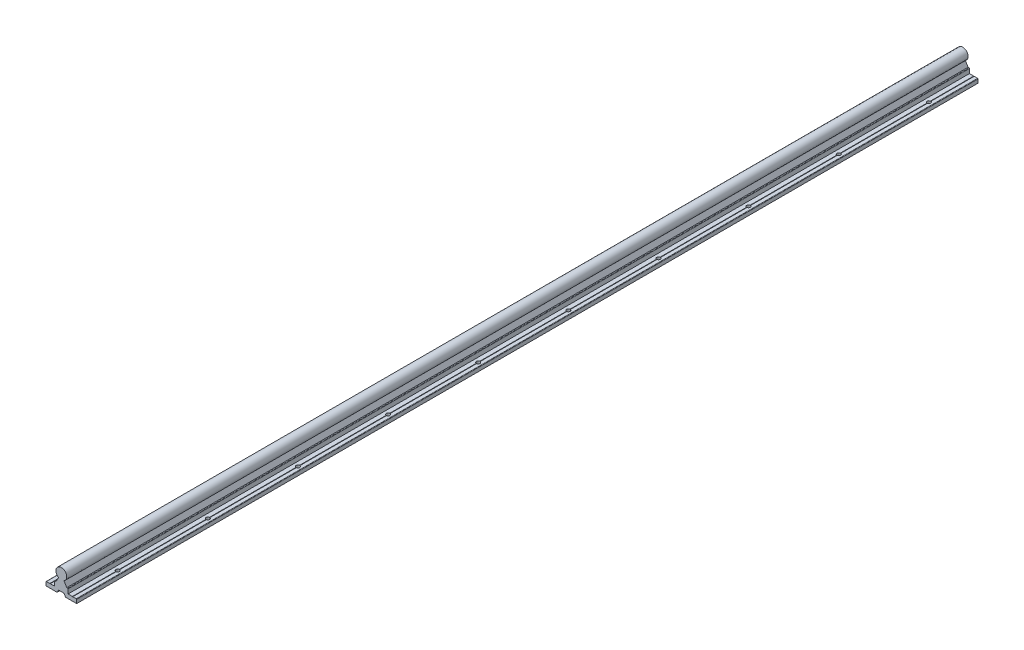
ISO-10303-21;
HEADER;
FILE_DESCRIPTION(('STEP AP214'),'2;1');
FILE_NAME('part.step','',(''),(''),'','','');
FILE_SCHEMA(('AUTOMOTIVE_DESIGN { 1 0 10303 214 1 1 1 1 }'));
ENDSEC;
DATA;
#1=APPLICATION_CONTEXT('core data for automotive mechanical design processes');
#2=APPLICATION_PROTOCOL_DEFINITION('international standard','automotive_design',2000,#1);
#3=PRODUCT_CONTEXT('',#1,'mechanical');
#4=PRODUCT('Part','Part','',(#3));
#5=PRODUCT_RELATED_PRODUCT_CATEGORY('part','',(#4));
#6=PRODUCT_DEFINITION_FORMATION('','',#4);
#7=PRODUCT_DEFINITION_CONTEXT('part definition',#1,'design');
#8=PRODUCT_DEFINITION('design','',#6,#7);
#9=PRODUCT_DEFINITION_SHAPE('','',#8);
#10=(LENGTH_UNIT() NAMED_UNIT(*) SI_UNIT(.MILLI.,.METRE.));
#11=(NAMED_UNIT(*) PLANE_ANGLE_UNIT() SI_UNIT($,.RADIAN.));
#12=(NAMED_UNIT(*) SI_UNIT($,.STERADIAN.) SOLID_ANGLE_UNIT());
#13=UNCERTAINTY_MEASURE_WITH_UNIT(LENGTH_MEASURE(1.E-05),#10,'distance_accuracy_value','');
#14=(GEOMETRIC_REPRESENTATION_CONTEXT(3) GLOBAL_UNCERTAINTY_ASSIGNED_CONTEXT((#13)) GLOBAL_UNIT_ASSIGNED_CONTEXT((#10,
#11,#12)) REPRESENTATION_CONTEXT('',''));
#15=CARTESIAN_POINT('',(0.,0.,0.));
#16=DIRECTION('',(0.,0.,1.));
#17=DIRECTION('',(1.,0.,0.));
#18=AXIS2_PLACEMENT_3D('',#15,#16,#17);
#19=CARTESIAN_POINT('',(-12.5,-15.9461524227,0.));
#20=DIRECTION('',(0.70710678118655,-0.707106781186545,0.));
#21=DIRECTION('',(0.707106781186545,0.70710678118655,0.));
#22=AXIS2_PLACEMENT_3D('',#19,#20,#21);
#23=PLANE('',#22);
#24=DIRECTION('',(0.,0.,1.));
#25=VECTOR('',#24,1.);
#26=CARTESIAN_POINT('',(-12.25,-15.6961524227,0.));
#27=LINE('',#26,#25);
#28=CARTESIAN_POINT('',(-12.25,-15.6961524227,951.984313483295));
#29=VERTEX_POINT('',#28);
#30=CARTESIAN_POINT('',(-12.25,-15.6961524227,1000.));
#31=VERTEX_POINT('',#30);
#32=EDGE_CURVE('E792',#29,#31,#27,.T.);
#33=ORIENTED_EDGE('',*,*,#32,.F.);
#34=CARTESIAN_POINT('',(-12.5,-15.9461524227,949.999999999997));
#35=DIRECTION('',(0.70710678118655,-0.707106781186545,0.));
#36=DIRECTION('',(0.707106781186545,0.70710678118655,0.));
#37=AXIS2_PLACEMENT_3D('',#34,#35,#36);
#38=ELLIPSE('',#37,2.8284271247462,2.);
#39=CARTESIAN_POINT('',(-12.5,-15.9461524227,951.999999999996));
#40=VERTEX_POINT('',#39);
#41=EDGE_CURVE('E777',#29,#40,#38,.T.);
#42=ORIENTED_EDGE('',*,*,#41,.T.);
#43=DIRECTION('',(0.,0.,1.));
#44=VECTOR('',#43,1.);
#45=CARTESIAN_POINT('',(-12.5,-15.9461524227,0.));
#46=LINE('',#45,#44);
#47=CARTESIAN_POINT('',(-12.5,-15.9461524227,1000.));
#48=VERTEX_POINT('',#47);
#49=EDGE_CURVE('E1204',#40,#48,#46,.T.);
#50=ORIENTED_EDGE('',*,*,#49,.T.);
#51=DIRECTION('',(0.707106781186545,0.70710678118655,0.));
#52=VECTOR('',#51,1.);
#53=CARTESIAN_POINT('',(-12.5,-15.9461524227,1000.));
#54=LINE('',#53,#52);
#55=EDGE_CURVE('E801',#48,#31,#54,.T.);
#56=ORIENTED_EDGE('',*,*,#55,.T.);
#57=EDGE_LOOP('',(#33,#42,#50,#56));
#58=FACE_BOUND('',#57,.T.);
#59=ADVANCED_FACE('F53',(#58),#23,.F.);
#60=CARTESIAN_POINT('',(-12.25,-20.1961524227,600.));
#61=DIRECTION('',(0.70710678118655,0.707106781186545,0.));
#62=DIRECTION('',(-0.707106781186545,0.70710678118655,0.));
#63=AXIS2_PLACEMENT_3D('',#60,#61,#62);
#64=PLANE('',#63);
#65=DIRECTION('',(0.,0.,1.));
#66=VECTOR('',#65,1.);
#67=CARTESIAN_POINT('',(-12.5,-19.9461524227,600.));
#68=LINE('',#67,#66);
#69=CARTESIAN_POINT('',(-12.5,-19.9461524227,951.999999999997));
#70=VERTEX_POINT('',#69);
#71=CARTESIAN_POINT('',(-12.5,-19.9461524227,1000.));
#72=VERTEX_POINT('',#71);
#73=EDGE_CURVE('E1745',#70,#72,#68,.T.);
#74=ORIENTED_EDGE('',*,*,#73,.F.);
#75=CARTESIAN_POINT('',(-12.5,-19.9461524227,949.999999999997));
#76=DIRECTION('',(0.70710678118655,0.707106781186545,0.));
#77=DIRECTION('',(-0.707106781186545,0.70710678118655,0.));
#78=AXIS2_PLACEMENT_3D('',#75,#76,#77);
#79=ELLIPSE('',#78,2.8284271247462,2.);
#80=CARTESIAN_POINT('',(-12.25,-20.1961524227,951.984313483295));
#81=VERTEX_POINT('',#80);
#82=EDGE_CURVE('E69',#70,#81,#79,.T.);
#83=ORIENTED_EDGE('',*,*,#82,.T.);
#84=DIRECTION('',(0.,0.,1.));
#85=VECTOR('',#84,1.);
#86=CARTESIAN_POINT('',(-12.25,-20.1961524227,600.));
#87=LINE('',#86,#85);
#88=CARTESIAN_POINT('',(-12.25,-20.1961524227,1000.));
#89=VERTEX_POINT('',#88);
#90=EDGE_CURVE('E1332',#81,#89,#87,.T.);
#91=ORIENTED_EDGE('',*,*,#90,.T.);
#92=DIRECTION('',(-0.707106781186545,0.70710678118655,0.));
#93=VECTOR('',#92,1.);
#94=CARTESIAN_POINT('',(-12.25,-20.1961524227,1000.));
#95=LINE('',#94,#93);
#96=EDGE_CURVE('E1774',#89,#72,#95,.T.);
#97=ORIENTED_EDGE('',*,*,#96,.T.);
#98=EDGE_LOOP('',(#74,#83,#91,#97));
#99=FACE_BOUND('',#98,.T.);
#100=ADVANCED_FACE('F2060',(#99),#64,.F.);
#101=CARTESIAN_POINT('',(-12.5,-19.9461524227,600.));
#102=DIRECTION('',(-0.707106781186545,0.70710678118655,0.));
#103=DIRECTION('',(-0.70710678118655,-0.707106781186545,0.));
#104=AXIS2_PLACEMENT_3D('',#101,#102,#103);
#105=PLANE('',#104);
#106=CARTESIAN_POINT('',(-12.5,-19.9461524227,851.999999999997));
#107=VERTEX_POINT('',#106);
#108=CARTESIAN_POINT('',(-12.5,-19.9461524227,947.999999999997));
#109=VERTEX_POINT('',#108);
#110=EDGE_CURVE('E1312',#107,#109,#68,.T.);
#111=ORIENTED_EDGE('',*,*,#110,.T.);
#112=CARTESIAN_POINT('',(-12.5,-19.9461524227,949.999999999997));
#113=DIRECTION('',(-0.707106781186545,0.70710678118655,0.));
#114=DIRECTION('',(0.70710678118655,0.707106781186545,0.));
#115=AXIS2_PLACEMENT_3D('',#112,#113,#114);
#116=ELLIPSE('',#115,2.82842712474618,2.);
#117=CARTESIAN_POINT('',(-12.75,-20.1961524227,948.015686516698));
#118=VERTEX_POINT('',#117);
#119=EDGE_CURVE('E1291',#109,#118,#116,.T.);
#120=ORIENTED_EDGE('',*,*,#119,.T.);
#121=DIRECTION('',(0.,0.,1.));
#122=VECTOR('',#121,1.);
#123=CARTESIAN_POINT('',(-12.75,-20.1961524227,600.));
#124=LINE('',#123,#122);
#125=CARTESIAN_POINT('',(-12.75,-20.1961524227,851.984313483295));
#126=VERTEX_POINT('',#125);
#127=EDGE_CURVE('E1311',#126,#118,#124,.T.);
#128=ORIENTED_EDGE('',*,*,#127,.F.);
#129=CARTESIAN_POINT('',(-12.4999999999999,-19.9461524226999,849.999999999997));
#130=DIRECTION('',(-0.707106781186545,0.70710678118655,0.));
#131=DIRECTION('',(0.70710678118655,0.707106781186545,0.));
#132=AXIS2_PLACEMENT_3D('',#129,#130,#131);
#133=ELLIPSE('',#132,2.82842712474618,2.);
#134=EDGE_CURVE('E875',#126,#107,#133,.T.);
#135=ORIENTED_EDGE('',*,*,#134,.T.);
#136=EDGE_LOOP('',(#111,#120,#128,#135));
#137=FACE_BOUND('',#136,.T.);
#138=ADVANCED_FACE('F1310',(#137),#105,.F.);
#139=CARTESIAN_POINT('',(-12.75,-15.6961524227,0.));
#140=DIRECTION('',(-0.70710678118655,-0.707106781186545,0.));
#141=DIRECTION('',(0.707106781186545,-0.70710678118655,0.));
#142=AXIS2_PLACEMENT_3D('',#139,#140,#141);
#143=PLANE('',#142);
#144=DIRECTION('',(0.,0.,1.));
#145=VECTOR('',#144,1.);
#146=CARTESIAN_POINT('',(-12.75,-15.6961524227,0.));
#147=LINE('',#146,#145);
#148=CARTESIAN_POINT('',(-12.75,-15.6961524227,851.984313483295));
#149=VERTEX_POINT('',#148);
#150=CARTESIAN_POINT('',(-12.75,-15.6961524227,948.015686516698));
#151=VERTEX_POINT('',#150);
#152=EDGE_CURVE('E823',#149,#151,#147,.T.);
#153=ORIENTED_EDGE('',*,*,#152,.T.);
#154=CARTESIAN_POINT('',(-12.5,-15.9461524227,949.999999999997));
#155=DIRECTION('',(-0.70710678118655,-0.707106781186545,0.));
#156=DIRECTION('',(-0.707106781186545,0.70710678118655,0.));
#157=AXIS2_PLACEMENT_3D('',#154,#155,#156);
#158=ELLIPSE('',#157,2.8284271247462,2.);
#159=CARTESIAN_POINT('',(-12.5,-15.9461524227,947.999999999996));
#160=VERTEX_POINT('',#159);
#161=EDGE_CURVE('E12',#151,#160,#158,.T.);
#162=ORIENTED_EDGE('',*,*,#161,.T.);
#163=CARTESIAN_POINT('',(-12.5,-15.9461524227,851.999999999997));
#164=VERTEX_POINT('',#163);
#165=EDGE_CURVE('E1214',#164,#160,#46,.T.);
#166=ORIENTED_EDGE('',*,*,#165,.F.);
#167=CARTESIAN_POINT('',(-12.4999999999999,-15.9461524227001,849.999999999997));
#168=DIRECTION('',(-0.70710678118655,-0.707106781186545,0.));
#169=DIRECTION('',(-0.707106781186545,0.70710678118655,0.));
#170=AXIS2_PLACEMENT_3D('',#167,#168,#169);
#171=ELLIPSE('',#170,2.8284271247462,2.);
#172=EDGE_CURVE('E1276',#164,#149,#171,.T.);
#173=ORIENTED_EDGE('',*,*,#172,.T.);
#174=EDGE_LOOP('',(#153,#162,#166,#173));
#175=FACE_BOUND('',#174,.T.);
#176=ADVANCED_FACE('F1273',(#175),#143,.F.);
#177=ORIENTED_EDGE('',*,*,#165,.T.);
#178=CARTESIAN_POINT('',(-12.25,-15.6961524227,948.015686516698));
#179=VERTEX_POINT('',#178);
#180=EDGE_CURVE('E786',#160,#179,#38,.T.);
#181=ORIENTED_EDGE('',*,*,#180,.T.);
#182=CARTESIAN_POINT('',(-12.25,-15.6961524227,851.984313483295));
#183=VERTEX_POINT('',#182);
#184=EDGE_CURVE('E796',#183,#179,#27,.T.);
#185=ORIENTED_EDGE('',*,*,#184,.F.);
#186=CARTESIAN_POINT('',(-12.4999999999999,-15.9461524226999,849.999999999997));
#187=DIRECTION('',(0.70710678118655,-0.707106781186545,0.));
#188=DIRECTION('',(0.707106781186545,0.70710678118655,0.));
#189=AXIS2_PLACEMENT_3D('',#186,#187,#188);
#190=ELLIPSE('',#189,2.8284271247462,2.);
#191=EDGE_CURVE('E876',#183,#164,#190,.T.);
#192=ORIENTED_EDGE('',*,*,#191,.T.);
#193=EDGE_LOOP('',(#177,#181,#185,#192));
#194=FACE_BOUND('',#193,.T.);
#195=ADVANCED_FACE('F1720',(#194),#23,.F.);
#196=CARTESIAN_POINT('',(-12.25,-20.1961524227,851.984313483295));
#197=VERTEX_POINT('',#196);
#198=CARTESIAN_POINT('',(-12.25,-20.1961524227,948.015686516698));
#199=VERTEX_POINT('',#198);
#200=EDGE_CURVE('E1733',#197,#199,#87,.T.);
#201=ORIENTED_EDGE('',*,*,#200,.T.);
#202=EDGE_CURVE('E1293',#199,#109,#79,.T.);
#203=ORIENTED_EDGE('',*,*,#202,.T.);
#204=ORIENTED_EDGE('',*,*,#110,.F.);
#205=CARTESIAN_POINT('',(-12.4999999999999,-19.9461524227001,849.999999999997));
#206=DIRECTION('',(0.70710678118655,0.707106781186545,0.));
#207=DIRECTION('',(-0.707106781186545,0.70710678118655,0.));
#208=AXIS2_PLACEMENT_3D('',#205,#206,#207);
#209=ELLIPSE('',#208,2.8284271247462,2.);
#210=EDGE_CURVE('E881',#107,#197,#209,.T.);
#211=ORIENTED_EDGE('',*,*,#210,.T.);
#212=EDGE_LOOP('',(#201,#203,#204,#211));
#213=FACE_BOUND('',#212,.T.);
#214=ADVANCED_FACE('F1732',(#213),#64,.F.);
#215=CARTESIAN_POINT('',(-12.5,-19.9461524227,751.999999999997));
#216=VERTEX_POINT('',#215);
#217=CARTESIAN_POINT('',(-12.5,-19.9461524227,847.999999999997));
#218=VERTEX_POINT('',#217);
#219=EDGE_CURVE('E1764',#216,#218,#68,.T.);
#220=ORIENTED_EDGE('',*,*,#219,.T.);
#221=CARTESIAN_POINT('',(-12.75,-20.1961524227,848.015686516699));
#222=VERTEX_POINT('',#221);
#223=EDGE_CURVE('E883',#218,#222,#133,.T.);
#224=ORIENTED_EDGE('',*,*,#223,.T.);
#225=CARTESIAN_POINT('',(-12.75,-20.1961524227,751.984313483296));
#226=VERTEX_POINT('',#225);
#227=EDGE_CURVE('E1320',#226,#222,#124,.T.);
#228=ORIENTED_EDGE('',*,*,#227,.F.);
#229=CARTESIAN_POINT('',(-12.5,-19.9461524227,749.999999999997));
#230=DIRECTION('',(-0.707106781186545,0.70710678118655,0.));
#231=DIRECTION('',(0.70710678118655,0.707106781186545,0.));
#232=AXIS2_PLACEMENT_3D('',#229,#230,#231);
#233=ELLIPSE('',#232,2.82842712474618,2.);
#234=EDGE_CURVE('E904',#226,#216,#233,.T.);
#235=ORIENTED_EDGE('',*,*,#234,.T.);
#236=EDGE_LOOP('',(#220,#224,#228,#235));
#237=FACE_BOUND('',#236,.T.);
#238=ADVANCED_FACE('F2071',(#237),#105,.F.);
#239=CARTESIAN_POINT('',(-12.75,-15.6961524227,751.984313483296));
#240=VERTEX_POINT('',#239);
#241=CARTESIAN_POINT('',(-12.75,-15.6961524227,848.015686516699));
#242=VERTEX_POINT('',#241);
#243=EDGE_CURVE('E1258',#240,#242,#147,.T.);
#244=ORIENTED_EDGE('',*,*,#243,.T.);
#245=CARTESIAN_POINT('',(-12.5,-15.9461524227,847.999999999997));
#246=VERTEX_POINT('',#245);
#247=EDGE_CURVE('E1700',#242,#246,#171,.T.);
#248=ORIENTED_EDGE('',*,*,#247,.T.);
#249=CARTESIAN_POINT('',(-12.5,-15.9461524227,751.999999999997));
#250=VERTEX_POINT('',#249);
#251=EDGE_CURVE('E871',#250,#246,#46,.T.);
#252=ORIENTED_EDGE('',*,*,#251,.F.);
#253=CARTESIAN_POINT('',(-12.5,-15.9461524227,749.999999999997));
#254=DIRECTION('',(-0.70710678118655,-0.707106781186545,0.));
#255=DIRECTION('',(-0.707106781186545,0.70710678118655,0.));
#256=AXIS2_PLACEMENT_3D('',#253,#254,#255);
#257=ELLIPSE('',#256,2.8284271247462,2.);
#258=EDGE_CURVE('E1696',#250,#240,#257,.T.);
#259=ORIENTED_EDGE('',*,*,#258,.T.);
#260=EDGE_LOOP('',(#244,#248,#252,#259));
#261=FACE_BOUND('',#260,.T.);
#262=ADVANCED_FACE('F2055',(#261),#143,.F.);
#263=ORIENTED_EDGE('',*,*,#251,.T.);
#264=CARTESIAN_POINT('',(-12.25,-15.6961524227,848.015686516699));
#265=VERTEX_POINT('',#264);
#266=EDGE_CURVE('E870',#246,#265,#190,.T.);
#267=ORIENTED_EDGE('',*,*,#266,.T.);
#268=CARTESIAN_POINT('',(-12.25,-15.6961524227,751.984313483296));
#269=VERTEX_POINT('',#268);
#270=EDGE_CURVE('E809',#269,#265,#27,.T.);
#271=ORIENTED_EDGE('',*,*,#270,.F.);
#272=CARTESIAN_POINT('',(-12.5,-15.9461524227,749.999999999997));
#273=DIRECTION('',(0.70710678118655,-0.707106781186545,0.));
#274=DIRECTION('',(0.707106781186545,0.70710678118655,0.));
#275=AXIS2_PLACEMENT_3D('',#272,#273,#274);
#276=ELLIPSE('',#275,2.8284271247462,2.);
#277=EDGE_CURVE('E868',#269,#250,#276,.T.);
#278=ORIENTED_EDGE('',*,*,#277,.T.);
#279=EDGE_LOOP('',(#263,#267,#271,#278));
#280=FACE_BOUND('',#279,.T.);
#281=ADVANCED_FACE('F867',(#280),#23,.F.);
#282=CARTESIAN_POINT('',(-12.25,-20.1961524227,751.984313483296));
#283=VERTEX_POINT('',#282);
#284=CARTESIAN_POINT('',(-12.25,-20.1961524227,848.015686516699));
#285=VERTEX_POINT('',#284);
#286=EDGE_CURVE('E1736',#283,#285,#87,.T.);
#287=ORIENTED_EDGE('',*,*,#286,.T.);
#288=EDGE_CURVE('E892',#285,#218,#209,.T.);
#289=ORIENTED_EDGE('',*,*,#288,.T.);
#290=ORIENTED_EDGE('',*,*,#219,.F.);
#291=CARTESIAN_POINT('',(-12.5,-19.9461524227,749.999999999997));
#292=DIRECTION('',(0.70710678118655,0.707106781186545,0.));
#293=DIRECTION('',(-0.707106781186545,0.70710678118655,0.));
#294=AXIS2_PLACEMENT_3D('',#291,#292,#293);
#295=ELLIPSE('',#294,2.8284271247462,2.);
#296=EDGE_CURVE('E908',#216,#283,#295,.T.);
#297=ORIENTED_EDGE('',*,*,#296,.T.);
#298=EDGE_LOOP('',(#287,#289,#290,#297));
#299=FACE_BOUND('',#298,.T.);
#300=ADVANCED_FACE('F1762',(#299),#64,.F.);
#301=CARTESIAN_POINT('',(-12.5,-19.9461524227,651.999999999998));
#302=VERTEX_POINT('',#301);
#303=CARTESIAN_POINT('',(-12.5,-19.9461524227,747.999999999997));
#304=VERTEX_POINT('',#303);
#305=EDGE_CURVE('E1768',#302,#304,#68,.T.);
#306=ORIENTED_EDGE('',*,*,#305,.T.);
#307=CARTESIAN_POINT('',(-12.75,-20.1961524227,748.015686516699));
#308=VERTEX_POINT('',#307);
#309=EDGE_CURVE('E909',#304,#308,#233,.T.);
#310=ORIENTED_EDGE('',*,*,#309,.T.);
#311=CARTESIAN_POINT('',(-12.75,-20.1961524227,651.984313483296));
#312=VERTEX_POINT('',#311);
#313=EDGE_CURVE('E1325',#312,#308,#124,.T.);
#314=ORIENTED_EDGE('',*,*,#313,.F.);
#315=CARTESIAN_POINT('',(-12.4999999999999,-19.9461524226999,649.999999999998));
#316=DIRECTION('',(-0.707106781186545,0.70710678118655,0.));
#317=DIRECTION('',(0.70710678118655,0.707106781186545,0.));
#318=AXIS2_PLACEMENT_3D('',#315,#316,#317);
#319=ELLIPSE('',#318,2.82842712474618,2.);
#320=EDGE_CURVE('E937',#312,#302,#319,.T.);
#321=ORIENTED_EDGE('',*,*,#320,.T.);
#322=EDGE_LOOP('',(#306,#310,#314,#321));
#323=FACE_BOUND('',#322,.T.);
#324=ADVANCED_FACE('F2077',(#323),#105,.F.);
#325=CARTESIAN_POINT('',(-12.75,-15.6961524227,651.984313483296));
#326=VERTEX_POINT('',#325);
#327=CARTESIAN_POINT('',(-12.75,-15.6961524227,748.015686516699));
#328=VERTEX_POINT('',#327);
#329=EDGE_CURVE('E1251',#326,#328,#147,.T.);
#330=ORIENTED_EDGE('',*,*,#329,.T.);
#331=CARTESIAN_POINT('',(-12.5,-15.9461524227,747.999999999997));
#332=VERTEX_POINT('',#331);
#333=EDGE_CURVE('E1698',#328,#332,#257,.T.);
#334=ORIENTED_EDGE('',*,*,#333,.T.);
#335=CARTESIAN_POINT('',(-12.5,-15.9461524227,651.999999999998));
#336=VERTEX_POINT('',#335);
#337=EDGE_CURVE('E1706',#336,#332,#46,.T.);
#338=ORIENTED_EDGE('',*,*,#337,.F.);
#339=CARTESIAN_POINT('',(-12.4999999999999,-15.9461524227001,649.999999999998));
#340=DIRECTION('',(-0.70710678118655,-0.707106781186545,0.));
#341=DIRECTION('',(-0.707106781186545,0.70710678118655,0.));
#342=AXIS2_PLACEMENT_3D('',#339,#340,#341);
#343=ELLIPSE('',#342,2.8284271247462,2.);
#344=EDGE_CURVE('E1692',#336,#326,#343,.T.);
#345=ORIENTED_EDGE('',*,*,#344,.T.);
#346=EDGE_LOOP('',(#330,#334,#338,#345));
#347=FACE_BOUND('',#346,.T.);
#348=ADVANCED_FACE('F1705',(#347),#143,.F.);
#349=ORIENTED_EDGE('',*,*,#337,.T.);
#350=CARTESIAN_POINT('',(-12.25,-15.6961524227,748.015686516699));
#351=VERTEX_POINT('',#350);
#352=EDGE_CURVE('E903',#332,#351,#276,.T.);
#353=ORIENTED_EDGE('',*,*,#352,.T.);
#354=CARTESIAN_POINT('',(-12.25,-15.6961524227,651.984313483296));
#355=VERTEX_POINT('',#354);
#356=EDGE_CURVE('E851',#355,#351,#27,.T.);
#357=ORIENTED_EDGE('',*,*,#356,.F.);
#358=CARTESIAN_POINT('',(-12.4999999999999,-15.9461524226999,649.999999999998));
#359=DIRECTION('',(0.70710678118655,-0.707106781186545,0.));
#360=DIRECTION('',(0.707106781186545,0.70710678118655,0.));
#361=AXIS2_PLACEMENT_3D('',#358,#359,#360);
#362=ELLIPSE('',#361,2.8284271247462,2.);
#363=EDGE_CURVE('E923',#355,#336,#362,.T.);
#364=ORIENTED_EDGE('',*,*,#363,.T.);
#365=EDGE_LOOP('',(#349,#353,#357,#364));
#366=FACE_BOUND('',#365,.T.);
#367=ADVANCED_FACE('F1711',(#366),#23,.F.);
#368=CARTESIAN_POINT('',(-12.5,-19.9461524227,600.));
#369=VERTEX_POINT('',#368);
#370=CARTESIAN_POINT('',(-12.5,-19.9461524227,647.999999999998));
#371=VERTEX_POINT('',#370);
#372=EDGE_CURVE('E1352',#369,#371,#68,.T.);
#373=ORIENTED_EDGE('',*,*,#372,.T.);
#374=CARTESIAN_POINT('',(-12.75,-20.1961524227,648.015686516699));
#375=VERTEX_POINT('',#374);
#376=EDGE_CURVE('E932',#371,#375,#319,.T.);
#377=ORIENTED_EDGE('',*,*,#376,.T.);
#378=CARTESIAN_POINT('',(-12.75,-20.1961524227,600.));
#379=VERTEX_POINT('',#378);
#380=EDGE_CURVE('E1327',#379,#375,#124,.T.);
#381=ORIENTED_EDGE('',*,*,#380,.F.);
#382=DIRECTION('',(-0.70710678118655,-0.707106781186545,0.));
#383=VECTOR('',#382,1.);
#384=CARTESIAN_POINT('',(-12.5,-19.9461524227,600.));
#385=LINE('',#384,#383);
#386=EDGE_CURVE('E1777',#369,#379,#385,.T.);
#387=ORIENTED_EDGE('',*,*,#386,.F.);
#388=EDGE_LOOP('',(#373,#377,#381,#387));
#389=FACE_BOUND('',#388,.T.);
#390=ADVANCED_FACE('F2079',(#389),#105,.F.);
#391=CARTESIAN_POINT('',(-12.25,-20.1961524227,651.984313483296));
#392=VERTEX_POINT('',#391);
#393=CARTESIAN_POINT('',(-12.25,-20.1961524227,748.015686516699));
#394=VERTEX_POINT('',#393);
#395=EDGE_CURVE('E1739',#392,#394,#87,.T.);
#396=ORIENTED_EDGE('',*,*,#395,.T.);
#397=EDGE_CURVE('E913',#394,#304,#295,.T.);
#398=ORIENTED_EDGE('',*,*,#397,.T.);
#399=ORIENTED_EDGE('',*,*,#305,.F.);
#400=CARTESIAN_POINT('',(-12.4999999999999,-19.9461524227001,649.999999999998));
#401=DIRECTION('',(0.70710678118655,0.707106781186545,0.));
#402=DIRECTION('',(-0.707106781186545,0.70710678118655,0.));
#403=AXIS2_PLACEMENT_3D('',#400,#401,#402);
#404=ELLIPSE('',#403,2.8284271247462,2.);
#405=EDGE_CURVE('E933',#302,#392,#404,.T.);
#406=ORIENTED_EDGE('',*,*,#405,.T.);
#407=EDGE_LOOP('',(#396,#398,#399,#406));
#408=FACE_BOUND('',#407,.T.);
#409=ADVANCED_FACE('F1756',(#408),#64,.F.);
#410=CARTESIAN_POINT('',(-12.75,-15.6961524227,551.984313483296));
#411=VERTEX_POINT('',#410);
#412=CARTESIAN_POINT('',(-12.75,-15.6961524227,648.015686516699));
#413=VERTEX_POINT('',#412);
#414=EDGE_CURVE('E1244',#411,#413,#147,.T.);
#415=ORIENTED_EDGE('',*,*,#414,.T.);
#416=CARTESIAN_POINT('',(-12.5,-15.9461524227,647.999999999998));
#417=VERTEX_POINT('',#416);
#418=EDGE_CURVE('E1695',#413,#417,#343,.T.);
#419=ORIENTED_EDGE('',*,*,#418,.T.);
#420=CARTESIAN_POINT('',(-12.5,-15.9461524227,551.999999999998));
#421=VERTEX_POINT('',#420);
#422=EDGE_CURVE('E1713',#421,#417,#46,.T.);
#423=ORIENTED_EDGE('',*,*,#422,.F.);
#424=CARTESIAN_POINT('',(-12.5,-15.9461524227,549.999999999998));
#425=DIRECTION('',(-0.70710678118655,-0.707106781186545,0.));
#426=DIRECTION('',(-0.707106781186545,0.70710678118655,0.));
#427=AXIS2_PLACEMENT_3D('',#424,#425,#426);
#428=ELLIPSE('',#427,2.8284271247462,2.);
#429=EDGE_CURVE('E1688',#421,#411,#428,.T.);
#430=ORIENTED_EDGE('',*,*,#429,.T.);
#431=EDGE_LOOP('',(#415,#419,#423,#430));
#432=FACE_BOUND('',#431,.T.);
#433=ADVANCED_FACE('F2088',(#432),#143,.F.);
#434=ORIENTED_EDGE('',*,*,#422,.T.);
#435=CARTESIAN_POINT('',(-12.25,-15.6961524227,648.015686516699));
#436=VERTEX_POINT('',#435);
#437=EDGE_CURVE('E927',#417,#436,#362,.T.);
#438=ORIENTED_EDGE('',*,*,#437,.T.);
#439=CARTESIAN_POINT('',(-12.25,-15.6961524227,551.984313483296));
#440=VERTEX_POINT('',#439);
#441=EDGE_CURVE('E846',#440,#436,#27,.T.);
#442=ORIENTED_EDGE('',*,*,#441,.F.);
#443=CARTESIAN_POINT('',(-12.5,-15.9461524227,549.999999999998));
#444=DIRECTION('',(0.70710678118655,-0.707106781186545,0.));
#445=DIRECTION('',(0.707106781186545,0.70710678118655,0.));
#446=AXIS2_PLACEMENT_3D('',#443,#444,#445);
#447=ELLIPSE('',#446,2.8284271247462,2.);
#448=EDGE_CURVE('E946',#440,#421,#447,.T.);
#449=ORIENTED_EDGE('',*,*,#448,.T.);
#450=EDGE_LOOP('',(#434,#438,#442,#449));
#451=FACE_BOUND('',#450,.T.);
#452=ADVANCED_FACE('F2080',(#451),#23,.F.);
#453=CARTESIAN_POINT('',(-12.75,-15.6961524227,451.984313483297));
#454=VERTEX_POINT('',#453);
#455=CARTESIAN_POINT('',(-12.75,-15.6961524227,548.0156865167));
#456=VERTEX_POINT('',#455);
#457=EDGE_CURVE('E1237',#454,#456,#147,.T.);
#458=ORIENTED_EDGE('',*,*,#457,.T.);
#459=CARTESIAN_POINT('',(-12.5,-15.9461524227,547.999999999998));
#460=VERTEX_POINT('',#459);
#461=EDGE_CURVE('E1691',#456,#460,#428,.T.);
#462=ORIENTED_EDGE('',*,*,#461,.T.);
#463=CARTESIAN_POINT('',(-12.5,-15.9461524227,451.999999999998));
#464=VERTEX_POINT('',#463);
#465=EDGE_CURVE('E1717',#464,#460,#46,.T.);
#466=ORIENTED_EDGE('',*,*,#465,.F.);
#467=CARTESIAN_POINT('',(-12.4999999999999,-15.9461524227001,449.999999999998));
#468=DIRECTION('',(-0.70710678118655,-0.707106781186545,0.));
#469=DIRECTION('',(-0.707106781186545,0.70710678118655,0.));
#470=AXIS2_PLACEMENT_3D('',#467,#468,#469);
#471=ELLIPSE('',#470,2.8284271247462,2.);
#472=EDGE_CURVE('E1684',#464,#454,#471,.T.);
#473=ORIENTED_EDGE('',*,*,#472,.T.);
#474=EDGE_LOOP('',(#458,#462,#466,#473));
#475=FACE_BOUND('',#474,.T.);
#476=ADVANCED_FACE('F1839',(#475),#143,.F.);
#477=ORIENTED_EDGE('',*,*,#465,.T.);
#478=CARTESIAN_POINT('',(-12.25,-15.6961524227,548.0156865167));
#479=VERTEX_POINT('',#478);
#480=EDGE_CURVE('E950',#460,#479,#447,.T.);
#481=ORIENTED_EDGE('',*,*,#480,.T.);
#482=CARTESIAN_POINT('',(-12.25,-15.6961524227,451.984313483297));
#483=VERTEX_POINT('',#482);
#484=EDGE_CURVE('E841',#483,#479,#27,.T.);
#485=ORIENTED_EDGE('',*,*,#484,.F.);
#486=CARTESIAN_POINT('',(-12.4999999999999,-15.9461524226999,449.999999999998));
#487=DIRECTION('',(0.70710678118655,-0.707106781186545,0.));
#488=DIRECTION('',(0.707106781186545,0.70710678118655,0.));
#489=AXIS2_PLACEMENT_3D('',#486,#487,#488);
#490=ELLIPSE('',#489,2.8284271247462,2.);
#491=EDGE_CURVE('E959',#483,#464,#490,.T.);
#492=ORIENTED_EDGE('',*,*,#491,.T.);
#493=EDGE_LOOP('',(#477,#481,#485,#492));
#494=FACE_BOUND('',#493,.T.);
#495=ADVANCED_FACE('F1838',(#494),#23,.F.);
#496=CARTESIAN_POINT('',(-12.75,-15.6961524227,351.984313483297));
#497=VERTEX_POINT('',#496);
#498=CARTESIAN_POINT('',(-12.75,-15.6961524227,448.0156865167));
#499=VERTEX_POINT('',#498);
#500=EDGE_CURVE('E1230',#497,#499,#147,.T.);
#501=ORIENTED_EDGE('',*,*,#500,.T.);
#502=CARTESIAN_POINT('',(-12.5,-15.9461524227,447.999999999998));
#503=VERTEX_POINT('',#502);
#504=EDGE_CURVE('E1687',#499,#503,#471,.T.);
#505=ORIENTED_EDGE('',*,*,#504,.T.);
#506=CARTESIAN_POINT('',(-12.5,-15.9461524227,351.999999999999));
#507=VERTEX_POINT('',#506);
#508=EDGE_CURVE('E1831',#507,#503,#46,.T.);
#509=ORIENTED_EDGE('',*,*,#508,.F.);
#510=CARTESIAN_POINT('',(-12.5,-15.9461524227,349.999999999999));
#511=DIRECTION('',(-0.70710678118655,-0.707106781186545,0.));
#512=DIRECTION('',(-0.707106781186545,0.70710678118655,0.));
#513=AXIS2_PLACEMENT_3D('',#510,#511,#512);
#514=ELLIPSE('',#513,2.8284271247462,2.);
#515=EDGE_CURVE('E1680',#507,#497,#514,.T.);
#516=ORIENTED_EDGE('',*,*,#515,.T.);
#517=EDGE_LOOP('',(#501,#505,#509,#516));
#518=FACE_BOUND('',#517,.T.);
#519=ADVANCED_FACE('F2095',(#518),#143,.F.);
#520=ORIENTED_EDGE('',*,*,#508,.T.);
#521=CARTESIAN_POINT('',(-12.25,-15.6961524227,448.0156865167));
#522=VERTEX_POINT('',#521);
#523=EDGE_CURVE('E963',#503,#522,#490,.T.);
#524=ORIENTED_EDGE('',*,*,#523,.T.);
#525=CARTESIAN_POINT('',(-12.25,-15.6961524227,351.984313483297));
#526=VERTEX_POINT('',#525);
#527=EDGE_CURVE('E836',#526,#522,#27,.T.);
#528=ORIENTED_EDGE('',*,*,#527,.F.);
#529=CARTESIAN_POINT('',(-12.5,-15.9461524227,349.999999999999));
#530=DIRECTION('',(0.70710678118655,-0.707106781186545,0.));
#531=DIRECTION('',(0.707106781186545,0.70710678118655,0.));
#532=AXIS2_PLACEMENT_3D('',#529,#530,#531);
#533=ELLIPSE('',#532,2.8284271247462,2.);
#534=EDGE_CURVE('E972',#526,#507,#533,.T.);
#535=ORIENTED_EDGE('',*,*,#534,.T.);
#536=EDGE_LOOP('',(#520,#524,#528,#535));
#537=FACE_BOUND('',#536,.T.);
#538=ADVANCED_FACE('F2097',(#537),#23,.F.);
#539=CARTESIAN_POINT('',(-12.75,-15.6961524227,251.984313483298));
#540=VERTEX_POINT('',#539);
#541=CARTESIAN_POINT('',(-12.75,-15.6961524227,348.0156865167));
#542=VERTEX_POINT('',#541);
#543=EDGE_CURVE('E1223',#540,#542,#147,.T.);
#544=ORIENTED_EDGE('',*,*,#543,.T.);
#545=CARTESIAN_POINT('',(-12.5,-15.9461524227,347.999999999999));
#546=VERTEX_POINT('',#545);
#547=EDGE_CURVE('E1683',#542,#546,#514,.T.);
#548=ORIENTED_EDGE('',*,*,#547,.T.);
#549=CARTESIAN_POINT('',(-12.5,-15.9461524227,251.999999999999));
#550=VERTEX_POINT('',#549);
#551=EDGE_CURVE('E1828',#550,#546,#46,.T.);
#552=ORIENTED_EDGE('',*,*,#551,.F.);
#553=CARTESIAN_POINT('',(-12.4999999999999,-15.9461524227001,249.999999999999));
#554=DIRECTION('',(-0.70710678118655,-0.707106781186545,0.));
#555=DIRECTION('',(-0.707106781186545,0.70710678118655,0.));
#556=AXIS2_PLACEMENT_3D('',#553,#554,#555);
#557=ELLIPSE('',#556,2.8284271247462,2.);
#558=EDGE_CURVE('E1676',#550,#540,#557,.T.);
#559=ORIENTED_EDGE('',*,*,#558,.T.);
#560=EDGE_LOOP('',(#544,#548,#552,#559));
#561=FACE_BOUND('',#560,.T.);
#562=ADVANCED_FACE('F2101',(#561),#143,.F.);
#563=ORIENTED_EDGE('',*,*,#551,.T.);
#564=CARTESIAN_POINT('',(-12.25,-15.6961524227,348.0156865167));
#565=VERTEX_POINT('',#564);
#566=EDGE_CURVE('E976',#546,#565,#533,.T.);
#567=ORIENTED_EDGE('',*,*,#566,.T.);
#568=CARTESIAN_POINT('',(-12.25,-15.6961524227,251.984313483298));
#569=VERTEX_POINT('',#568);
#570=EDGE_CURVE('E831',#569,#565,#27,.T.);
#571=ORIENTED_EDGE('',*,*,#570,.F.);
#572=CARTESIAN_POINT('',(-12.4999999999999,-15.9461524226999,249.999999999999));
#573=DIRECTION('',(0.70710678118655,-0.707106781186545,0.));
#574=DIRECTION('',(0.707106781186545,0.70710678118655,0.));
#575=AXIS2_PLACEMENT_3D('',#572,#573,#574);
#576=ELLIPSE('',#575,2.8284271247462,2.);
#577=EDGE_CURVE('E985',#569,#550,#576,.T.);
#578=ORIENTED_EDGE('',*,*,#577,.T.);
#579=EDGE_LOOP('',(#563,#567,#571,#578));
#580=FACE_BOUND('',#579,.T.);
#581=ADVANCED_FACE('F2104',(#580),#23,.F.);
#582=CARTESIAN_POINT('',(-12.75,-15.6961524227,151.984313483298));
#583=VERTEX_POINT('',#582);
#584=CARTESIAN_POINT('',(-12.75,-15.6961524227,248.015686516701));
#585=VERTEX_POINT('',#584);
#586=EDGE_CURVE('E1216',#583,#585,#147,.T.);
#587=ORIENTED_EDGE('',*,*,#586,.T.);
#588=CARTESIAN_POINT('',(-12.5,-15.9461524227,247.999999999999));
#589=VERTEX_POINT('',#588);
#590=EDGE_CURVE('E1679',#585,#589,#557,.T.);
#591=ORIENTED_EDGE('',*,*,#590,.T.);
#592=CARTESIAN_POINT('',(-12.5,-15.9461524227,152.));
#593=VERTEX_POINT('',#592);
#594=EDGE_CURVE('E1825',#593,#589,#46,.T.);
#595=ORIENTED_EDGE('',*,*,#594,.F.);
#596=CARTESIAN_POINT('',(-12.5,-15.9461524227,150.));
#597=DIRECTION('',(-0.70710678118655,-0.707106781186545,0.));
#598=DIRECTION('',(-0.707106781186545,0.70710678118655,0.));
#599=AXIS2_PLACEMENT_3D('',#596,#597,#598);
#600=ELLIPSE('',#599,2.8284271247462,2.);
#601=EDGE_CURVE('E1672',#593,#583,#600,.T.);
#602=ORIENTED_EDGE('',*,*,#601,.T.);
#603=EDGE_LOOP('',(#587,#591,#595,#602));
#604=FACE_BOUND('',#603,.T.);
#605=ADVANCED_FACE('F2108',(#604),#143,.F.);
#606=ORIENTED_EDGE('',*,*,#594,.T.);
#607=CARTESIAN_POINT('',(-12.25,-15.6961524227,248.015686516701));
#608=VERTEX_POINT('',#607);
#609=EDGE_CURVE('E989',#589,#608,#576,.T.);
#610=ORIENTED_EDGE('',*,*,#609,.T.);
#611=CARTESIAN_POINT('',(-12.25,-15.6961524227,151.984313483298));
#612=VERTEX_POINT('',#611);
#613=EDGE_CURVE('E826',#612,#608,#27,.T.);
#614=ORIENTED_EDGE('',*,*,#613,.F.);
#615=CARTESIAN_POINT('',(-12.5,-15.9461524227,150.));
#616=DIRECTION('',(0.70710678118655,-0.707106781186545,0.));
#617=DIRECTION('',(0.707106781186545,0.70710678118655,0.));
#618=AXIS2_PLACEMENT_3D('',#615,#616,#617);
#619=ELLIPSE('',#618,2.8284271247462,2.);
#620=EDGE_CURVE('E998',#612,#593,#619,.T.);
#621=ORIENTED_EDGE('',*,*,#620,.T.);
#622=EDGE_LOOP('',(#606,#610,#614,#621));
#623=FACE_BOUND('',#622,.T.);
#624=ADVANCED_FACE('F2111',(#623),#23,.F.);
#625=CARTESIAN_POINT('',(-12.75,-15.6961524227,51.9843134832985));
#626=VERTEX_POINT('',#625);
#627=CARTESIAN_POINT('',(-12.75,-15.6961524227,148.015686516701));
#628=VERTEX_POINT('',#627);
#629=EDGE_CURVE('E1207',#626,#628,#147,.T.);
#630=ORIENTED_EDGE('',*,*,#629,.T.);
#631=CARTESIAN_POINT('',(-12.5,-15.9461524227,148.));
#632=VERTEX_POINT('',#631);
#633=EDGE_CURVE('E1675',#628,#632,#600,.T.);
#634=ORIENTED_EDGE('',*,*,#633,.T.);
#635=CARTESIAN_POINT('',(-12.5,-15.9461524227,52.));
#636=VERTEX_POINT('',#635);
#637=EDGE_CURVE('E1203',#636,#632,#46,.T.);
#638=ORIENTED_EDGE('',*,*,#637,.F.);
#639=CARTESIAN_POINT('',(-12.5,-15.9461524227,50.));
#640=DIRECTION('',(-0.70710678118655,-0.707106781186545,0.));
#641=DIRECTION('',(-0.707106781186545,0.70710678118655,0.));
#642=AXIS2_PLACEMENT_3D('',#639,#640,#641);
#643=ELLIPSE('',#642,2.8284271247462,2.);
#644=EDGE_CURVE('E1545',#636,#626,#643,.T.);
#645=ORIENTED_EDGE('',*,*,#644,.T.);
#646=EDGE_LOOP('',(#630,#634,#638,#645));
#647=FACE_BOUND('',#646,.T.);
#648=ADVANCED_FACE('F2058',(#647),#143,.F.);
#649=CARTESIAN_POINT('',(12.5,-15.9461524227,0.));
#650=DIRECTION('',(0.707106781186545,-0.70710678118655,0.));
#651=DIRECTION('',(0.70710678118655,0.707106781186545,0.));
#652=AXIS2_PLACEMENT_3D('',#649,#650,#651);
#653=PLANE('',#652);
#654=DIRECTION('',(0.,0.,1.));
#655=VECTOR('',#654,1.);
#656=CARTESIAN_POINT('',(12.75,-15.6961524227,0.));
#657=LINE('',#656,#655);
#658=CARTESIAN_POINT('',(12.75,-15.6961524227,951.984313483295));
#659=VERTEX_POINT('',#658);
#660=CARTESIAN_POINT('',(12.75,-15.6961524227,1000.));
#661=VERTEX_POINT('',#660);
#662=EDGE_CURVE('E1412',#659,#661,#657,.T.);
#663=ORIENTED_EDGE('',*,*,#662,.F.);
#664=CARTESIAN_POINT('',(12.5,-15.9461524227,949.999999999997));
#665=DIRECTION('',(0.707106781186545,-0.70710678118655,0.));
#666=DIRECTION('',(0.70710678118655,0.707106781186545,0.));
#667=AXIS2_PLACEMENT_3D('',#664,#665,#666);
#668=ELLIPSE('',#667,2.82842712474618,2.);
#669=CARTESIAN_POINT('',(12.5,-15.9461524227,951.999999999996));
#670=VERTEX_POINT('',#669);
#671=EDGE_CURVE('E1021',#659,#670,#668,.T.);
#672=ORIENTED_EDGE('',*,*,#671,.T.);
#673=DIRECTION('',(0.,0.,1.));
#674=VECTOR('',#673,1.);
#675=CARTESIAN_POINT('',(12.5,-15.9461524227,0.));
#676=LINE('',#675,#674);
#677=CARTESIAN_POINT('',(12.5,-15.9461524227,1000.));
#678=VERTEX_POINT('',#677);
#679=EDGE_CURVE('E1425',#670,#678,#676,.T.);
#680=ORIENTED_EDGE('',*,*,#679,.T.);
#681=DIRECTION('',(0.70710678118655,0.707106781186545,0.));
#682=VECTOR('',#681,1.);
#683=CARTESIAN_POINT('',(12.5,-15.9461524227,1000.));
#684=LINE('',#683,#682);
#685=EDGE_CURVE('E1389',#678,#661,#684,.T.);
#686=ORIENTED_EDGE('',*,*,#685,.T.);
#687=EDGE_LOOP('',(#663,#672,#680,#686));
#688=FACE_BOUND('',#687,.T.);
#689=ADVANCED_FACE('F2120',(#688),#653,.F.);
#690=CARTESIAN_POINT('',(12.75,-20.1961524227,600.));
#691=DIRECTION('',(0.70710678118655,0.707106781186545,0.));
#692=DIRECTION('',(-0.707106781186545,0.70710678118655,0.));
#693=AXIS2_PLACEMENT_3D('',#690,#691,#692);
#694=PLANE('',#693);
#695=DIRECTION('',(0.,0.,1.));
#696=VECTOR('',#695,1.);
#697=CARTESIAN_POINT('',(12.5,-19.9461524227,600.));
#698=LINE('',#697,#696);
#699=CARTESIAN_POINT('',(12.5,-19.9461524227,951.999999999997));
#700=VERTEX_POINT('',#699);
#701=CARTESIAN_POINT('',(12.5,-19.9461524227,1000.));
#702=VERTEX_POINT('',#701);
#703=EDGE_CURVE('E1391',#700,#702,#698,.T.);
#704=ORIENTED_EDGE('',*,*,#703,.F.);
#705=CARTESIAN_POINT('',(12.5,-19.9461524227,949.999999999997));
#706=DIRECTION('',(0.70710678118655,0.707106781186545,0.));
#707=DIRECTION('',(-0.707106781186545,0.70710678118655,0.));
#708=AXIS2_PLACEMENT_3D('',#705,#706,#707);
#709=ELLIPSE('',#708,2.8284271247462,2.);
#710=CARTESIAN_POINT('',(12.75,-20.1961524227,951.984313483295));
#711=VERTEX_POINT('',#710);
#712=EDGE_CURVE('E1012',#700,#711,#709,.T.);
#713=ORIENTED_EDGE('',*,*,#712,.T.);
#714=DIRECTION('',(0.,0.,1.));
#715=VECTOR('',#714,1.);
#716=CARTESIAN_POINT('',(12.75,-20.1961524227,600.));
#717=LINE('',#716,#715);
#718=CARTESIAN_POINT('',(12.75,-20.1961524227,1000.));
#719=VERTEX_POINT('',#718);
#720=EDGE_CURVE('E1397',#711,#719,#717,.T.);
#721=ORIENTED_EDGE('',*,*,#720,.T.);
#722=DIRECTION('',(-0.707106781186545,0.70710678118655,0.));
#723=VECTOR('',#722,1.);
#724=CARTESIAN_POINT('',(12.75,-20.1961524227,1000.));
#725=LINE('',#724,#723);
#726=EDGE_CURVE('E1371',#719,#702,#725,.T.);
#727=ORIENTED_EDGE('',*,*,#726,.T.);
#728=EDGE_LOOP('',(#704,#713,#721,#727));
#729=FACE_BOUND('',#728,.T.);
#730=ADVANCED_FACE('F2377',(#729),#694,.F.);
#731=CARTESIAN_POINT('',(12.25,-15.6961524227,0.));
#732=DIRECTION('',(-0.70710678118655,-0.707106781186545,0.));
#733=DIRECTION('',(0.707106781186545,-0.70710678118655,0.));
#734=AXIS2_PLACEMENT_3D('',#731,#732,#733);
#735=PLANE('',#734);
#736=DIRECTION('',(0.,0.,1.));
#737=VECTOR('',#736,1.);
#738=CARTESIAN_POINT('',(12.25,-15.6961524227,0.));
#739=LINE('',#738,#737);
#740=CARTESIAN_POINT('',(12.25,-15.6961524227,851.984313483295));
#741=VERTEX_POINT('',#740);
#742=CARTESIAN_POINT('',(12.25,-15.6961524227,948.015686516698));
#743=VERTEX_POINT('',#742);
#744=EDGE_CURVE('E1931',#741,#743,#739,.T.);
#745=ORIENTED_EDGE('',*,*,#744,.T.);
#746=CARTESIAN_POINT('',(12.5,-15.9461524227,949.999999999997));
#747=DIRECTION('',(-0.70710678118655,-0.707106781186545,0.));
#748=DIRECTION('',(-0.707106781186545,0.70710678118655,0.));
#749=AXIS2_PLACEMENT_3D('',#746,#747,#748);
#750=ELLIPSE('',#749,2.8284271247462,2.);
#751=CARTESIAN_POINT('',(12.5,-15.9461524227,947.999999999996));
#752=VERTEX_POINT('',#751);
#753=EDGE_CURVE('E1022',#743,#752,#750,.T.);
#754=ORIENTED_EDGE('',*,*,#753,.T.);
#755=CARTESIAN_POINT('',(12.5,-15.9461524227,851.999999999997));
#756=VERTEX_POINT('',#755);
#757=EDGE_CURVE('E1904',#756,#752,#676,.T.);
#758=ORIENTED_EDGE('',*,*,#757,.F.);
#759=CARTESIAN_POINT('',(12.4999999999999,-15.9461524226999,849.999999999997));
#760=DIRECTION('',(-0.70710678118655,-0.707106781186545,0.));
#761=DIRECTION('',(-0.707106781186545,0.70710678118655,0.));
#762=AXIS2_PLACEMENT_3D('',#759,#760,#761);
#763=ELLIPSE('',#762,2.8284271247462,2.);
#764=EDGE_CURVE('E1041',#756,#741,#763,.T.);
#765=ORIENTED_EDGE('',*,*,#764,.T.);
#766=EDGE_LOOP('',(#745,#754,#758,#765));
#767=FACE_BOUND('',#766,.T.);
#768=ADVANCED_FACE('F2353',(#767),#735,.F.);
#769=CARTESIAN_POINT('',(12.5,-19.9461524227,600.));
#770=DIRECTION('',(-0.70710678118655,0.707106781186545,0.));
#771=DIRECTION('',(-0.707106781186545,-0.70710678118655,0.));
#772=AXIS2_PLACEMENT_3D('',#769,#770,#771);
#773=PLANE('',#772);
#774=CARTESIAN_POINT('',(12.5,-19.9461524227,851.999999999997));
#775=VERTEX_POINT('',#774);
#776=CARTESIAN_POINT('',(12.5,-19.9461524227,947.999999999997));
#777=VERTEX_POINT('',#776);
#778=EDGE_CURVE('E1967',#775,#777,#698,.T.);
#779=ORIENTED_EDGE('',*,*,#778,.T.);
#780=CARTESIAN_POINT('',(12.5,-19.9461524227,949.999999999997));
#781=DIRECTION('',(-0.70710678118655,0.707106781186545,0.));
#782=DIRECTION('',(0.707106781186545,0.70710678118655,0.));
#783=AXIS2_PLACEMENT_3D('',#780,#781,#782);
#784=ELLIPSE('',#783,2.8284271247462,2.);
#785=CARTESIAN_POINT('',(12.25,-20.1961524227,948.015686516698));
#786=VERTEX_POINT('',#785);
#787=EDGE_CURVE('E1671',#777,#786,#784,.T.);
#788=ORIENTED_EDGE('',*,*,#787,.T.);
#789=DIRECTION('',(0.,0.,1.));
#790=VECTOR('',#789,1.);
#791=CARTESIAN_POINT('',(12.25,-20.1961524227,600.));
#792=LINE('',#791,#790);
#793=CARTESIAN_POINT('',(12.25,-20.1961524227,851.984313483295));
#794=VERTEX_POINT('',#793);
#795=EDGE_CURVE('E1985',#794,#786,#792,.T.);
#796=ORIENTED_EDGE('',*,*,#795,.F.);
#797=CARTESIAN_POINT('',(12.4999999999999,-19.9461524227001,849.999999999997));
#798=DIRECTION('',(-0.70710678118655,0.707106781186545,0.));
#799=DIRECTION('',(0.707106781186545,0.70710678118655,0.));
#800=AXIS2_PLACEMENT_3D('',#797,#798,#799);
#801=ELLIPSE('',#800,2.8284271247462,2.);
#802=EDGE_CURVE('E1662',#794,#775,#801,.T.);
#803=ORIENTED_EDGE('',*,*,#802,.T.);
#804=EDGE_LOOP('',(#779,#788,#796,#803));
#805=FACE_BOUND('',#804,.T.);
#806=ADVANCED_FACE('F2386',(#805),#773,.F.);
#807=ORIENTED_EDGE('',*,*,#757,.T.);
#808=CARTESIAN_POINT('',(12.75,-15.6961524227,948.015686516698));
#809=VERTEX_POINT('',#808);
#810=EDGE_CURVE('E1026',#752,#809,#668,.T.);
#811=ORIENTED_EDGE('',*,*,#810,.T.);
#812=CARTESIAN_POINT('',(12.75,-15.6961524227,851.984313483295));
#813=VERTEX_POINT('',#812);
#814=EDGE_CURVE('E1958',#813,#809,#657,.T.);
#815=ORIENTED_EDGE('',*,*,#814,.F.);
#816=CARTESIAN_POINT('',(12.4999999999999,-15.9461524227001,849.999999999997));
#817=DIRECTION('',(0.707106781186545,-0.70710678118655,0.));
#818=DIRECTION('',(0.70710678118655,0.707106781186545,0.));
#819=AXIS2_PLACEMENT_3D('',#816,#817,#818);
#820=ELLIPSE('',#819,2.82842712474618,2.);
#821=EDGE_CURVE('E1045',#813,#756,#820,.T.);
#822=ORIENTED_EDGE('',*,*,#821,.T.);
#823=EDGE_LOOP('',(#807,#811,#815,#822));
#824=FACE_BOUND('',#823,.T.);
#825=ADVANCED_FACE('F2355',(#824),#653,.F.);
#826=CARTESIAN_POINT('',(12.75,-20.1961524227,851.984313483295));
#827=VERTEX_POINT('',#826);
#828=CARTESIAN_POINT('',(12.75,-20.1961524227,948.015686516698));
#829=VERTEX_POINT('',#828);
#830=EDGE_CURVE('E1976',#827,#829,#717,.T.);
#831=ORIENTED_EDGE('',*,*,#830,.T.);
#832=EDGE_CURVE('E1016',#829,#777,#709,.T.);
#833=ORIENTED_EDGE('',*,*,#832,.T.);
#834=ORIENTED_EDGE('',*,*,#778,.F.);
#835=CARTESIAN_POINT('',(12.4999999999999,-19.9461524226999,849.999999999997));
#836=DIRECTION('',(0.70710678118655,0.707106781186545,0.));
#837=DIRECTION('',(-0.707106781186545,0.70710678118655,0.));
#838=AXIS2_PLACEMENT_3D('',#835,#836,#837);
#839=ELLIPSE('',#838,2.8284271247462,2.);
#840=EDGE_CURVE('E1036',#775,#827,#839,.T.);
#841=ORIENTED_EDGE('',*,*,#840,.T.);
#842=EDGE_LOOP('',(#831,#833,#834,#841));
#843=FACE_BOUND('',#842,.T.);
#844=ADVANCED_FACE('F2381',(#843),#694,.F.);
#845=CARTESIAN_POINT('',(12.25,-15.6961524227,751.984313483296));
#846=VERTEX_POINT('',#845);
#847=CARTESIAN_POINT('',(12.25,-15.6961524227,848.015686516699));
#848=VERTEX_POINT('',#847);
#849=EDGE_CURVE('E1928',#846,#848,#739,.T.);
#850=ORIENTED_EDGE('',*,*,#849,.T.);
#851=CARTESIAN_POINT('',(12.5,-15.9461524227,847.999999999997));
#852=VERTEX_POINT('',#851);
#853=EDGE_CURVE('E1046',#848,#852,#763,.T.);
#854=ORIENTED_EDGE('',*,*,#853,.T.);
#855=CARTESIAN_POINT('',(12.5,-15.9461524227,751.999999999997));
#856=VERTEX_POINT('',#855);
#857=EDGE_CURVE('E1901',#856,#852,#676,.T.);
#858=ORIENTED_EDGE('',*,*,#857,.F.);
#859=CARTESIAN_POINT('',(12.5,-15.9461524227,749.999999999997));
#860=DIRECTION('',(-0.70710678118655,-0.707106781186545,0.));
#861=DIRECTION('',(-0.707106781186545,0.70710678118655,0.));
#862=AXIS2_PLACEMENT_3D('',#859,#860,#861);
#863=ELLIPSE('',#862,2.8284271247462,2.);
#864=EDGE_CURVE('E1065',#856,#846,#863,.T.);
#865=ORIENTED_EDGE('',*,*,#864,.T.);
#866=EDGE_LOOP('',(#850,#854,#858,#865));
#867=FACE_BOUND('',#866,.T.);
#868=ADVANCED_FACE('F2339',(#867),#735,.F.);
#869=CARTESIAN_POINT('',(12.5,-19.9461524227,751.999999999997));
#870=VERTEX_POINT('',#869);
#871=CARTESIAN_POINT('',(12.5,-19.9461524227,847.999999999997));
#872=VERTEX_POINT('',#871);
#873=EDGE_CURVE('E1964',#870,#872,#698,.T.);
#874=ORIENTED_EDGE('',*,*,#873,.T.);
#875=CARTESIAN_POINT('',(12.25,-20.1961524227,848.015686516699));
#876=VERTEX_POINT('',#875);
#877=EDGE_CURVE('E1666',#872,#876,#801,.T.);
#878=ORIENTED_EDGE('',*,*,#877,.T.);
#879=CARTESIAN_POINT('',(12.25,-20.1961524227,751.984313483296));
#880=VERTEX_POINT('',#879);
#881=EDGE_CURVE('E1982',#880,#876,#792,.T.);
#882=ORIENTED_EDGE('',*,*,#881,.F.);
#883=CARTESIAN_POINT('',(12.5,-19.9461524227,749.999999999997));
#884=DIRECTION('',(-0.70710678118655,0.707106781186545,0.));
#885=DIRECTION('',(0.707106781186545,0.70710678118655,0.));
#886=AXIS2_PLACEMENT_3D('',#883,#884,#885);
#887=ELLIPSE('',#886,2.8284271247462,2.);
#888=EDGE_CURVE('E1657',#880,#870,#887,.T.);
#889=ORIENTED_EDGE('',*,*,#888,.T.);
#890=EDGE_LOOP('',(#874,#878,#882,#889));
#891=FACE_BOUND('',#890,.T.);
#892=ADVANCED_FACE('F2397',(#891),#773,.F.);
#893=ORIENTED_EDGE('',*,*,#857,.T.);
#894=CARTESIAN_POINT('',(12.75,-15.6961524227,848.015686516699));
#895=VERTEX_POINT('',#894);
#896=EDGE_CURVE('E1050',#852,#895,#820,.T.);
#897=ORIENTED_EDGE('',*,*,#896,.T.);
#898=CARTESIAN_POINT('',(12.75,-15.6961524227,751.984313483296));
#899=VERTEX_POINT('',#898);
#900=EDGE_CURVE('E1955',#899,#895,#657,.T.);
#901=ORIENTED_EDGE('',*,*,#900,.F.);
#902=CARTESIAN_POINT('',(12.5,-15.9461524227,749.999999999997));
#903=DIRECTION('',(0.707106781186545,-0.70710678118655,0.));
#904=DIRECTION('',(0.70710678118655,0.707106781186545,0.));
#905=AXIS2_PLACEMENT_3D('',#902,#903,#904);
#906=ELLIPSE('',#905,2.82842712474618,2.);
#907=EDGE_CURVE('E1069',#899,#856,#906,.T.);
#908=ORIENTED_EDGE('',*,*,#907,.T.);
#909=EDGE_LOOP('',(#893,#897,#901,#908));
#910=FACE_BOUND('',#909,.T.);
#911=ADVANCED_FACE('F2331',(#910),#653,.F.);
#912=CARTESIAN_POINT('',(12.75,-20.1961524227,751.984313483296));
#913=VERTEX_POINT('',#912);
#914=CARTESIAN_POINT('',(12.75,-20.1961524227,848.015686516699));
#915=VERTEX_POINT('',#914);
#916=EDGE_CURVE('E1973',#913,#915,#717,.T.);
#917=ORIENTED_EDGE('',*,*,#916,.T.);
#918=EDGE_CURVE('E1040',#915,#872,#839,.T.);
#919=ORIENTED_EDGE('',*,*,#918,.T.);
#920=ORIENTED_EDGE('',*,*,#873,.F.);
#921=CARTESIAN_POINT('',(12.5,-19.9461524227,749.999999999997));
#922=DIRECTION('',(0.70710678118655,0.707106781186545,0.));
#923=DIRECTION('',(-0.707106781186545,0.70710678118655,0.));
#924=AXIS2_PLACEMENT_3D('',#921,#922,#923);
#925=ELLIPSE('',#924,2.8284271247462,2.);
#926=EDGE_CURVE('E1060',#870,#913,#925,.T.);
#927=ORIENTED_EDGE('',*,*,#926,.T.);
#928=EDGE_LOOP('',(#917,#919,#920,#927));
#929=FACE_BOUND('',#928,.T.);
#930=ADVANCED_FACE('F2394',(#929),#694,.F.);
#931=CARTESIAN_POINT('',(12.25,-15.6961524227,651.984313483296));
#932=VERTEX_POINT('',#931);
#933=CARTESIAN_POINT('',(12.25,-15.6961524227,748.015686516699));
#934=VERTEX_POINT('',#933);
#935=EDGE_CURVE('E1925',#932,#934,#739,.T.);
#936=ORIENTED_EDGE('',*,*,#935,.T.);
#937=CARTESIAN_POINT('',(12.5,-15.9461524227,747.999999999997));
#938=VERTEX_POINT('',#937);
#939=EDGE_CURVE('E1070',#934,#938,#863,.T.);
#940=ORIENTED_EDGE('',*,*,#939,.T.);
#941=CARTESIAN_POINT('',(12.5,-15.9461524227,651.999999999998));
#942=VERTEX_POINT('',#941);
#943=EDGE_CURVE('E1898',#942,#938,#676,.T.);
#944=ORIENTED_EDGE('',*,*,#943,.F.);
#945=CARTESIAN_POINT('',(12.4999999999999,-15.9461524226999,649.999999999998));
#946=DIRECTION('',(-0.70710678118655,-0.707106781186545,0.));
#947=DIRECTION('',(-0.707106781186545,0.70710678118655,0.));
#948=AXIS2_PLACEMENT_3D('',#945,#946,#947);
#949=ELLIPSE('',#948,2.8284271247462,2.);
#950=EDGE_CURVE('E1089',#942,#932,#949,.T.);
#951=ORIENTED_EDGE('',*,*,#950,.T.);
#952=EDGE_LOOP('',(#936,#940,#944,#951));
#953=FACE_BOUND('',#952,.T.);
#954=ADVANCED_FACE('F2323',(#953),#735,.F.);
#955=CARTESIAN_POINT('',(12.5,-19.9461524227,651.999999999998));
#956=VERTEX_POINT('',#955);
#957=CARTESIAN_POINT('',(12.5,-19.9461524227,747.999999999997));
#958=VERTEX_POINT('',#957);
#959=EDGE_CURVE('E1390',#956,#958,#698,.T.);
#960=ORIENTED_EDGE('',*,*,#959,.T.);
#961=CARTESIAN_POINT('',(12.25,-20.1961524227,748.015686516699));
#962=VERTEX_POINT('',#961);
#963=EDGE_CURVE('E1661',#958,#962,#887,.T.);
#964=ORIENTED_EDGE('',*,*,#963,.T.);
#965=CARTESIAN_POINT('',(12.25,-20.1961524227,651.984313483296));
#966=VERTEX_POINT('',#965);
#967=EDGE_CURVE('E1402',#966,#962,#792,.T.);
#968=ORIENTED_EDGE('',*,*,#967,.F.);
#969=CARTESIAN_POINT('',(12.4999999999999,-19.9461524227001,649.999999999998));
#970=DIRECTION('',(-0.70710678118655,0.707106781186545,0.));
#971=DIRECTION('',(0.707106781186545,0.70710678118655,0.));
#972=AXIS2_PLACEMENT_3D('',#969,#970,#971);
#973=ELLIPSE('',#972,2.8284271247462,2.);
#974=EDGE_CURVE('E1088',#966,#956,#973,.T.);
#975=ORIENTED_EDGE('',*,*,#974,.T.);
#976=EDGE_LOOP('',(#960,#964,#968,#975));
#977=FACE_BOUND('',#976,.T.);
#978=ADVANCED_FACE('F2409',(#977),#773,.F.);
#979=ORIENTED_EDGE('',*,*,#943,.T.);
#980=CARTESIAN_POINT('',(12.75,-15.6961524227,748.015686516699));
#981=VERTEX_POINT('',#980);
#982=EDGE_CURVE('E1074',#938,#981,#906,.T.);
#983=ORIENTED_EDGE('',*,*,#982,.T.);
#984=CARTESIAN_POINT('',(12.75,-15.6961524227,651.984313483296));
#985=VERTEX_POINT('',#984);
#986=EDGE_CURVE('E1952',#985,#981,#657,.T.);
#987=ORIENTED_EDGE('',*,*,#986,.F.);
#988=CARTESIAN_POINT('',(12.4999999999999,-15.9461524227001,649.999999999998));
#989=DIRECTION('',(0.707106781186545,-0.70710678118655,0.));
#990=DIRECTION('',(0.70710678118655,0.707106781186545,0.));
#991=AXIS2_PLACEMENT_3D('',#988,#989,#990);
#992=ELLIPSE('',#991,2.82842712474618,2.);
#993=EDGE_CURVE('E1093',#985,#942,#992,.T.);
#994=ORIENTED_EDGE('',*,*,#993,.T.);
#995=EDGE_LOOP('',(#979,#983,#987,#994));
#996=FACE_BOUND('',#995,.T.);
#997=ADVANCED_FACE('F2325',(#996),#653,.F.);
#998=CARTESIAN_POINT('',(12.25,-15.6961524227,551.984313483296));
#999=VERTEX_POINT('',#998);
#1000=CARTESIAN_POINT('',(12.25,-15.6961524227,648.015686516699));
#1001=VERTEX_POINT('',#1000);
#1002=EDGE_CURVE('E1922',#999,#1001,#739,.T.);
#1003=ORIENTED_EDGE('',*,*,#1002,.T.);
#1004=CARTESIAN_POINT('',(12.5,-15.9461524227,647.999999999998));
#1005=VERTEX_POINT('',#1004);
#1006=EDGE_CURVE('E1094',#1001,#1005,#949,.T.);
#1007=ORIENTED_EDGE('',*,*,#1006,.T.);
#1008=CARTESIAN_POINT('',(12.5,-15.9461524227,551.999999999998));
#1009=VERTEX_POINT('',#1008);
#1010=EDGE_CURVE('E1895',#1009,#1005,#676,.T.);
#1011=ORIENTED_EDGE('',*,*,#1010,.F.);
#1012=CARTESIAN_POINT('',(12.5,-15.9461524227,549.999999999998));
#1013=DIRECTION('',(-0.70710678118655,-0.707106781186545,0.));
#1014=DIRECTION('',(-0.707106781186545,0.70710678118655,0.));
#1015=AXIS2_PLACEMENT_3D('',#1012,#1013,#1014);
#1016=ELLIPSE('',#1015,2.8284271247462,2.);
#1017=EDGE_CURVE('E1647',#1009,#999,#1016,.T.);
#1018=ORIENTED_EDGE('',*,*,#1017,.T.);
#1019=EDGE_LOOP('',(#1003,#1007,#1011,#1018));
#1020=FACE_BOUND('',#1019,.T.);
#1021=ADVANCED_FACE('F2309',(#1020),#735,.F.);
#1022=CARTESIAN_POINT('',(12.5,-19.9461524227,600.));
#1023=VERTEX_POINT('',#1022);
#1024=CARTESIAN_POINT('',(12.5,-19.9461524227,647.999999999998));
#1025=VERTEX_POINT('',#1024);
#1026=EDGE_CURVE('E1385',#1023,#1025,#698,.T.);
#1027=ORIENTED_EDGE('',*,*,#1026,.T.);
#1028=CARTESIAN_POINT('',(12.25,-20.1961524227,648.015686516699));
#1029=VERTEX_POINT('',#1028);
#1030=EDGE_CURVE('E1084',#1025,#1029,#973,.T.);
#1031=ORIENTED_EDGE('',*,*,#1030,.T.);
#1032=CARTESIAN_POINT('',(12.25,-20.1961524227,600.));
#1033=VERTEX_POINT('',#1032);
#1034=EDGE_CURVE('E1398',#1033,#1029,#792,.T.);
#1035=ORIENTED_EDGE('',*,*,#1034,.F.);
#1036=DIRECTION('',(-0.707106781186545,-0.70710678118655,0.));
#1037=VECTOR('',#1036,1.);
#1038=CARTESIAN_POINT('',(12.5,-19.9461524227,600.));
#1039=LINE('',#1038,#1037);
#1040=EDGE_CURVE('E1366',#1023,#1033,#1039,.T.);
#1041=ORIENTED_EDGE('',*,*,#1040,.F.);
#1042=EDGE_LOOP('',(#1027,#1031,#1035,#1041));
#1043=FACE_BOUND('',#1042,.T.);
#1044=ADVANCED_FACE('F2414',(#1043),#773,.F.);
#1045=CARTESIAN_POINT('',(12.75,-20.1961524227,651.984313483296));
#1046=VERTEX_POINT('',#1045);
#1047=CARTESIAN_POINT('',(12.75,-20.1961524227,748.015686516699));
#1048=VERTEX_POINT('',#1047);
#1049=EDGE_CURVE('E1396',#1046,#1048,#717,.T.);
#1050=ORIENTED_EDGE('',*,*,#1049,.T.);
#1051=EDGE_CURVE('E1064',#1048,#958,#925,.T.);
#1052=ORIENTED_EDGE('',*,*,#1051,.T.);
#1053=ORIENTED_EDGE('',*,*,#959,.F.);
#1054=CARTESIAN_POINT('',(12.4999999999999,-19.9461524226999,649.999999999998));
#1055=DIRECTION('',(0.70710678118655,0.707106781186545,0.));
#1056=DIRECTION('',(-0.707106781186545,0.70710678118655,0.));
#1057=AXIS2_PLACEMENT_3D('',#1054,#1055,#1056);
#1058=ELLIPSE('',#1057,2.8284271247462,2.);
#1059=EDGE_CURVE('E1656',#956,#1046,#1058,.T.);
#1060=ORIENTED_EDGE('',*,*,#1059,.T.);
#1061=EDGE_LOOP('',(#1050,#1052,#1053,#1060));
#1062=FACE_BOUND('',#1061,.T.);
#1063=ADVANCED_FACE('F2405',(#1062),#694,.F.);
#1064=ORIENTED_EDGE('',*,*,#1010,.T.);
#1065=CARTESIAN_POINT('',(12.75,-15.6961524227,648.015686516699));
#1066=VERTEX_POINT('',#1065);
#1067=EDGE_CURVE('E1098',#1005,#1066,#992,.T.);
#1068=ORIENTED_EDGE('',*,*,#1067,.T.);
#1069=CARTESIAN_POINT('',(12.75,-15.6961524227,551.984313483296));
#1070=VERTEX_POINT('',#1069);
#1071=EDGE_CURVE('E1949',#1070,#1066,#657,.T.);
#1072=ORIENTED_EDGE('',*,*,#1071,.F.);
#1073=CARTESIAN_POINT('',(12.5,-15.9461524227,549.999999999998));
#1074=DIRECTION('',(0.707106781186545,-0.70710678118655,0.));
#1075=DIRECTION('',(0.70710678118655,0.707106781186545,0.));
#1076=AXIS2_PLACEMENT_3D('',#1073,#1074,#1075);
#1077=ELLIPSE('',#1076,2.82842712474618,2.);
#1078=EDGE_CURVE('E1107',#1070,#1009,#1077,.T.);
#1079=ORIENTED_EDGE('',*,*,#1078,.T.);
#1080=EDGE_LOOP('',(#1064,#1068,#1072,#1079));
#1081=FACE_BOUND('',#1080,.T.);
#1082=ADVANCED_FACE('F2301',(#1081),#653,.F.);
#1083=CARTESIAN_POINT('',(12.25,-15.6961524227,451.984313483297));
#1084=VERTEX_POINT('',#1083);
#1085=CARTESIAN_POINT('',(12.25,-15.6961524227,548.0156865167));
#1086=VERTEX_POINT('',#1085);
#1087=EDGE_CURVE('E1919',#1084,#1086,#739,.T.);
#1088=ORIENTED_EDGE('',*,*,#1087,.T.);
#1089=CARTESIAN_POINT('',(12.5,-15.9461524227,547.999999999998));
#1090=VERTEX_POINT('',#1089);
#1091=EDGE_CURVE('E1651',#1086,#1090,#1016,.T.);
#1092=ORIENTED_EDGE('',*,*,#1091,.T.);
#1093=CARTESIAN_POINT('',(12.5,-15.9461524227,451.999999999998));
#1094=VERTEX_POINT('',#1093);
#1095=EDGE_CURVE('E1892',#1094,#1090,#676,.T.);
#1096=ORIENTED_EDGE('',*,*,#1095,.F.);
#1097=CARTESIAN_POINT('',(12.4999999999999,-15.9461524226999,449.999999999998));
#1098=DIRECTION('',(-0.70710678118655,-0.707106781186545,0.));
#1099=DIRECTION('',(-0.707106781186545,0.70710678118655,0.));
#1100=AXIS2_PLACEMENT_3D('',#1097,#1098,#1099);
#1101=ELLIPSE('',#1100,2.8284271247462,2.);
#1102=EDGE_CURVE('E1642',#1094,#1084,#1101,.T.);
#1103=ORIENTED_EDGE('',*,*,#1102,.T.);
#1104=EDGE_LOOP('',(#1088,#1092,#1096,#1103));
#1105=FACE_BOUND('',#1104,.T.);
#1106=ADVANCED_FACE('F2529',(#1105),#735,.F.);
#1107=ORIENTED_EDGE('',*,*,#1095,.T.);
#1108=CARTESIAN_POINT('',(12.75,-15.6961524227,548.0156865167));
#1109=VERTEX_POINT('',#1108);
#1110=EDGE_CURVE('E1111',#1090,#1109,#1077,.T.);
#1111=ORIENTED_EDGE('',*,*,#1110,.T.);
#1112=CARTESIAN_POINT('',(12.75,-15.6961524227,451.984313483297));
#1113=VERTEX_POINT('',#1112);
#1114=EDGE_CURVE('E1946',#1113,#1109,#657,.T.);
#1115=ORIENTED_EDGE('',*,*,#1114,.F.);
#1116=CARTESIAN_POINT('',(12.4999999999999,-15.9461524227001,449.999999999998));
#1117=DIRECTION('',(0.707106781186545,-0.70710678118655,0.));
#1118=DIRECTION('',(0.70710678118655,0.707106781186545,0.));
#1119=AXIS2_PLACEMENT_3D('',#1116,#1117,#1118);
#1120=ELLIPSE('',#1119,2.82842712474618,2.);
#1121=EDGE_CURVE('E1120',#1113,#1094,#1120,.T.);
#1122=ORIENTED_EDGE('',*,*,#1121,.T.);
#1123=EDGE_LOOP('',(#1107,#1111,#1115,#1122));
#1124=FACE_BOUND('',#1123,.T.);
#1125=ADVANCED_FACE('F2293',(#1124),#653,.F.);
#1126=CARTESIAN_POINT('',(12.25,-15.6961524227,351.984313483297));
#1127=VERTEX_POINT('',#1126);
#1128=CARTESIAN_POINT('',(12.25,-15.6961524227,448.0156865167));
#1129=VERTEX_POINT('',#1128);
#1130=EDGE_CURVE('E1916',#1127,#1129,#739,.T.);
#1131=ORIENTED_EDGE('',*,*,#1130,.T.);
#1132=CARTESIAN_POINT('',(12.5,-15.9461524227,447.999999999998));
#1133=VERTEX_POINT('',#1132);
#1134=EDGE_CURVE('E1646',#1129,#1133,#1101,.T.);
#1135=ORIENTED_EDGE('',*,*,#1134,.T.);
#1136=CARTESIAN_POINT('',(12.5,-15.9461524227,351.999999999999));
#1137=VERTEX_POINT('',#1136);
#1138=EDGE_CURVE('E1889',#1137,#1133,#676,.T.);
#1139=ORIENTED_EDGE('',*,*,#1138,.F.);
#1140=CARTESIAN_POINT('',(12.5,-15.9461524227,349.999999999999));
#1141=DIRECTION('',(-0.70710678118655,-0.707106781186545,0.));
#1142=DIRECTION('',(-0.707106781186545,0.70710678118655,0.));
#1143=AXIS2_PLACEMENT_3D('',#1140,#1141,#1142);
#1144=ELLIPSE('',#1143,2.8284271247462,2.);
#1145=EDGE_CURVE('E1637',#1137,#1127,#1144,.T.);
#1146=ORIENTED_EDGE('',*,*,#1145,.T.);
#1147=EDGE_LOOP('',(#1131,#1135,#1139,#1146));
#1148=FACE_BOUND('',#1147,.T.);
#1149=ADVANCED_FACE('F2286',(#1148),#735,.F.);
#1150=ORIENTED_EDGE('',*,*,#1138,.T.);
#1151=CARTESIAN_POINT('',(12.75,-15.6961524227,448.0156865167));
#1152=VERTEX_POINT('',#1151);
#1153=EDGE_CURVE('E1124',#1133,#1152,#1120,.T.);
#1154=ORIENTED_EDGE('',*,*,#1153,.T.);
#1155=CARTESIAN_POINT('',(12.75,-15.6961524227,351.984313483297));
#1156=VERTEX_POINT('',#1155);
#1157=EDGE_CURVE('E1943',#1156,#1152,#657,.T.);
#1158=ORIENTED_EDGE('',*,*,#1157,.F.);
#1159=CARTESIAN_POINT('',(12.5,-15.9461524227,349.999999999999));
#1160=DIRECTION('',(0.707106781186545,-0.70710678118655,0.));
#1161=DIRECTION('',(0.70710678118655,0.707106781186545,0.));
#1162=AXIS2_PLACEMENT_3D('',#1159,#1160,#1161);
#1163=ELLIPSE('',#1162,2.82842712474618,2.);
#1164=EDGE_CURVE('E1133',#1156,#1137,#1163,.T.);
#1165=ORIENTED_EDGE('',*,*,#1164,.T.);
#1166=EDGE_LOOP('',(#1150,#1154,#1158,#1165));
#1167=FACE_BOUND('',#1166,.T.);
#1168=ADVANCED_FACE('F2280',(#1167),#653,.F.);
#1169=CARTESIAN_POINT('',(12.25,-15.6961524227,251.984313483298));
#1170=VERTEX_POINT('',#1169);
#1171=CARTESIAN_POINT('',(12.25,-15.6961524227,348.0156865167));
#1172=VERTEX_POINT('',#1171);
#1173=EDGE_CURVE('E1913',#1170,#1172,#739,.T.);
#1174=ORIENTED_EDGE('',*,*,#1173,.T.);
#1175=CARTESIAN_POINT('',(12.5,-15.9461524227,347.999999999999));
#1176=VERTEX_POINT('',#1175);
#1177=EDGE_CURVE('E1641',#1172,#1176,#1144,.T.);
#1178=ORIENTED_EDGE('',*,*,#1177,.T.);
#1179=CARTESIAN_POINT('',(12.5,-15.9461524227,251.999999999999));
#1180=VERTEX_POINT('',#1179);
#1181=EDGE_CURVE('E1886',#1180,#1176,#676,.T.);
#1182=ORIENTED_EDGE('',*,*,#1181,.F.);
#1183=CARTESIAN_POINT('',(12.4999999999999,-15.9461524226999,249.999999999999));
#1184=DIRECTION('',(-0.70710678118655,-0.707106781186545,0.));
#1185=DIRECTION('',(-0.707106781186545,0.70710678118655,0.));
#1186=AXIS2_PLACEMENT_3D('',#1183,#1184,#1185);
#1187=ELLIPSE('',#1186,2.8284271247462,2.);
#1188=EDGE_CURVE('E1632',#1180,#1170,#1187,.T.);
#1189=ORIENTED_EDGE('',*,*,#1188,.T.);
#1190=EDGE_LOOP('',(#1174,#1178,#1182,#1189));
#1191=FACE_BOUND('',#1190,.T.);
#1192=ADVANCED_FACE('F2271',(#1191),#735,.F.);
#1193=ORIENTED_EDGE('',*,*,#1181,.T.);
#1194=CARTESIAN_POINT('',(12.75,-15.6961524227,348.0156865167));
#1195=VERTEX_POINT('',#1194);
#1196=EDGE_CURVE('E1137',#1176,#1195,#1163,.T.);
#1197=ORIENTED_EDGE('',*,*,#1196,.T.);
#1198=CARTESIAN_POINT('',(12.75,-15.6961524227,251.984313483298));
#1199=VERTEX_POINT('',#1198);
#1200=EDGE_CURVE('E1940',#1199,#1195,#657,.T.);
#1201=ORIENTED_EDGE('',*,*,#1200,.F.);
#1202=CARTESIAN_POINT('',(12.4999999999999,-15.9461524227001,249.999999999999));
#1203=DIRECTION('',(0.707106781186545,-0.70710678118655,0.));
#1204=DIRECTION('',(0.70710678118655,0.707106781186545,0.));
#1205=AXIS2_PLACEMENT_3D('',#1202,#1203,#1204);
#1206=ELLIPSE('',#1205,2.82842712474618,2.);
#1207=EDGE_CURVE('E1146',#1199,#1180,#1206,.T.);
#1208=ORIENTED_EDGE('',*,*,#1207,.T.);
#1209=EDGE_LOOP('',(#1193,#1197,#1201,#1208));
#1210=FACE_BOUND('',#1209,.T.);
#1211=ADVANCED_FACE('F2264',(#1210),#653,.F.);
#1212=CARTESIAN_POINT('',(12.25,-15.6961524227,151.984313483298));
#1213=VERTEX_POINT('',#1212);
#1214=CARTESIAN_POINT('',(12.25,-15.6961524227,248.015686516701));
#1215=VERTEX_POINT('',#1214);
#1216=EDGE_CURVE('E1910',#1213,#1215,#739,.T.);
#1217=ORIENTED_EDGE('',*,*,#1216,.T.);
#1218=CARTESIAN_POINT('',(12.5,-15.9461524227,247.999999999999));
#1219=VERTEX_POINT('',#1218);
#1220=EDGE_CURVE('E1636',#1215,#1219,#1187,.T.);
#1221=ORIENTED_EDGE('',*,*,#1220,.T.);
#1222=CARTESIAN_POINT('',(12.5,-15.9461524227,152.));
#1223=VERTEX_POINT('',#1222);
#1224=EDGE_CURVE('E1883',#1223,#1219,#676,.T.);
#1225=ORIENTED_EDGE('',*,*,#1224,.F.);
#1226=CARTESIAN_POINT('',(12.5,-15.9461524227,150.));
#1227=DIRECTION('',(-0.70710678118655,-0.707106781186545,0.));
#1228=DIRECTION('',(-0.707106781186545,0.70710678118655,0.));
#1229=AXIS2_PLACEMENT_3D('',#1226,#1227,#1228);
#1230=ELLIPSE('',#1229,2.8284271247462,2.);
#1231=EDGE_CURVE('E1627',#1223,#1213,#1230,.T.);
#1232=ORIENTED_EDGE('',*,*,#1231,.T.);
#1233=EDGE_LOOP('',(#1217,#1221,#1225,#1232));
#1234=FACE_BOUND('',#1233,.T.);
#1235=ADVANCED_FACE('F2131',(#1234),#735,.F.);
#1236=ORIENTED_EDGE('',*,*,#1224,.T.);
#1237=CARTESIAN_POINT('',(12.75,-15.6961524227,248.015686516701));
#1238=VERTEX_POINT('',#1237);
#1239=EDGE_CURVE('E1150',#1219,#1238,#1206,.T.);
#1240=ORIENTED_EDGE('',*,*,#1239,.T.);
#1241=CARTESIAN_POINT('',(12.75,-15.6961524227,151.984313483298));
#1242=VERTEX_POINT('',#1241);
#1243=EDGE_CURVE('E1937',#1242,#1238,#657,.T.);
#1244=ORIENTED_EDGE('',*,*,#1243,.F.);
#1245=CARTESIAN_POINT('',(12.5,-15.9461524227,150.));
#1246=DIRECTION('',(0.707106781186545,-0.70710678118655,0.));
#1247=DIRECTION('',(0.70710678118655,0.707106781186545,0.));
#1248=AXIS2_PLACEMENT_3D('',#1245,#1246,#1247);
#1249=ELLIPSE('',#1248,2.82842712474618,2.);
#1250=EDGE_CURVE('E1159',#1242,#1223,#1249,.T.);
#1251=ORIENTED_EDGE('',*,*,#1250,.T.);
#1252=EDGE_LOOP('',(#1236,#1240,#1244,#1251));
#1253=FACE_BOUND('',#1252,.T.);
#1254=ADVANCED_FACE('F2127',(#1253),#653,.F.);
#1255=CARTESIAN_POINT('',(12.25,-15.6961524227,51.9843134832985));
#1256=VERTEX_POINT('',#1255);
#1257=CARTESIAN_POINT('',(12.25,-15.6961524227,148.015686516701));
#1258=VERTEX_POINT('',#1257);
#1259=EDGE_CURVE('E1430',#1256,#1258,#739,.T.);
#1260=ORIENTED_EDGE('',*,*,#1259,.T.);
#1261=CARTESIAN_POINT('',(12.5,-15.9461524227,148.));
#1262=VERTEX_POINT('',#1261);
#1263=EDGE_CURVE('E1631',#1258,#1262,#1230,.T.);
#1264=ORIENTED_EDGE('',*,*,#1263,.T.);
#1265=CARTESIAN_POINT('',(12.5,-15.9461524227,52.));
#1266=VERTEX_POINT('',#1265);
#1267=EDGE_CURVE('E1424',#1266,#1262,#676,.T.);
#1268=ORIENTED_EDGE('',*,*,#1267,.F.);
#1269=CARTESIAN_POINT('',(12.5,-15.9461524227,50.));
#1270=DIRECTION('',(-0.70710678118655,-0.707106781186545,0.));
#1271=DIRECTION('',(-0.707106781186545,0.70710678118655,0.));
#1272=AXIS2_PLACEMENT_3D('',#1269,#1270,#1271);
#1273=ELLIPSE('',#1272,2.8284271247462,2.);
#1274=EDGE_CURVE('E1523',#1266,#1256,#1273,.T.);
#1275=ORIENTED_EDGE('',*,*,#1274,.T.);
#1276=EDGE_LOOP('',(#1260,#1264,#1268,#1275));
#1277=FACE_BOUND('',#1276,.T.);
#1278=ADVANCED_FACE('F2122',(#1277),#735,.F.);
#1279=ORIENTED_EDGE('',*,*,#637,.T.);
#1280=CARTESIAN_POINT('',(-12.25,-15.6961524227,148.015686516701));
#1281=VERTEX_POINT('',#1280);
#1282=EDGE_CURVE('E1002',#632,#1281,#619,.T.);
#1283=ORIENTED_EDGE('',*,*,#1282,.T.);
#1284=CARTESIAN_POINT('',(-12.25,-15.6961524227,51.9843134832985));
#1285=VERTEX_POINT('',#1284);
#1286=EDGE_CURVE('E818',#1285,#1281,#27,.T.);
#1287=ORIENTED_EDGE('',*,*,#1286,.F.);
#1288=CARTESIAN_POINT('',(-12.5,-15.9461524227,50.));
#1289=DIRECTION('',(0.70710678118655,-0.707106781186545,0.));
#1290=DIRECTION('',(0.707106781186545,0.70710678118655,0.));
#1291=AXIS2_PLACEMENT_3D('',#1288,#1289,#1290);
#1292=ELLIPSE('',#1291,2.8284271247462,2.);
#1293=EDGE_CURVE('E1172',#1285,#636,#1292,.T.);
#1294=ORIENTED_EDGE('',*,*,#1293,.T.);
#1295=EDGE_LOOP('',(#1279,#1283,#1287,#1294));
#1296=FACE_BOUND('',#1295,.T.);
#1297=ADVANCED_FACE('F2053',(#1296),#23,.F.);
#1298=CARTESIAN_POINT('',(-12.75,-15.6961524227,0.));
#1299=VERTEX_POINT('',#1298);
#1300=CARTESIAN_POINT('',(-12.75,-15.6961524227,48.0156865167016));
#1301=VERTEX_POINT('',#1300);
#1302=EDGE_CURVE('E824',#1299,#1301,#147,.T.);
#1303=ORIENTED_EDGE('',*,*,#1302,.T.);
#1304=CARTESIAN_POINT('',(-12.5,-15.9461524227,48.));
#1305=VERTEX_POINT('',#1304);
#1306=EDGE_CURVE('E1548',#1301,#1305,#643,.T.);
#1307=ORIENTED_EDGE('',*,*,#1306,.T.);
#1308=CARTESIAN_POINT('',(-12.5,-15.9461524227,0.));
#1309=VERTEX_POINT('',#1308);
#1310=EDGE_CURVE('E1199',#1309,#1305,#46,.T.);
#1311=ORIENTED_EDGE('',*,*,#1310,.F.);
#1312=DIRECTION('',(0.707106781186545,-0.70710678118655,0.));
#1313=VECTOR('',#1312,1.);
#1314=CARTESIAN_POINT('',(-12.75,-15.6961524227,0.));
#1315=LINE('',#1314,#1313);
#1316=EDGE_CURVE('E804',#1299,#1309,#1315,.T.);
#1317=ORIENTED_EDGE('',*,*,#1316,.F.);
#1318=EDGE_LOOP('',(#1303,#1307,#1311,#1317));
#1319=FACE_BOUND('',#1318,.T.);
#1320=ADVANCED_FACE('F2043',(#1319),#143,.F.);
#1321=ORIENTED_EDGE('',*,*,#1267,.T.);
#1322=CARTESIAN_POINT('',(12.75,-15.6961524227,148.015686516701));
#1323=VERTEX_POINT('',#1322);
#1324=EDGE_CURVE('E1163',#1262,#1323,#1249,.T.);
#1325=ORIENTED_EDGE('',*,*,#1324,.T.);
#1326=CARTESIAN_POINT('',(12.75,-15.6961524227,51.9843134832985));
#1327=VERTEX_POINT('',#1326);
#1328=EDGE_CURVE('E1436',#1327,#1323,#657,.T.);
#1329=ORIENTED_EDGE('',*,*,#1328,.F.);
#1330=CARTESIAN_POINT('',(12.5,-15.9461524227,50.));
#1331=DIRECTION('',(0.707106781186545,-0.70710678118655,0.));
#1332=DIRECTION('',(0.70710678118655,0.707106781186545,0.));
#1333=AXIS2_PLACEMENT_3D('',#1330,#1331,#1332);
#1334=ELLIPSE('',#1333,2.82842712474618,2.);
#1335=EDGE_CURVE('E1185',#1327,#1266,#1334,.T.);
#1336=ORIENTED_EDGE('',*,*,#1335,.T.);
#1337=EDGE_LOOP('',(#1321,#1325,#1329,#1336));
#1338=FACE_BOUND('',#1337,.T.);
#1339=ADVANCED_FACE('F2057',(#1338),#653,.F.);
#1340=CARTESIAN_POINT('',(12.25,-15.6961524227,0.));
#1341=VERTEX_POINT('',#1340);
#1342=CARTESIAN_POINT('',(12.25,-15.6961524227,48.0156865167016));
#1343=VERTEX_POINT('',#1342);
#1344=EDGE_CURVE('E1426',#1341,#1343,#739,.T.);
#1345=ORIENTED_EDGE('',*,*,#1344,.T.);
#1346=CARTESIAN_POINT('',(12.5,-15.9461524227,48.));
#1347=VERTEX_POINT('',#1346);
#1348=EDGE_CURVE('E1544',#1343,#1347,#1273,.T.);
#1349=ORIENTED_EDGE('',*,*,#1348,.T.);
#1350=CARTESIAN_POINT('',(12.5,-15.9461524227,0.));
#1351=VERTEX_POINT('',#1350);
#1352=EDGE_CURVE('E1419',#1351,#1347,#676,.T.);
#1353=ORIENTED_EDGE('',*,*,#1352,.F.);
#1354=DIRECTION('',(0.707106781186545,-0.70710678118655,0.));
#1355=VECTOR('',#1354,1.);
#1356=CARTESIAN_POINT('',(12.25,-15.6961524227,0.));
#1357=LINE('',#1356,#1355);
#1358=EDGE_CURVE('E1407',#1341,#1351,#1357,.T.);
#1359=ORIENTED_EDGE('',*,*,#1358,.F.);
#1360=EDGE_LOOP('',(#1345,#1349,#1353,#1359));
#1361=FACE_BOUND('',#1360,.T.);
#1362=ADVANCED_FACE('F2130',(#1361),#735,.F.);
#1363=CARTESIAN_POINT('',(-17.,-15.6961524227,0.));
#1364=DIRECTION('',(0.,-1.,0.));
#1365=DIRECTION('',(0.,0.,-1.));
#1366=AXIS2_PLACEMENT_3D('',#1363,#1364,#1365);
#1367=PLANE('',#1366);
#1368=ORIENTED_EDGE('',*,*,#184,.T.);
#1369=CARTESIAN_POINT('',(-12.5,-15.6961524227,949.999999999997));
#1370=DIRECTION('',(0.,1.,0.));
#1371=DIRECTION('',(0.,0.,1.));
#1372=AXIS2_PLACEMENT_3D('',#1369,#1370,#1371);
#1373=CIRCLE('',#1372,2.);
#1374=EDGE_CURVE('E780',#29,#179,#1373,.T.);
#1375=ORIENTED_EDGE('',*,*,#1374,.F.);
#1376=ORIENTED_EDGE('',*,*,#32,.T.);
#1377=DIRECTION('',(1.,0.,0.));
#1378=VECTOR('',#1377,1.);
#1379=CARTESIAN_POINT('',(-17.,-15.6961524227,1000.));
#1380=LINE('',#1379,#1378);
#1381=CARTESIAN_POINT('',(-7.5,-15.6961524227,1000.));
#1382=VERTEX_POINT('',#1381);
#1383=EDGE_CURVE('E1202',#31,#1382,#1380,.T.);
#1384=ORIENTED_EDGE('',*,*,#1383,.T.);
#1385=DIRECTION('',(0.,0.,1.));
#1386=VECTOR('',#1385,1.);
#1387=CARTESIAN_POINT('',(-7.5,-15.6961524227,0.));
#1388=LINE('',#1387,#1386);
#1389=CARTESIAN_POINT('',(-7.5,-15.6961524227,0.));
#1390=VERTEX_POINT('',#1389);
#1391=EDGE_CURVE('E1782',#1390,#1382,#1388,.T.);
#1392=ORIENTED_EDGE('',*,*,#1391,.F.);
#1393=DIRECTION('',(1.,0.,0.));
#1394=VECTOR('',#1393,1.);
#1395=CARTESIAN_POINT('',(-17.,-15.6961524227,0.));
#1396=LINE('',#1395,#1394);
#1397=CARTESIAN_POINT('',(-12.25,-15.6961524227,0.));
#1398=VERTEX_POINT('',#1397);
#1399=EDGE_CURVE('E1800',#1398,#1390,#1396,.T.);
#1400=ORIENTED_EDGE('',*,*,#1399,.F.);
#1401=CARTESIAN_POINT('',(-12.25,-15.6961524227,48.0156865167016));
#1402=VERTEX_POINT('',#1401);
#1403=EDGE_CURVE('E806',#1398,#1402,#27,.T.);
#1404=ORIENTED_EDGE('',*,*,#1403,.T.);
#1405=CARTESIAN_POINT('',(-12.5,-15.6961524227,50.));
#1406=DIRECTION('',(0.,1.,0.));
#1407=DIRECTION('',(0.,0.,1.));
#1408=AXIS2_PLACEMENT_3D('',#1405,#1406,#1407);
#1409=CIRCLE('',#1408,2.);
#1410=EDGE_CURVE('E1164',#1285,#1402,#1409,.T.);
#1411=ORIENTED_EDGE('',*,*,#1410,.F.);
#1412=ORIENTED_EDGE('',*,*,#1286,.T.);
#1413=CARTESIAN_POINT('',(-12.5,-15.6961524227,150.));
#1414=DIRECTION('',(0.,1.,0.));
#1415=DIRECTION('',(0.,0.,1.));
#1416=AXIS2_PLACEMENT_3D('',#1413,#1414,#1415);
#1417=CIRCLE('',#1416,2.);
#1418=EDGE_CURVE('E990',#612,#1281,#1417,.T.);
#1419=ORIENTED_EDGE('',*,*,#1418,.F.);
#1420=ORIENTED_EDGE('',*,*,#613,.T.);
#1421=CARTESIAN_POINT('',(-12.4999999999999,-15.6961524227,249.999999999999));
#1422=DIRECTION('',(0.,1.,0.));
#1423=DIRECTION('',(0.,0.,1.));
#1424=AXIS2_PLACEMENT_3D('',#1421,#1422,#1423);
#1425=CIRCLE('',#1424,2.);
#1426=EDGE_CURVE('E977',#569,#608,#1425,.T.);
#1427=ORIENTED_EDGE('',*,*,#1426,.F.);
#1428=ORIENTED_EDGE('',*,*,#570,.T.);
#1429=CARTESIAN_POINT('',(-12.5,-15.6961524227,349.999999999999));
#1430=DIRECTION('',(0.,1.,0.));
#1431=DIRECTION('',(0.,0.,1.));
#1432=AXIS2_PLACEMENT_3D('',#1429,#1430,#1431);
#1433=CIRCLE('',#1432,2.);
#1434=EDGE_CURVE('E964',#526,#565,#1433,.T.);
#1435=ORIENTED_EDGE('',*,*,#1434,.F.);
#1436=ORIENTED_EDGE('',*,*,#527,.T.);
#1437=CARTESIAN_POINT('',(-12.4999999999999,-15.6961524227,449.999999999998));
#1438=DIRECTION('',(0.,1.,0.));
#1439=DIRECTION('',(0.,0.,1.));
#1440=AXIS2_PLACEMENT_3D('',#1437,#1438,#1439);
#1441=CIRCLE('',#1440,2.);
#1442=EDGE_CURVE('E951',#483,#522,#1441,.T.);
#1443=ORIENTED_EDGE('',*,*,#1442,.F.);
#1444=ORIENTED_EDGE('',*,*,#484,.T.);
#1445=CARTESIAN_POINT('',(-12.5,-15.6961524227,549.999999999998));
#1446=DIRECTION('',(0.,1.,0.));
#1447=DIRECTION('',(0.,0.,1.));
#1448=AXIS2_PLACEMENT_3D('',#1445,#1446,#1447);
#1449=CIRCLE('',#1448,2.);
#1450=EDGE_CURVE('E938',#440,#479,#1449,.T.);
#1451=ORIENTED_EDGE('',*,*,#1450,.F.);
#1452=ORIENTED_EDGE('',*,*,#441,.T.);
#1453=CARTESIAN_POINT('',(-12.4999999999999,-15.6961524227,649.999999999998));
#1454=DIRECTION('',(0.,1.,0.));
#1455=DIRECTION('',(0.,0.,1.));
#1456=AXIS2_PLACEMENT_3D('',#1453,#1454,#1455);
#1457=CIRCLE('',#1456,2.);
#1458=EDGE_CURVE('E914',#355,#436,#1457,.T.);
#1459=ORIENTED_EDGE('',*,*,#1458,.F.);
#1460=ORIENTED_EDGE('',*,*,#356,.T.);
#1461=CARTESIAN_POINT('',(-12.5,-15.6961524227,749.999999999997));
#1462=DIRECTION('',(0.,1.,0.));
#1463=DIRECTION('',(0.,0.,1.));
#1464=AXIS2_PLACEMENT_3D('',#1461,#1462,#1463);
#1465=CIRCLE('',#1464,2.);
#1466=EDGE_CURVE('E862',#269,#351,#1465,.T.);
#1467=ORIENTED_EDGE('',*,*,#1466,.F.);
#1468=ORIENTED_EDGE('',*,*,#270,.T.);
#1469=CARTESIAN_POINT('',(-12.4999999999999,-15.6961524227,849.999999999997));
#1470=DIRECTION('',(0.,1.,0.));
#1471=DIRECTION('',(0.,0.,1.));
#1472=AXIS2_PLACEMENT_3D('',#1469,#1470,#1471);
#1473=CIRCLE('',#1472,2.);
#1474=EDGE_CURVE('E861',#183,#265,#1473,.T.);
#1475=ORIENTED_EDGE('',*,*,#1474,.F.);
#1476=EDGE_LOOP('',(#1368,#1375,#1376,#1384,#1392,#1400,#1404,#1411,#1412,#1419,#1420,#1427,
#1428,#1435,#1436,#1443,#1444,#1451,#1452,#1459,#1460,#1467,#1468,#1475));
#1477=FACE_BOUND('',#1476,.T.);
#1478=ADVANCED_FACE('F791',(#1477),#1367,.F.);
#1479=CARTESIAN_POINT('',(17.,-20.1961524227,1000.));
#1480=DIRECTION('',(0.,-1.,0.));
#1481=DIRECTION('',(0.,0.,-1.));
#1482=AXIS2_PLACEMENT_3D('',#1479,#1480,#1481);
#1483=PLANE('',#1482);
#1484=CARTESIAN_POINT('',(-12.5,-20.1961524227,949.999999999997));
#1485=DIRECTION('',(0.,1.,0.));
#1486=DIRECTION('',(0.,0.,1.));
#1487=AXIS2_PLACEMENT_3D('',#1484,#1485,#1486);
#1488=CIRCLE('',#1487,2.);
#1489=EDGE_CURVE('E787',#81,#199,#1488,.T.);
#1490=ORIENTED_EDGE('',*,*,#1489,.T.);
#1491=ORIENTED_EDGE('',*,*,#200,.F.);
#1492=CARTESIAN_POINT('',(-12.4999999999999,-20.1961524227,849.999999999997));
#1493=DIRECTION('',(0.,1.,0.));
#1494=DIRECTION('',(0.,0.,1.));
#1495=AXIS2_PLACEMENT_3D('',#1492,#1493,#1494);
#1496=CIRCLE('',#1495,2.);
#1497=EDGE_CURVE('E885',#197,#285,#1496,.T.);
#1498=ORIENTED_EDGE('',*,*,#1497,.T.);
#1499=ORIENTED_EDGE('',*,*,#286,.F.);
#1500=CARTESIAN_POINT('',(-12.5,-20.1961524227,749.999999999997));
#1501=DIRECTION('',(0.,1.,0.));
#1502=DIRECTION('',(0.,0.,1.));
#1503=AXIS2_PLACEMENT_3D('',#1500,#1501,#1502);
#1504=CIRCLE('',#1503,2.);
#1505=EDGE_CURVE('E897',#283,#394,#1504,.T.);
#1506=ORIENTED_EDGE('',*,*,#1505,.T.);
#1507=ORIENTED_EDGE('',*,*,#395,.F.);
#1508=CARTESIAN_POINT('',(-12.4999999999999,-20.1961524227,649.999999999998));
#1509=DIRECTION('',(0.,1.,0.));
#1510=DIRECTION('',(0.,0.,1.));
#1511=AXIS2_PLACEMENT_3D('',#1508,#1509,#1510);
#1512=CIRCLE('',#1511,2.);
#1513=CARTESIAN_POINT('',(-12.25,-20.1961524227,648.015686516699));
#1514=VERTEX_POINT('',#1513);
#1515=EDGE_CURVE('E919',#392,#1514,#1512,.T.);
#1516=ORIENTED_EDGE('',*,*,#1515,.T.);
#1517=CARTESIAN_POINT('',(-12.25,-20.1961524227,600.));
#1518=VERTEX_POINT('',#1517);
#1519=EDGE_CURVE('E1333',#1518,#1514,#87,.T.);
#1520=ORIENTED_EDGE('',*,*,#1519,.F.);
#1521=DIRECTION('',(1.,0.,0.));
#1522=VECTOR('',#1521,1.);
#1523=CARTESIAN_POINT('',(-12.75,-20.1961524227,600.));
#1524=LINE('',#1523,#1522);
#1525=EDGE_CURVE('E1786',#379,#1518,#1524,.T.);
#1526=ORIENTED_EDGE('',*,*,#1525,.F.);
#1527=ORIENTED_EDGE('',*,*,#380,.T.);
#1528=EDGE_CURVE('E917',#375,#312,#1512,.T.);
#1529=ORIENTED_EDGE('',*,*,#1528,.T.);
#1530=ORIENTED_EDGE('',*,*,#313,.T.);
#1531=EDGE_CURVE('E895',#308,#226,#1504,.T.);
#1532=ORIENTED_EDGE('',*,*,#1531,.T.);
#1533=ORIENTED_EDGE('',*,*,#227,.T.);
#1534=EDGE_CURVE('E1295',#222,#126,#1496,.T.);
#1535=ORIENTED_EDGE('',*,*,#1534,.T.);
#1536=ORIENTED_EDGE('',*,*,#127,.T.);
#1537=CARTESIAN_POINT('',(-12.75,-20.1961524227,951.984313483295));
#1538=VERTEX_POINT('',#1537);
#1539=EDGE_CURVE('E798',#118,#1538,#1488,.T.);
#1540=ORIENTED_EDGE('',*,*,#1539,.T.);
#1541=CARTESIAN_POINT('',(-12.75,-20.1961524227,1000.));
#1542=VERTEX_POINT('',#1541);
#1543=EDGE_CURVE('E1321',#1538,#1542,#124,.T.);
#1544=ORIENTED_EDGE('',*,*,#1543,.T.);
#1545=DIRECTION('',(-1.,0.,0.));
#1546=VECTOR('',#1545,1.);
#1547=CARTESIAN_POINT('',(17.,-20.1961524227,1000.));
#1548=LINE('',#1547,#1546);
#1549=CARTESIAN_POINT('',(-17.,-20.1961524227,1000.));
#1550=VERTEX_POINT('',#1549);
#1551=EDGE_CURVE('E1469',#1542,#1550,#1548,.T.);
#1552=ORIENTED_EDGE('',*,*,#1551,.T.);
#1553=DIRECTION('',(0.,0.,-1.));
#1554=VECTOR('',#1553,1.);
#1555=CARTESIAN_POINT('',(-17.,-20.1961524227,1000.));
#1556=LINE('',#1555,#1554);
#1557=CARTESIAN_POINT('',(-17.,-20.1961524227,0.));
#1558=VERTEX_POINT('',#1557);
#1559=EDGE_CURVE('E1531',#1550,#1558,#1556,.T.);
#1560=ORIENTED_EDGE('',*,*,#1559,.T.);
#1561=DIRECTION('',(-1.,0.,0.));
#1562=VECTOR('',#1561,1.);
#1563=CARTESIAN_POINT('',(17.,-20.1961524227,0.));
#1564=LINE('',#1563,#1562);
#1565=CARTESIAN_POINT('',(-4.732050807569,-20.1961524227,0.));
#1566=VERTEX_POINT('',#1565);
#1567=EDGE_CURVE('E1501',#1566,#1558,#1564,.T.);
#1568=ORIENTED_EDGE('',*,*,#1567,.F.);
#1569=DIRECTION('',(0.,0.,1.));
#1570=VECTOR('',#1569,1.);
#1571=CARTESIAN_POINT('',(-4.732050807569,-20.1961524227,0.));
#1572=LINE('',#1571,#1570);
#1573=CARTESIAN_POINT('',(-4.732050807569,-20.1961524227,1000.));
#1574=VERTEX_POINT('',#1573);
#1575=EDGE_CURVE('E1347',#1566,#1574,#1572,.T.);
#1576=ORIENTED_EDGE('',*,*,#1575,.T.);
#1577=EDGE_CURVE('E1872',#1574,#89,#1548,.T.);
#1578=ORIENTED_EDGE('',*,*,#1577,.T.);
#1579=ORIENTED_EDGE('',*,*,#90,.F.);
#1580=EDGE_LOOP('',(#1490,#1491,#1498,#1499,#1506,#1507,#1516,#1520,#1526,#1527,#1529,#1530,
#1532,#1533,#1535,#1536,#1540,#1544,#1552,#1560,#1568,#1576,#1578,#1579));
#1581=FACE_BOUND('',#1580,.T.);
#1582=CARTESIAN_POINT('',(-12.5,-20.1961524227,549.999999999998));
#1583=DIRECTION('',(0.,1.,0.));
#1584=DIRECTION('',(0.,0.,1.));
#1585=AXIS2_PLACEMENT_3D('',#1582,#1583,#1584);
#1586=CIRCLE('',#1585,2.);
#1587=CARTESIAN_POINT('',(-12.5,-20.1961524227,551.999999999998));
#1588=VERTEX_POINT('',#1587);
#1589=EDGE_CURVE('E941',#1588,#1588,#1586,.T.);
#1590=ORIENTED_EDGE('',*,*,#1589,.T.);
#1591=EDGE_LOOP('',(#1590));
#1592=FACE_BOUND('',#1591,.T.);
#1593=CARTESIAN_POINT('',(-12.4999999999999,-20.1961524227,449.999999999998));
#1594=DIRECTION('',(0.,1.,0.));
#1595=DIRECTION('',(0.,0.,1.));
#1596=AXIS2_PLACEMENT_3D('',#1593,#1594,#1595);
#1597=CIRCLE('',#1596,2.);
#1598=CARTESIAN_POINT('',(-12.4999999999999,-20.1961524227,451.999999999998));
#1599=VERTEX_POINT('',#1598);
#1600=EDGE_CURVE('E954',#1599,#1599,#1597,.T.);
#1601=ORIENTED_EDGE('',*,*,#1600,.T.);
#1602=EDGE_LOOP('',(#1601));
#1603=FACE_BOUND('',#1602,.T.);
#1604=CARTESIAN_POINT('',(-12.5,-20.1961524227,349.999999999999));
#1605=DIRECTION('',(0.,1.,0.));
#1606=DIRECTION('',(0.,0.,1.));
#1607=AXIS2_PLACEMENT_3D('',#1604,#1605,#1606);
#1608=CIRCLE('',#1607,2.);
#1609=CARTESIAN_POINT('',(-12.5,-20.1961524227,351.999999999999));
#1610=VERTEX_POINT('',#1609);
#1611=EDGE_CURVE('E967',#1610,#1610,#1608,.T.);
#1612=ORIENTED_EDGE('',*,*,#1611,.T.);
#1613=EDGE_LOOP('',(#1612));
#1614=FACE_BOUND('',#1613,.T.);
#1615=CARTESIAN_POINT('',(-12.4999999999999,-20.1961524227,249.999999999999));
#1616=DIRECTION('',(0.,1.,0.));
#1617=DIRECTION('',(0.,0.,1.));
#1618=AXIS2_PLACEMENT_3D('',#1615,#1616,#1617);
#1619=CIRCLE('',#1618,2.);
#1620=CARTESIAN_POINT('',(-12.4999999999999,-20.1961524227,251.999999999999));
#1621=VERTEX_POINT('',#1620);
#1622=EDGE_CURVE('E980',#1621,#1621,#1619,.T.);
#1623=ORIENTED_EDGE('',*,*,#1622,.T.);
#1624=EDGE_LOOP('',(#1623));
#1625=FACE_BOUND('',#1624,.T.);
#1626=CARTESIAN_POINT('',(-12.5,-20.1961524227,150.));
#1627=DIRECTION('',(0.,1.,0.));
#1628=DIRECTION('',(0.,0.,1.));
#1629=AXIS2_PLACEMENT_3D('',#1626,#1627,#1628);
#1630=CIRCLE('',#1629,2.);
#1631=CARTESIAN_POINT('',(-12.5,-20.1961524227,152.));
#1632=VERTEX_POINT('',#1631);
#1633=EDGE_CURVE('E993',#1632,#1632,#1630,.T.);
#1634=ORIENTED_EDGE('',*,*,#1633,.T.);
#1635=EDGE_LOOP('',(#1634));
#1636=FACE_BOUND('',#1635,.T.);
#1637=CARTESIAN_POINT('',(-12.5,-20.1961524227,50.));
#1638=DIRECTION('',(0.,1.,0.));
#1639=DIRECTION('',(0.,0.,1.));
#1640=AXIS2_PLACEMENT_3D('',#1637,#1638,#1639);
#1641=CIRCLE('',#1640,2.);
#1642=CARTESIAN_POINT('',(-12.5,-20.1961524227,52.));
#1643=VERTEX_POINT('',#1642);
#1644=EDGE_CURVE('E1167',#1643,#1643,#1641,.T.);
#1645=ORIENTED_EDGE('',*,*,#1644,.T.);
#1646=EDGE_LOOP('',(#1645));
#1647=FACE_BOUND('',#1646,.T.);
#1648=ADVANCED_FACE('F1315',(#1581,#1592,#1603,#1614,#1625,#1636,#1647),#1483,.T.);
#1649=CARTESIAN_POINT('',(7.5,-15.6961524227,0.));
#1650=DIRECTION('',(0.,-1.,0.));
#1651=DIRECTION('',(0.,0.,-1.));
#1652=AXIS2_PLACEMENT_3D('',#1649,#1650,#1651);
#1653=PLANE('',#1652);
#1654=ORIENTED_EDGE('',*,*,#814,.T.);
#1655=CARTESIAN_POINT('',(12.5,-15.6961524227,949.999999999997));
#1656=DIRECTION('',(0.,1.,0.));
#1657=DIRECTION('',(0.,0.,1.));
#1658=AXIS2_PLACEMENT_3D('',#1655,#1656,#1657);
#1659=CIRCLE('',#1658,2.);
#1660=EDGE_CURVE('E1003',#659,#809,#1659,.T.);
#1661=ORIENTED_EDGE('',*,*,#1660,.F.);
#1662=ORIENTED_EDGE('',*,*,#662,.T.);
#1663=DIRECTION('',(1.,0.,0.));
#1664=VECTOR('',#1663,1.);
#1665=CARTESIAN_POINT('',(7.5,-15.6961524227,1000.));
#1666=LINE('',#1665,#1664);
#1667=CARTESIAN_POINT('',(16.5,-15.6961524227,1000.));
#1668=VERTEX_POINT('',#1667);
#1669=EDGE_CURVE('E1449',#661,#1668,#1666,.T.);
#1670=ORIENTED_EDGE('',*,*,#1669,.T.);
#1671=DIRECTION('',(0.,0.,1.));
#1672=VECTOR('',#1671,1.);
#1673=CARTESIAN_POINT('',(16.5,-15.6961524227,0.));
#1674=LINE('',#1673,#1672);
#1675=CARTESIAN_POINT('',(16.5,-15.6961524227,0.));
#1676=VERTEX_POINT('',#1675);
#1677=EDGE_CURVE('E1594',#1668,#1676,#1674,.F.);
#1678=ORIENTED_EDGE('',*,*,#1677,.T.);
#1679=DIRECTION('',(1.,0.,0.));
#1680=VECTOR('',#1679,1.);
#1681=CARTESIAN_POINT('',(7.5,-15.6961524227,0.));
#1682=LINE('',#1681,#1680);
#1683=CARTESIAN_POINT('',(12.75,-15.6961524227,0.));
#1684=VERTEX_POINT('',#1683);
#1685=EDGE_CURVE('E1440',#1684,#1676,#1682,.T.);
#1686=ORIENTED_EDGE('',*,*,#1685,.F.);
#1687=CARTESIAN_POINT('',(12.75,-15.6961524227,48.0156865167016));
#1688=VERTEX_POINT('',#1687);
#1689=EDGE_CURVE('E1432',#1684,#1688,#657,.T.);
#1690=ORIENTED_EDGE('',*,*,#1689,.T.);
#1691=CARTESIAN_POINT('',(12.5,-15.6961524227,50.));
#1692=DIRECTION('',(0.,1.,0.));
#1693=DIRECTION('',(0.,0.,1.));
#1694=AXIS2_PLACEMENT_3D('',#1691,#1692,#1693);
#1695=CIRCLE('',#1694,2.);
#1696=EDGE_CURVE('E1177',#1327,#1688,#1695,.T.);
#1697=ORIENTED_EDGE('',*,*,#1696,.F.);
#1698=ORIENTED_EDGE('',*,*,#1328,.T.);
#1699=CARTESIAN_POINT('',(12.5,-15.6961524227,150.));
#1700=DIRECTION('',(0.,1.,0.));
#1701=DIRECTION('',(0.,0.,1.));
#1702=AXIS2_PLACEMENT_3D('',#1699,#1700,#1701);
#1703=CIRCLE('',#1702,2.);
#1704=EDGE_CURVE('E1151',#1242,#1323,#1703,.T.);
#1705=ORIENTED_EDGE('',*,*,#1704,.F.);
#1706=ORIENTED_EDGE('',*,*,#1243,.T.);
#1707=CARTESIAN_POINT('',(12.4999999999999,-15.6961524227,249.999999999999));
#1708=DIRECTION('',(0.,1.,0.));
#1709=DIRECTION('',(0.,0.,1.));
#1710=AXIS2_PLACEMENT_3D('',#1707,#1708,#1709);
#1711=CIRCLE('',#1710,2.);
#1712=EDGE_CURVE('E1138',#1199,#1238,#1711,.T.);
#1713=ORIENTED_EDGE('',*,*,#1712,.F.);
#1714=ORIENTED_EDGE('',*,*,#1200,.T.);
#1715=CARTESIAN_POINT('',(12.5,-15.6961524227,349.999999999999));
#1716=DIRECTION('',(0.,1.,0.));
#1717=DIRECTION('',(0.,0.,1.));
#1718=AXIS2_PLACEMENT_3D('',#1715,#1716,#1717);
#1719=CIRCLE('',#1718,2.);
#1720=EDGE_CURVE('E1125',#1156,#1195,#1719,.T.);
#1721=ORIENTED_EDGE('',*,*,#1720,.F.);
#1722=ORIENTED_EDGE('',*,*,#1157,.T.);
#1723=CARTESIAN_POINT('',(12.4999999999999,-15.6961524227,449.999999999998));
#1724=DIRECTION('',(0.,1.,0.));
#1725=DIRECTION('',(0.,0.,1.));
#1726=AXIS2_PLACEMENT_3D('',#1723,#1724,#1725);
#1727=CIRCLE('',#1726,2.);
#1728=EDGE_CURVE('E1112',#1113,#1152,#1727,.T.);
#1729=ORIENTED_EDGE('',*,*,#1728,.F.);
#1730=ORIENTED_EDGE('',*,*,#1114,.T.);
#1731=CARTESIAN_POINT('',(12.5,-15.6961524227,549.999999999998));
#1732=DIRECTION('',(0.,1.,0.));
#1733=DIRECTION('',(0.,0.,1.));
#1734=AXIS2_PLACEMENT_3D('',#1731,#1732,#1733);
#1735=CIRCLE('',#1734,2.);
#1736=EDGE_CURVE('E1099',#1070,#1109,#1735,.T.);
#1737=ORIENTED_EDGE('',*,*,#1736,.F.);
#1738=ORIENTED_EDGE('',*,*,#1071,.T.);
#1739=CARTESIAN_POINT('',(12.4999999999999,-15.6961524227,649.999999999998));
#1740=DIRECTION('',(0.,1.,0.));
#1741=DIRECTION('',(0.,0.,1.));
#1742=AXIS2_PLACEMENT_3D('',#1739,#1740,#1741);
#1743=CIRCLE('',#1742,2.);
#1744=EDGE_CURVE('E1075',#985,#1066,#1743,.T.);
#1745=ORIENTED_EDGE('',*,*,#1744,.F.);
#1746=ORIENTED_EDGE('',*,*,#986,.T.);
#1747=CARTESIAN_POINT('',(12.5,-15.6961524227,749.999999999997));
#1748=DIRECTION('',(0.,1.,0.));
#1749=DIRECTION('',(0.,0.,1.));
#1750=AXIS2_PLACEMENT_3D('',#1747,#1748,#1749);
#1751=CIRCLE('',#1750,2.);
#1752=EDGE_CURVE('E1051',#899,#981,#1751,.T.);
#1753=ORIENTED_EDGE('',*,*,#1752,.F.);
#1754=ORIENTED_EDGE('',*,*,#900,.T.);
#1755=CARTESIAN_POINT('',(12.4999999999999,-15.6961524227,849.999999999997));
#1756=DIRECTION('',(0.,1.,0.));
#1757=DIRECTION('',(0.,0.,1.));
#1758=AXIS2_PLACEMENT_3D('',#1755,#1756,#1757);
#1759=CIRCLE('',#1758,2.);
#1760=EDGE_CURVE('E1027',#813,#895,#1759,.T.);
#1761=ORIENTED_EDGE('',*,*,#1760,.F.);
#1762=EDGE_LOOP('',(#1654,#1661,#1662,#1670,#1678,#1686,#1690,#1697,#1698,#1705,#1706,#1713,
#1714,#1721,#1722,#1729,#1730,#1737,#1738,#1745,#1746,#1753,#1754,#1761));
#1763=FACE_BOUND('',#1762,.T.);
#1764=ADVANCED_FACE('F2233',(#1763),#1653,.F.);
#1765=CARTESIAN_POINT('',(3.00000000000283,-5.196152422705,1000.));
#1766=DIRECTION('',(0.866025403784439,0.5,0.));
#1767=DIRECTION('',(-0.5,0.866025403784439,0.));
#1768=AXIS2_PLACEMENT_3D('',#1765,#1766,#1767);
#1769=PLANE('',#1768);
#1770=DIRECTION('',(0.5,-0.866025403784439,0.));
#1771=VECTOR('',#1770,1.);
#1772=CARTESIAN_POINT('',(3.00000000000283,-5.196152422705,0.));
#1773=LINE('',#1772,#1771);
#1774=CARTESIAN_POINT('',(3.00000000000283,-5.196152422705,0.));
#1775=VERTEX_POINT('',#1774);
#1776=CARTESIAN_POINT('',(6.002221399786,-10.3961524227,0.));
#1777=VERTEX_POINT('',#1776);
#1778=EDGE_CURVE('E1456',#1775,#1777,#1773,.T.);
#1779=ORIENTED_EDGE('',*,*,#1778,.F.);
#1780=DIRECTION('',(0.,0.,-1.));
#1781=VECTOR('',#1780,1.);
#1782=CARTESIAN_POINT('',(3.00000000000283,-5.196152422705,1000.));
#1783=LINE('',#1782,#1781);
#1784=CARTESIAN_POINT('',(3.00000000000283,-5.196152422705,1000.));
#1785=VERTEX_POINT('',#1784);
#1786=EDGE_CURVE('E1520',#1785,#1775,#1783,.T.);
#1787=ORIENTED_EDGE('',*,*,#1786,.F.);
#1788=DIRECTION('',(0.5,-0.866025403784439,0.));
#1789=VECTOR('',#1788,1.);
#1790=CARTESIAN_POINT('',(3.00000000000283,-5.196152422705,1000.));
#1791=LINE('',#1790,#1789);
#1792=CARTESIAN_POINT('',(6.002221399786,-10.3961524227,1000.));
#1793=VERTEX_POINT('',#1792);
#1794=EDGE_CURVE('E1457',#1785,#1793,#1791,.T.);
#1795=ORIENTED_EDGE('',*,*,#1794,.T.);
#1796=DIRECTION('',(0.,0.,-1.));
#1797=VECTOR('',#1796,1.);
#1798=CARTESIAN_POINT('',(6.002221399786,-10.3961524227,1000.));
#1799=LINE('',#1798,#1797);
#1800=EDGE_CURVE('E1490',#1793,#1777,#1799,.T.);
#1801=ORIENTED_EDGE('',*,*,#1800,.T.);
#1802=EDGE_LOOP('',(#1779,#1787,#1795,#1801));
#1803=FACE_BOUND('',#1802,.T.);
#1804=ADVANCED_FACE('F2454',(#1803),#1769,.T.);
#1805=CARTESIAN_POINT('',(2.52966050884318E-12,1.46063716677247E-12,1000.));
#1806=DIRECTION('',(0.,0.,-1.));
#1807=DIRECTION('',(-1.,0.,0.));
#1808=AXIS2_PLACEMENT_3D('',#1805,#1806,#1807);
#1809=CYLINDRICAL_SURFACE('',#1808,6.);
#1810=CARTESIAN_POINT('',(2.52966050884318E-12,1.46063716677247E-12,0.));
#1811=DIRECTION('',(0.,0.,-1.));
#1812=DIRECTION('',(-1.,0.,0.));
#1813=AXIS2_PLACEMENT_3D('',#1810,#1811,#1812);
#1814=CIRCLE('',#1813,6.);
#1815=CARTESIAN_POINT('',(-2.99999999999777,-5.196152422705,0.));
#1816=VERTEX_POINT('',#1815);
#1817=EDGE_CURVE('E1462',#1816,#1775,#1814,.T.);
#1818=ORIENTED_EDGE('',*,*,#1817,.F.);
#1819=DIRECTION('',(0.,0.,-1.));
#1820=VECTOR('',#1819,1.);
#1821=CARTESIAN_POINT('',(-2.99999999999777,-5.196152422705,1000.));
#1822=LINE('',#1821,#1820);
#1823=CARTESIAN_POINT('',(-2.99999999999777,-5.196152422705,1000.));
#1824=VERTEX_POINT('',#1823);
#1825=EDGE_CURVE('E1524',#1824,#1816,#1822,.T.);
#1826=ORIENTED_EDGE('',*,*,#1825,.F.);
#1827=CARTESIAN_POINT('',(2.52966050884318E-12,1.46063716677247E-12,1000.));
#1828=DIRECTION('',(0.,0.,-1.));
#1829=DIRECTION('',(-1.,0.,0.));
#1830=AXIS2_PLACEMENT_3D('',#1827,#1828,#1829);
#1831=CIRCLE('',#1830,6.);
#1832=EDGE_CURVE('E1486',#1824,#1785,#1831,.T.);
#1833=ORIENTED_EDGE('',*,*,#1832,.T.);
#1834=ORIENTED_EDGE('',*,*,#1786,.T.);
#1835=EDGE_LOOP('',(#1818,#1826,#1833,#1834));
#1836=FACE_BOUND('',#1835,.T.);
#1837=ADVANCED_FACE('F2450',(#1836),#1809,.T.);
#1838=CARTESIAN_POINT('',(-6.00222139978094,-10.3961524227,1000.));
#1839=DIRECTION('',(-0.866025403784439,0.5,0.));
#1840=DIRECTION('',(-0.5,-0.866025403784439,0.));
#1841=AXIS2_PLACEMENT_3D('',#1838,#1839,#1840);
#1842=PLANE('',#1841);
#1843=DIRECTION('',(0.5,0.866025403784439,0.));
#1844=VECTOR('',#1843,1.);
#1845=CARTESIAN_POINT('',(-6.00222139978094,-10.3961524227,0.));
#1846=LINE('',#1845,#1844);
#1847=CARTESIAN_POINT('',(-6.00222139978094,-10.3961524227,0.));
#1848=VERTEX_POINT('',#1847);
#1849=EDGE_CURVE('E1513',#1848,#1816,#1846,.T.);
#1850=ORIENTED_EDGE('',*,*,#1849,.F.);
#1851=DIRECTION('',(0.,0.,-1.));
#1852=VECTOR('',#1851,1.);
#1853=CARTESIAN_POINT('',(-6.00222139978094,-10.3961524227,1000.));
#1854=LINE('',#1853,#1852);
#1855=CARTESIAN_POINT('',(-6.00222139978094,-10.3961524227,1000.));
#1856=VERTEX_POINT('',#1855);
#1857=EDGE_CURVE('E1527',#1856,#1848,#1854,.T.);
#1858=ORIENTED_EDGE('',*,*,#1857,.F.);
#1859=DIRECTION('',(0.5,0.866025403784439,0.));
#1860=VECTOR('',#1859,1.);
#1861=CARTESIAN_POINT('',(-6.00222139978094,-10.3961524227,1000.));
#1862=LINE('',#1861,#1860);
#1863=EDGE_CURVE('E1482',#1856,#1824,#1862,.T.);
#1864=ORIENTED_EDGE('',*,*,#1863,.T.);
#1865=ORIENTED_EDGE('',*,*,#1825,.T.);
#1866=EDGE_LOOP('',(#1850,#1858,#1864,#1865));
#1867=FACE_BOUND('',#1866,.T.);
#1868=ADVANCED_FACE('F2453',(#1867),#1842,.T.);
#1869=CARTESIAN_POINT('',(-17.,-10.3961524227,1000.));
#1870=DIRECTION('',(0.,1.,0.));
#1871=DIRECTION('',(0.,0.,1.));
#1872=AXIS2_PLACEMENT_3D('',#1869,#1870,#1871);
#1873=PLANE('',#1872);
#1874=DIRECTION('',(1.,0.,0.));
#1875=VECTOR('',#1874,1.);
#1876=CARTESIAN_POINT('',(-17.,-10.3961524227,0.));
#1877=LINE('',#1876,#1875);
#1878=CARTESIAN_POINT('',(-7.,-10.3961524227,0.));
#1879=VERTEX_POINT('',#1878);
#1880=EDGE_CURVE('E1510',#1879,#1848,#1877,.T.);
#1881=ORIENTED_EDGE('',*,*,#1880,.F.);
#1882=DIRECTION('',(0.,0.,1.));
#1883=VECTOR('',#1882,1.);
#1884=CARTESIAN_POINT('',(-7.,-10.3961524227,1000.));
#1885=LINE('',#1884,#1883);
#1886=CARTESIAN_POINT('',(-7.,-10.3961524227,1000.));
#1887=VERTEX_POINT('',#1886);
#1888=EDGE_CURVE('E1604',#1879,#1887,#1885,.T.);
#1889=ORIENTED_EDGE('',*,*,#1888,.T.);
#1890=DIRECTION('',(1.,0.,0.));
#1891=VECTOR('',#1890,1.);
#1892=CARTESIAN_POINT('',(-17.,-10.3961524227,1000.));
#1893=LINE('',#1892,#1891);
#1894=EDGE_CURVE('E1479',#1887,#1856,#1893,.T.);
#1895=ORIENTED_EDGE('',*,*,#1894,.T.);
#1896=ORIENTED_EDGE('',*,*,#1857,.T.);
#1897=EDGE_LOOP('',(#1881,#1889,#1895,#1896));
#1898=FACE_BOUND('',#1897,.T.);
#1899=ADVANCED_FACE('F2458',(#1898),#1873,.T.);
#1900=CARTESIAN_POINT('',(-17.,-20.1961524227,1000.));
#1901=DIRECTION('',(-1.,0.,0.));
#1902=DIRECTION('',(0.,0.,1.));
#1903=AXIS2_PLACEMENT_3D('',#1900,#1901,#1902);
#1904=PLANE('',#1903);
#1905=DIRECTION('',(0.,1.,0.));
#1906=VECTOR('',#1905,1.);
#1907=CARTESIAN_POINT('',(-17.,-20.1961524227,1000.));
#1908=LINE('',#1907,#1906);
#1909=CARTESIAN_POINT('',(-17.,-16.1961524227,1000.));
#1910=VERTEX_POINT('',#1909);
#1911=EDGE_CURVE('E1474',#1550,#1910,#1908,.T.);
#1912=ORIENTED_EDGE('',*,*,#1911,.T.);
#1913=DIRECTION('',(0.,0.,1.));
#1914=VECTOR('',#1913,1.);
#1915=CARTESIAN_POINT('',(-17.,-16.1961524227,0.));
#1916=LINE('',#1915,#1914);
#1917=CARTESIAN_POINT('',(-17.,-16.1961524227,0.));
#1918=VERTEX_POINT('',#1917);
#1919=EDGE_CURVE('E1601',#1910,#1918,#1916,.F.);
#1920=ORIENTED_EDGE('',*,*,#1919,.T.);
#1921=DIRECTION('',(0.,1.,0.));
#1922=VECTOR('',#1921,1.);
#1923=CARTESIAN_POINT('',(-17.,-20.1961524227,0.));
#1924=LINE('',#1923,#1922);
#1925=EDGE_CURVE('E1506',#1558,#1918,#1924,.T.);
#1926=ORIENTED_EDGE('',*,*,#1925,.F.);
#1927=ORIENTED_EDGE('',*,*,#1559,.F.);
#1928=EDGE_LOOP('',(#1912,#1920,#1926,#1927));
#1929=FACE_BOUND('',#1928,.T.);
#1930=ADVANCED_FACE('F2462',(#1929),#1904,.T.);
#1931=CARTESIAN_POINT('',(12.5,-20.1961524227,949.999999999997));
#1932=DIRECTION('',(0.,1.,0.));
#1933=DIRECTION('',(0.,0.,1.));
#1934=AXIS2_PLACEMENT_3D('',#1931,#1932,#1933);
#1935=CIRCLE('',#1934,2.);
#1936=EDGE_CURVE('E1008',#711,#829,#1935,.T.);
#1937=ORIENTED_EDGE('',*,*,#1936,.T.);
#1938=ORIENTED_EDGE('',*,*,#830,.F.);
#1939=CARTESIAN_POINT('',(12.4999999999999,-20.1961524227,849.999999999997));
#1940=DIRECTION('',(0.,1.,0.));
#1941=DIRECTION('',(0.,0.,1.));
#1942=AXIS2_PLACEMENT_3D('',#1939,#1940,#1941);
#1943=CIRCLE('',#1942,2.);
#1944=EDGE_CURVE('E1032',#827,#915,#1943,.T.);
#1945=ORIENTED_EDGE('',*,*,#1944,.T.);
#1946=ORIENTED_EDGE('',*,*,#916,.F.);
#1947=CARTESIAN_POINT('',(12.5,-20.1961524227,749.999999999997));
#1948=DIRECTION('',(0.,1.,0.));
#1949=DIRECTION('',(0.,0.,1.));
#1950=AXIS2_PLACEMENT_3D('',#1947,#1948,#1949);
#1951=CIRCLE('',#1950,2.);
#1952=EDGE_CURVE('E1056',#913,#1048,#1951,.T.);
#1953=ORIENTED_EDGE('',*,*,#1952,.T.);
#1954=ORIENTED_EDGE('',*,*,#1049,.F.);
#1955=CARTESIAN_POINT('',(12.4999999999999,-20.1961524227,649.999999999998));
#1956=DIRECTION('',(0.,1.,0.));
#1957=DIRECTION('',(0.,0.,1.));
#1958=AXIS2_PLACEMENT_3D('',#1955,#1956,#1957);
#1959=CIRCLE('',#1958,2.);
#1960=CARTESIAN_POINT('',(12.75,-20.1961524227,648.015686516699));
#1961=VERTEX_POINT('',#1960);
#1962=EDGE_CURVE('E1080',#1046,#1961,#1959,.T.);
#1963=ORIENTED_EDGE('',*,*,#1962,.T.);
#1964=CARTESIAN_POINT('',(12.75,-20.1961524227,600.));
#1965=VERTEX_POINT('',#1964);
#1966=EDGE_CURVE('E1392',#1965,#1961,#717,.T.);
#1967=ORIENTED_EDGE('',*,*,#1966,.F.);
#1968=DIRECTION('',(1.,0.,0.));
#1969=VECTOR('',#1968,1.);
#1970=CARTESIAN_POINT('',(12.25,-20.1961524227,600.));
#1971=LINE('',#1970,#1969);
#1972=EDGE_CURVE('E1370',#1033,#1965,#1971,.T.);
#1973=ORIENTED_EDGE('',*,*,#1972,.F.);
#1974=ORIENTED_EDGE('',*,*,#1034,.T.);
#1975=EDGE_CURVE('E1078',#1029,#966,#1959,.T.);
#1976=ORIENTED_EDGE('',*,*,#1975,.T.);
#1977=ORIENTED_EDGE('',*,*,#967,.T.);
#1978=EDGE_CURVE('E1054',#962,#880,#1951,.T.);
#1979=ORIENTED_EDGE('',*,*,#1978,.T.);
#1980=ORIENTED_EDGE('',*,*,#881,.T.);
#1981=EDGE_CURVE('E1030',#876,#794,#1943,.T.);
#1982=ORIENTED_EDGE('',*,*,#1981,.T.);
#1983=ORIENTED_EDGE('',*,*,#795,.T.);
#1984=CARTESIAN_POINT('',(12.25,-20.1961524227,951.984313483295));
#1985=VERTEX_POINT('',#1984);
#1986=EDGE_CURVE('E1006',#786,#1985,#1935,.T.);
#1987=ORIENTED_EDGE('',*,*,#1986,.T.);
#1988=CARTESIAN_POINT('',(12.25,-20.1961524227,1000.));
#1989=VERTEX_POINT('',#1988);
#1990=EDGE_CURVE('E1378',#1985,#1989,#792,.T.);
#1991=ORIENTED_EDGE('',*,*,#1990,.T.);
#1992=CARTESIAN_POINT('',(4.732050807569,-20.1961524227,1000.));
#1993=VERTEX_POINT('',#1992);
#1994=EDGE_CURVE('E1475',#1989,#1993,#1548,.T.);
#1995=ORIENTED_EDGE('',*,*,#1994,.T.);
#1996=DIRECTION('',(0.,0.,1.));
#1997=VECTOR('',#1996,1.);
#1998=CARTESIAN_POINT('',(4.732050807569,-20.1961524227,0.));
#1999=LINE('',#1998,#1997);
#2000=CARTESIAN_POINT('',(4.732050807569,-20.1961524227,0.));
#2001=VERTEX_POINT('',#2000);
#2002=EDGE_CURVE('E1359',#2001,#1993,#1999,.T.);
#2003=ORIENTED_EDGE('',*,*,#2002,.F.);
#2004=CARTESIAN_POINT('',(17.,-20.1961524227,0.));
#2005=VERTEX_POINT('',#2004);
#2006=EDGE_CURVE('E1502',#2005,#2001,#1564,.T.);
#2007=ORIENTED_EDGE('',*,*,#2006,.F.);
#2008=DIRECTION('',(0.,0.,-1.));
#2009=VECTOR('',#2008,1.);
#2010=CARTESIAN_POINT('',(17.,-20.1961524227,1000.));
#2011=LINE('',#2010,#2009);
#2012=CARTESIAN_POINT('',(17.,-20.1961524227,1000.));
#2013=VERTEX_POINT('',#2012);
#2014=EDGE_CURVE('E1535',#2013,#2005,#2011,.T.);
#2015=ORIENTED_EDGE('',*,*,#2014,.F.);
#2016=EDGE_CURVE('E1470',#2013,#719,#1548,.T.);
#2017=ORIENTED_EDGE('',*,*,#2016,.T.);
#2018=ORIENTED_EDGE('',*,*,#720,.F.);
#2019=EDGE_LOOP('',(#1937,#1938,#1945,#1946,#1953,#1954,#1963,#1967,#1973,#1974,#1976,#1977,
#1979,#1980,#1982,#1983,#1987,#1991,#1995,#2003,#2007,#2015,#2017,#2018));
#2020=FACE_BOUND('',#2019,.T.);
#2021=CARTESIAN_POINT('',(12.5,-20.1961524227,549.999999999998));
#2022=DIRECTION('',(0.,1.,0.));
#2023=DIRECTION('',(0.,0.,1.));
#2024=AXIS2_PLACEMENT_3D('',#2021,#2022,#2023);
#2025=CIRCLE('',#2024,2.);
#2026=CARTESIAN_POINT('',(12.5,-20.1961524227,551.999999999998));
#2027=VERTEX_POINT('',#2026);
#2028=EDGE_CURVE('E1102',#2027,#2027,#2025,.T.);
#2029=ORIENTED_EDGE('',*,*,#2028,.T.);
#2030=EDGE_LOOP('',(#2029));
#2031=FACE_BOUND('',#2030,.T.);
#2032=CARTESIAN_POINT('',(12.4999999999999,-20.1961524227,449.999999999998));
#2033=DIRECTION('',(0.,1.,0.));
#2034=DIRECTION('',(0.,0.,1.));
#2035=AXIS2_PLACEMENT_3D('',#2032,#2033,#2034);
#2036=CIRCLE('',#2035,2.);
#2037=CARTESIAN_POINT('',(12.4999999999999,-20.1961524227,451.999999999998));
#2038=VERTEX_POINT('',#2037);
#2039=EDGE_CURVE('E1115',#2038,#2038,#2036,.T.);
#2040=ORIENTED_EDGE('',*,*,#2039,.T.);
#2041=EDGE_LOOP('',(#2040));
#2042=FACE_BOUND('',#2041,.T.);
#2043=CARTESIAN_POINT('',(12.5,-20.1961524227,349.999999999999));
#2044=DIRECTION('',(0.,1.,0.));
#2045=DIRECTION('',(0.,0.,1.));
#2046=AXIS2_PLACEMENT_3D('',#2043,#2044,#2045);
#2047=CIRCLE('',#2046,2.);
#2048=CARTESIAN_POINT('',(12.5,-20.1961524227,351.999999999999));
#2049=VERTEX_POINT('',#2048);
#2050=EDGE_CURVE('E1128',#2049,#2049,#2047,.T.);
#2051=ORIENTED_EDGE('',*,*,#2050,.T.);
#2052=EDGE_LOOP('',(#2051));
#2053=FACE_BOUND('',#2052,.T.);
#2054=CARTESIAN_POINT('',(12.4999999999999,-20.1961524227,249.999999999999));
#2055=DIRECTION('',(0.,1.,0.));
#2056=DIRECTION('',(0.,0.,1.));
#2057=AXIS2_PLACEMENT_3D('',#2054,#2055,#2056);
#2058=CIRCLE('',#2057,2.);
#2059=CARTESIAN_POINT('',(12.4999999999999,-20.1961524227,251.999999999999));
#2060=VERTEX_POINT('',#2059);
#2061=EDGE_CURVE('E1141',#2060,#2060,#2058,.T.);
#2062=ORIENTED_EDGE('',*,*,#2061,.T.);
#2063=EDGE_LOOP('',(#2062));
#2064=FACE_BOUND('',#2063,.T.);
#2065=CARTESIAN_POINT('',(12.5,-20.1961524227,150.));
#2066=DIRECTION('',(0.,1.,0.));
#2067=DIRECTION('',(0.,0.,1.));
#2068=AXIS2_PLACEMENT_3D('',#2065,#2066,#2067);
#2069=CIRCLE('',#2068,2.);
#2070=CARTESIAN_POINT('',(12.5,-20.1961524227,152.));
#2071=VERTEX_POINT('',#2070);
#2072=EDGE_CURVE('E1154',#2071,#2071,#2069,.T.);
#2073=ORIENTED_EDGE('',*,*,#2072,.T.);
#2074=EDGE_LOOP('',(#2073));
#2075=FACE_BOUND('',#2074,.T.);
#2076=CARTESIAN_POINT('',(12.5,-20.1961524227,50.));
#2077=DIRECTION('',(0.,1.,0.));
#2078=DIRECTION('',(0.,0.,1.));
#2079=AXIS2_PLACEMENT_3D('',#2076,#2077,#2078);
#2080=CIRCLE('',#2079,2.);
#2081=CARTESIAN_POINT('',(12.5,-20.1961524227,52.));
#2082=VERTEX_POINT('',#2081);
#2083=EDGE_CURVE('E1180',#2082,#2082,#2080,.T.);
#2084=ORIENTED_EDGE('',*,*,#2083,.T.);
#2085=EDGE_LOOP('',(#2084));
#2086=FACE_BOUND('',#2085,.T.);
#2087=ADVANCED_FACE('F1991',(#2020,#2031,#2042,#2053,#2064,#2075,#2086),#1483,.T.);
#2088=CARTESIAN_POINT('',(17.,-10.3961524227,1000.));
#2089=DIRECTION('',(1.,0.,0.));
#2090=DIRECTION('',(0.,0.,-1.));
#2091=AXIS2_PLACEMENT_3D('',#2088,#2089,#2090);
#2092=PLANE('',#2091);
#2093=DIRECTION('',(0.,-1.,0.));
#2094=VECTOR('',#2093,1.);
#2095=CARTESIAN_POINT('',(17.,-10.3961524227,0.));
#2096=LINE('',#2095,#2094);
#2097=CARTESIAN_POINT('',(17.,-16.1961524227,0.));
#2098=VERTEX_POINT('',#2097);
#2099=EDGE_CURVE('E1498',#2098,#2005,#2096,.T.);
#2100=ORIENTED_EDGE('',*,*,#2099,.F.);
#2101=DIRECTION('',(0.,0.,1.));
#2102=VECTOR('',#2101,1.);
#2103=CARTESIAN_POINT('',(17.,-16.1961524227,1000.));
#2104=LINE('',#2103,#2102);
#2105=CARTESIAN_POINT('',(17.,-16.1961524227,1000.));
#2106=VERTEX_POINT('',#2105);
#2107=EDGE_CURVE('E1590',#2098,#2106,#2104,.T.);
#2108=ORIENTED_EDGE('',*,*,#2107,.T.);
#2109=DIRECTION('',(0.,-1.,0.));
#2110=VECTOR('',#2109,1.);
#2111=CARTESIAN_POINT('',(17.,-10.3961524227,1000.));
#2112=LINE('',#2111,#2110);
#2113=EDGE_CURVE('E1466',#2106,#2013,#2112,.T.);
#2114=ORIENTED_EDGE('',*,*,#2113,.T.);
#2115=ORIENTED_EDGE('',*,*,#2014,.T.);
#2116=EDGE_LOOP('',(#2100,#2108,#2114,#2115));
#2117=FACE_BOUND('',#2116,.T.);
#2118=ADVANCED_FACE('F2371',(#2117),#2092,.T.);
#2119=CARTESIAN_POINT('',(6.002221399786,-10.3961524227,1000.));
#2120=DIRECTION('',(0.,1.,0.));
#2121=DIRECTION('',(0.,0.,1.));
#2122=AXIS2_PLACEMENT_3D('',#2119,#2120,#2121);
#2123=PLANE('',#2122);
#2124=DIRECTION('',(1.,0.,0.));
#2125=VECTOR('',#2124,1.);
#2126=CARTESIAN_POINT('',(6.002221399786,-10.3961524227,1000.));
#2127=LINE('',#2126,#2125);
#2128=CARTESIAN_POINT('',(7.,-10.3961524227,1000.));
#2129=VERTEX_POINT('',#2128);
#2130=EDGE_CURVE('E1461',#1793,#2129,#2127,.T.);
#2131=ORIENTED_EDGE('',*,*,#2130,.T.);
#2132=DIRECTION('',(0.,0.,1.));
#2133=VECTOR('',#2132,1.);
#2134=CARTESIAN_POINT('',(7.,-10.3961524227,0.));
#2135=LINE('',#2134,#2133);
#2136=CARTESIAN_POINT('',(7.,-10.3961524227,0.));
#2137=VERTEX_POINT('',#2136);
#2138=EDGE_CURVE('E1575',#2129,#2137,#2135,.F.);
#2139=ORIENTED_EDGE('',*,*,#2138,.T.);
#2140=DIRECTION('',(1.,0.,0.));
#2141=VECTOR('',#2140,1.);
#2142=CARTESIAN_POINT('',(6.002221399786,-10.3961524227,0.));
#2143=LINE('',#2142,#2141);
#2144=EDGE_CURVE('E1494',#1777,#2137,#2143,.T.);
#2145=ORIENTED_EDGE('',*,*,#2144,.F.);
#2146=ORIENTED_EDGE('',*,*,#1800,.F.);
#2147=EDGE_LOOP('',(#2131,#2139,#2145,#2146));
#2148=FACE_BOUND('',#2147,.T.);
#2149=ADVANCED_FACE('F2447',(#2148),#2123,.T.);
#2150=CARTESIAN_POINT('',(2.52966050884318E-12,1.46063716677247E-12,1000.));
#2151=DIRECTION('',(0.,0.,-1.));
#2152=DIRECTION('',(-1.,0.,0.));
#2153=AXIS2_PLACEMENT_3D('',#2150,#2151,#2152);
#2154=PLANE('',#2153);
#2155=DIRECTION('',(0.,-1.,0.));
#2156=VECTOR('',#2155,1.);
#2157=CARTESIAN_POINT('',(7.5,-10.3961524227,1000.));
#2158=LINE('',#2157,#2156);
#2159=CARTESIAN_POINT('',(7.5,-10.8961524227,1000.));
#2160=VERTEX_POINT('',#2159);
#2161=CARTESIAN_POINT('',(7.5,-15.6961524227,1000.));
#2162=VERTEX_POINT('',#2161);
#2163=EDGE_CURVE('E1423',#2160,#2162,#2158,.T.);
#2164=ORIENTED_EDGE('',*,*,#2163,.F.);
#2165=CARTESIAN_POINT('',(7.,-10.8961524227,1000.));
#2166=DIRECTION('',(0.,0.,-1.));
#2167=DIRECTION('',(-1.,0.,0.));
#2168=AXIS2_PLACEMENT_3D('',#2165,#2166,#2167);
#2169=CIRCLE('',#2168,0.5);
#2170=EDGE_CURVE('E1572',#2160,#2129,#2169,.F.);
#2171=ORIENTED_EDGE('',*,*,#2170,.T.);
#2172=ORIENTED_EDGE('',*,*,#2130,.F.);
#2173=ORIENTED_EDGE('',*,*,#1794,.F.);
#2174=ORIENTED_EDGE('',*,*,#1832,.F.);
#2175=ORIENTED_EDGE('',*,*,#1863,.F.);
#2176=ORIENTED_EDGE('',*,*,#1894,.F.);
#2177=CARTESIAN_POINT('',(-7.,-10.8961524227,1000.));
#2178=DIRECTION('',(0.,0.,-1.));
#2179=DIRECTION('',(-1.,0.,0.));
#2180=AXIS2_PLACEMENT_3D('',#2177,#2178,#2179);
#2181=CIRCLE('',#2180,0.5);
#2182=CARTESIAN_POINT('',(-7.5,-10.8961524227,1000.));
#2183=VERTEX_POINT('',#2182);
#2184=EDGE_CURVE('E1563',#1887,#2183,#2181,.F.);
#2185=ORIENTED_EDGE('',*,*,#2184,.T.);
#2186=DIRECTION('',(0.,1.,0.));
#2187=VECTOR('',#2186,1.);
#2188=CARTESIAN_POINT('',(-7.5,-15.6961524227,1000.));
#2189=LINE('',#2188,#2187);
#2190=EDGE_CURVE('E1796',#1382,#2183,#2189,.T.);
#2191=ORIENTED_EDGE('',*,*,#2190,.F.);
#2192=ORIENTED_EDGE('',*,*,#1383,.F.);
#2193=ORIENTED_EDGE('',*,*,#55,.F.);
#2194=DIRECTION('',(0.707106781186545,-0.70710678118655,0.));
#2195=VECTOR('',#2194,1.);
#2196=CARTESIAN_POINT('',(-12.75,-15.6961524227,1000.));
#2197=LINE('',#2196,#2195);
#2198=CARTESIAN_POINT('',(-12.75,-15.6961524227,1000.));
#2199=VERTEX_POINT('',#2198);
#2200=EDGE_CURVE('E1192',#2199,#48,#2197,.T.);
#2201=ORIENTED_EDGE('',*,*,#2200,.F.);
#2202=CARTESIAN_POINT('',(-16.5,-15.6961524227,1000.));
#2203=VERTEX_POINT('',#2202);
#2204=EDGE_CURVE('E1801',#2203,#2199,#1380,.T.);
#2205=ORIENTED_EDGE('',*,*,#2204,.F.);
#2206=CARTESIAN_POINT('',(-16.5,-16.1961524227,1000.));
#2207=DIRECTION('',(0.,0.,-1.));
#2208=DIRECTION('',(-1.,0.,0.));
#2209=AXIS2_PLACEMENT_3D('',#2206,#2207,#2208);
#2210=CIRCLE('',#2209,0.5);
#2211=EDGE_CURVE('E1566',#2203,#1910,#2210,.F.);
#2212=ORIENTED_EDGE('',*,*,#2211,.T.);
#2213=ORIENTED_EDGE('',*,*,#1911,.F.);
#2214=ORIENTED_EDGE('',*,*,#1551,.F.);
#2215=DIRECTION('',(-0.70710678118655,-0.707106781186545,0.));
#2216=VECTOR('',#2215,1.);
#2217=CARTESIAN_POINT('',(-12.5,-19.9461524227,1000.));
#2218=LINE('',#2217,#2216);
#2219=EDGE_CURVE('E1778',#72,#1542,#2218,.T.);
#2220=ORIENTED_EDGE('',*,*,#2219,.F.);
#2221=ORIENTED_EDGE('',*,*,#96,.F.);
#2222=ORIENTED_EDGE('',*,*,#1577,.F.);
#2223=DIRECTION('',(-0.5,-0.866025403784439,0.));
#2224=VECTOR('',#2223,1.);
#2225=CARTESIAN_POINT('',(-2.9999999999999,-17.1961524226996,1000.));
#2226=LINE('',#2225,#2224);
#2227=CARTESIAN_POINT('',(-3.14433756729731,-17.4461524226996,1000.));
#2228=VERTEX_POINT('',#2227);
#2229=EDGE_CURVE('E1348',#2228,#1574,#2226,.T.);
#2230=ORIENTED_EDGE('',*,*,#2229,.F.);
#2231=CARTESIAN_POINT('',(-2.71132486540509,-17.6961524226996,1000.));
#2232=DIRECTION('',(0.,0.,-1.));
#2233=DIRECTION('',(-1.,0.,0.));
#2234=AXIS2_PLACEMENT_3D('',#2231,#2232,#2233);
#2235=CIRCLE('',#2234,0.5);
#2236=CARTESIAN_POINT('',(-2.71132486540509,-17.1961524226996,1000.));
#2237=VERTEX_POINT('',#2236);
#2238=EDGE_CURVE('E1621',#2228,#2237,#2235,.T.);
#2239=ORIENTED_EDGE('',*,*,#2238,.T.);
#2240=DIRECTION('',(-1.,0.,0.));
#2241=VECTOR('',#2240,1.);
#2242=CARTESIAN_POINT('',(2.99999999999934,-17.1961524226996,1000.));
#2243=LINE('',#2242,#2241);
#2244=CARTESIAN_POINT('',(2.71132486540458,-17.1961524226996,1000.));
#2245=VERTEX_POINT('',#2244);
#2246=EDGE_CURVE('E1339',#2245,#2237,#2243,.T.);
#2247=ORIENTED_EDGE('',*,*,#2246,.F.);
#2248=CARTESIAN_POINT('',(2.71132486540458,-17.6961524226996,1000.));
#2249=DIRECTION('',(0.,0.,-1.));
#2250=DIRECTION('',(-1.,0.,0.));
#2251=AXIS2_PLACEMENT_3D('',#2248,#2249,#2250);
#2252=CIRCLE('',#2251,0.5);
#2253=CARTESIAN_POINT('',(3.14433756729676,-17.4461524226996,1000.));
#2254=VERTEX_POINT('',#2253);
#2255=EDGE_CURVE('E1615',#2245,#2254,#2252,.T.);
#2256=ORIENTED_EDGE('',*,*,#2255,.T.);
#2257=DIRECTION('',(-0.500000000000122,0.866025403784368,0.));
#2258=VECTOR('',#2257,1.);
#2259=CARTESIAN_POINT('',(4.732050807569,-20.1961524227,1000.));
#2260=LINE('',#2259,#2258);
#2261=EDGE_CURVE('E1351',#1993,#2254,#2260,.T.);
#2262=ORIENTED_EDGE('',*,*,#2261,.F.);
#2263=ORIENTED_EDGE('',*,*,#1994,.F.);
#2264=DIRECTION('',(-0.707106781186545,-0.70710678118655,0.));
#2265=VECTOR('',#2264,1.);
#2266=CARTESIAN_POINT('',(12.5,-19.9461524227,1000.));
#2267=LINE('',#2266,#2265);
#2268=EDGE_CURVE('E1362',#702,#1989,#2267,.T.);
#2269=ORIENTED_EDGE('',*,*,#2268,.F.);
#2270=ORIENTED_EDGE('',*,*,#726,.F.);
#2271=ORIENTED_EDGE('',*,*,#2016,.F.);
#2272=ORIENTED_EDGE('',*,*,#2113,.F.);
#2273=CARTESIAN_POINT('',(16.5,-16.1961524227,1000.));
#2274=DIRECTION('',(0.,0.,-1.));
#2275=DIRECTION('',(-1.,0.,0.));
#2276=AXIS2_PLACEMENT_3D('',#2273,#2274,#2275);
#2277=CIRCLE('',#2276,0.5);
#2278=EDGE_CURVE('E1569',#2106,#1668,#2277,.F.);
#2279=ORIENTED_EDGE('',*,*,#2278,.T.);
#2280=ORIENTED_EDGE('',*,*,#1669,.F.);
#2281=ORIENTED_EDGE('',*,*,#685,.F.);
#2282=DIRECTION('',(0.707106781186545,-0.70710678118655,0.));
#2283=VECTOR('',#2282,1.);
#2284=CARTESIAN_POINT('',(12.25,-15.6961524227,1000.));
#2285=LINE('',#2284,#2283);
#2286=CARTESIAN_POINT('',(12.25,-15.6961524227,1000.));
#2287=VERTEX_POINT('',#2286);
#2288=EDGE_CURVE('E1408',#2287,#678,#2285,.T.);
#2289=ORIENTED_EDGE('',*,*,#2288,.F.);
#2290=EDGE_CURVE('E1441',#2162,#2287,#1666,.T.);
#2291=ORIENTED_EDGE('',*,*,#2290,.F.);
#2292=EDGE_LOOP('',(#2164,#2171,#2172,#2173,#2174,#2175,#2176,#2185,#2191,#2192,#2193,#2201,
#2205,#2212,#2213,#2214,#2220,#2221,#2222,#2230,#2239,#2247,#2256,#2262,#2263,#2269,#2270,#2271,
#2272,#2279,#2280,#2281,#2289,#2291));
#2293=FACE_BOUND('',#2292,.T.);
#2294=ADVANCED_FACE('F2002',(#2293),#2154,.F.);
#2295=CARTESIAN_POINT('',(2.52966050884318E-12,1.46063716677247E-12,0.));
#2296=DIRECTION('',(0.,0.,-1.));
#2297=DIRECTION('',(-1.,0.,0.));
#2298=AXIS2_PLACEMENT_3D('',#2295,#2296,#2297);
#2299=PLANE('',#2298);
#2300=ORIENTED_EDGE('',*,*,#2144,.T.);
#2301=CARTESIAN_POINT('',(7.,-10.8961524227,0.));
#2302=DIRECTION('',(0.,0.,-1.));
#2303=DIRECTION('',(-1.,0.,0.));
#2304=AXIS2_PLACEMENT_3D('',#2301,#2302,#2303);
#2305=CIRCLE('',#2304,0.5);
#2306=CARTESIAN_POINT('',(7.5,-10.8961524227,0.));
#2307=VERTEX_POINT('',#2306);
#2308=EDGE_CURVE('E1587',#2137,#2307,#2305,.T.);
#2309=ORIENTED_EDGE('',*,*,#2308,.T.);
#2310=DIRECTION('',(0.,-1.,0.));
#2311=VECTOR('',#2310,1.);
#2312=CARTESIAN_POINT('',(7.5,-10.3961524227,0.));
#2313=LINE('',#2312,#2311);
#2314=CARTESIAN_POINT('',(7.5,-15.6961524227,0.));
#2315=VERTEX_POINT('',#2314);
#2316=EDGE_CURVE('E1437',#2307,#2315,#2313,.T.);
#2317=ORIENTED_EDGE('',*,*,#2316,.T.);
#2318=EDGE_CURVE('E1442',#2315,#1341,#1682,.T.);
#2319=ORIENTED_EDGE('',*,*,#2318,.T.);
#2320=ORIENTED_EDGE('',*,*,#1358,.T.);
#2321=DIRECTION('',(0.70710678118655,0.707106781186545,0.));
#2322=VECTOR('',#2321,1.);
#2323=CARTESIAN_POINT('',(12.5,-15.9461524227,0.));
#2324=LINE('',#2323,#2322);
#2325=EDGE_CURVE('E1403',#1351,#1684,#2324,.T.);
#2326=ORIENTED_EDGE('',*,*,#2325,.T.);
#2327=ORIENTED_EDGE('',*,*,#1685,.T.);
#2328=CARTESIAN_POINT('',(16.5,-16.1961524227,0.));
#2329=DIRECTION('',(0.,0.,-1.));
#2330=DIRECTION('',(-1.,0.,0.));
#2331=AXIS2_PLACEMENT_3D('',#2328,#2329,#2330);
#2332=CIRCLE('',#2331,0.5);
#2333=EDGE_CURVE('E1584',#1676,#2098,#2332,.T.);
#2334=ORIENTED_EDGE('',*,*,#2333,.T.);
#2335=ORIENTED_EDGE('',*,*,#2099,.T.);
#2336=ORIENTED_EDGE('',*,*,#2006,.T.);
#2337=DIRECTION('',(-0.500000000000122,0.866025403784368,0.));
#2338=VECTOR('',#2337,1.);
#2339=CARTESIAN_POINT('',(4.732050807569,-20.1961524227,0.));
#2340=LINE('',#2339,#2338);
#2341=CARTESIAN_POINT('',(3.14433756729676,-17.4461524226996,0.));
#2342=VERTEX_POINT('',#2341);
#2343=EDGE_CURVE('E1338',#2001,#2342,#2340,.T.);
#2344=ORIENTED_EDGE('',*,*,#2343,.T.);
#2345=CARTESIAN_POINT('',(2.71132486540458,-17.6961524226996,0.));
#2346=DIRECTION('',(0.,0.,-1.));
#2347=DIRECTION('',(-1.,0.,0.));
#2348=AXIS2_PLACEMENT_3D('',#2345,#2346,#2347);
#2349=CIRCLE('',#2348,0.5);
#2350=CARTESIAN_POINT('',(2.71132486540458,-17.1961524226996,0.));
#2351=VERTEX_POINT('',#2350);
#2352=EDGE_CURVE('E1618',#2342,#2351,#2349,.F.);
#2353=ORIENTED_EDGE('',*,*,#2352,.T.);
#2354=DIRECTION('',(-1.,0.,0.));
#2355=VECTOR('',#2354,1.);
#2356=CARTESIAN_POINT('',(2.99999999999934,-17.1961524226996,0.));
#2357=LINE('',#2356,#2355);
#2358=CARTESIAN_POINT('',(-2.71132486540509,-17.1961524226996,0.));
#2359=VERTEX_POINT('',#2358);
#2360=EDGE_CURVE('E1343',#2351,#2359,#2357,.T.);
#2361=ORIENTED_EDGE('',*,*,#2360,.T.);
#2362=CARTESIAN_POINT('',(-2.71132486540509,-17.6961524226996,0.));
#2363=DIRECTION('',(0.,0.,-1.));
#2364=DIRECTION('',(-1.,0.,0.));
#2365=AXIS2_PLACEMENT_3D('',#2362,#2363,#2364);
#2366=CIRCLE('',#2365,0.5);
#2367=CARTESIAN_POINT('',(-3.14433756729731,-17.4461524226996,0.));
#2368=VERTEX_POINT('',#2367);
#2369=EDGE_CURVE('E1624',#2359,#2368,#2366,.F.);
#2370=ORIENTED_EDGE('',*,*,#2369,.T.);
#2371=DIRECTION('',(-0.5,-0.866025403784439,0.));
#2372=VECTOR('',#2371,1.);
#2373=CARTESIAN_POINT('',(-2.9999999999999,-17.1961524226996,0.));
#2374=LINE('',#2373,#2372);
#2375=EDGE_CURVE('E1335',#2368,#1566,#2374,.T.);
#2376=ORIENTED_EDGE('',*,*,#2375,.T.);
#2377=ORIENTED_EDGE('',*,*,#1567,.T.);
#2378=ORIENTED_EDGE('',*,*,#1925,.T.);
#2379=CARTESIAN_POINT('',(-16.5,-16.1961524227,0.));
#2380=DIRECTION('',(0.,0.,-1.));
#2381=DIRECTION('',(-1.,0.,0.));
#2382=AXIS2_PLACEMENT_3D('',#2379,#2380,#2381);
#2383=CIRCLE('',#2382,0.5);
#2384=CARTESIAN_POINT('',(-16.5,-15.6961524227,0.));
#2385=VERTEX_POINT('',#2384);
#2386=EDGE_CURVE('E1581',#1918,#2385,#2383,.T.);
#2387=ORIENTED_EDGE('',*,*,#2386,.T.);
#2388=EDGE_CURVE('E1806',#2385,#1299,#1396,.T.);
#2389=ORIENTED_EDGE('',*,*,#2388,.T.);
#2390=ORIENTED_EDGE('',*,*,#1316,.T.);
#2391=DIRECTION('',(0.707106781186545,0.70710678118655,0.));
#2392=VECTOR('',#2391,1.);
#2393=CARTESIAN_POINT('',(-12.5,-15.9461524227,0.));
#2394=LINE('',#2393,#2392);
#2395=EDGE_CURVE('E811',#1309,#1398,#2394,.T.);
#2396=ORIENTED_EDGE('',*,*,#2395,.T.);
#2397=ORIENTED_EDGE('',*,*,#1399,.T.);
#2398=DIRECTION('',(0.,1.,0.));
#2399=VECTOR('',#2398,1.);
#2400=CARTESIAN_POINT('',(-7.5,-15.6961524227,0.));
#2401=LINE('',#2400,#2399);
#2402=CARTESIAN_POINT('',(-7.5,-10.8961524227,0.));
#2403=VERTEX_POINT('',#2402);
#2404=EDGE_CURVE('E1795',#1390,#2403,#2401,.T.);
#2405=ORIENTED_EDGE('',*,*,#2404,.T.);
#2406=CARTESIAN_POINT('',(-7.,-10.8961524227,0.));
#2407=DIRECTION('',(0.,0.,-1.));
#2408=DIRECTION('',(-1.,0.,0.));
#2409=AXIS2_PLACEMENT_3D('',#2406,#2407,#2408);
#2410=CIRCLE('',#2409,0.5);
#2411=EDGE_CURVE('E1578',#2403,#1879,#2410,.T.);
#2412=ORIENTED_EDGE('',*,*,#2411,.T.);
#2413=ORIENTED_EDGE('',*,*,#1880,.T.);
#2414=ORIENTED_EDGE('',*,*,#1849,.T.);
#2415=ORIENTED_EDGE('',*,*,#1817,.T.);
#2416=ORIENTED_EDGE('',*,*,#1778,.T.);
#2417=EDGE_LOOP('',(#2300,#2309,#2317,#2319,#2320,#2326,#2327,#2334,#2335,#2336,#2344,#2353,
#2361,#2370,#2376,#2377,#2378,#2387,#2389,#2390,#2396,#2397,#2405,#2412,#2413,#2414,#2415,#2416));
#2418=FACE_BOUND('',#2417,.T.);
#2419=ADVANCED_FACE('F1812',(#2418),#2299,.T.);
#2420=CARTESIAN_POINT('',(12.25,-15.6961524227,951.984313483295));
#2421=VERTEX_POINT('',#2420);
#2422=EDGE_CURVE('E1431',#2421,#2287,#739,.T.);
#2423=ORIENTED_EDGE('',*,*,#2422,.F.);
#2424=EDGE_CURVE('E1007',#743,#2421,#1659,.T.);
#2425=ORIENTED_EDGE('',*,*,#2424,.F.);
#2426=ORIENTED_EDGE('',*,*,#744,.F.);
#2427=EDGE_CURVE('E1031',#848,#741,#1759,.T.);
#2428=ORIENTED_EDGE('',*,*,#2427,.F.);
#2429=ORIENTED_EDGE('',*,*,#849,.F.);
#2430=EDGE_CURVE('E1055',#934,#846,#1751,.T.);
#2431=ORIENTED_EDGE('',*,*,#2430,.F.);
#2432=ORIENTED_EDGE('',*,*,#935,.F.);
#2433=EDGE_CURVE('E1079',#1001,#932,#1743,.T.);
#2434=ORIENTED_EDGE('',*,*,#2433,.F.);
#2435=ORIENTED_EDGE('',*,*,#1002,.F.);
#2436=EDGE_CURVE('E1103',#1086,#999,#1735,.T.);
#2437=ORIENTED_EDGE('',*,*,#2436,.F.);
#2438=ORIENTED_EDGE('',*,*,#1087,.F.);
#2439=EDGE_CURVE('E1116',#1129,#1084,#1727,.T.);
#2440=ORIENTED_EDGE('',*,*,#2439,.F.);
#2441=ORIENTED_EDGE('',*,*,#1130,.F.);
#2442=EDGE_CURVE('E1129',#1172,#1127,#1719,.T.);
#2443=ORIENTED_EDGE('',*,*,#2442,.F.);
#2444=ORIENTED_EDGE('',*,*,#1173,.F.);
#2445=EDGE_CURVE('E1142',#1215,#1170,#1711,.T.);
#2446=ORIENTED_EDGE('',*,*,#2445,.F.);
#2447=ORIENTED_EDGE('',*,*,#1216,.F.);
#2448=EDGE_CURVE('E1155',#1258,#1213,#1703,.T.);
#2449=ORIENTED_EDGE('',*,*,#2448,.F.);
#2450=ORIENTED_EDGE('',*,*,#1259,.F.);
#2451=EDGE_CURVE('E1181',#1343,#1256,#1695,.T.);
#2452=ORIENTED_EDGE('',*,*,#2451,.F.);
#2453=ORIENTED_EDGE('',*,*,#1344,.F.);
#2454=ORIENTED_EDGE('',*,*,#2318,.F.);
#2455=DIRECTION('',(0.,0.,1.));
#2456=VECTOR('',#2455,1.);
#2457=CARTESIAN_POINT('',(7.5,-15.6961524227,0.));
#2458=LINE('',#2457,#2456);
#2459=EDGE_CURVE('E1446',#2315,#2162,#2458,.T.);
#2460=ORIENTED_EDGE('',*,*,#2459,.T.);
#2461=ORIENTED_EDGE('',*,*,#2290,.T.);
#2462=EDGE_LOOP('',(#2423,#2425,#2426,#2428,#2429,#2431,#2432,#2434,#2435,#2437,#2438,#2440,
#2441,#2443,#2444,#2446,#2447,#2449,#2450,#2452,#2453,#2454,#2460,#2461));
#2463=FACE_BOUND('',#2462,.T.);
#2464=ADVANCED_FACE('F2250',(#2463),#1653,.F.);
#2465=CARTESIAN_POINT('',(7.5,-10.3961524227,0.));
#2466=DIRECTION('',(-1.,0.,0.));
#2467=DIRECTION('',(0.,0.,1.));
#2468=AXIS2_PLACEMENT_3D('',#2465,#2466,#2467);
#2469=PLANE('',#2468);
#2470=ORIENTED_EDGE('',*,*,#2316,.F.);
#2471=DIRECTION('',(0.,0.,1.));
#2472=VECTOR('',#2471,1.);
#2473=CARTESIAN_POINT('',(7.5,-10.8961524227,1000.));
#2474=LINE('',#2473,#2472);
#2475=EDGE_CURVE('E1559',#2307,#2160,#2474,.T.);
#2476=ORIENTED_EDGE('',*,*,#2475,.T.);
#2477=ORIENTED_EDGE('',*,*,#2163,.T.);
#2478=ORIENTED_EDGE('',*,*,#2459,.F.);
#2479=EDGE_LOOP('',(#2470,#2476,#2477,#2478));
#2480=FACE_BOUND('',#2479,.T.);
#2481=ADVANCED_FACE('F2439',(#2480),#2469,.F.);
#2482=ORIENTED_EDGE('',*,*,#1352,.T.);
#2483=EDGE_CURVE('E1189',#1347,#1688,#1334,.T.);
#2484=ORIENTED_EDGE('',*,*,#2483,.T.);
#2485=ORIENTED_EDGE('',*,*,#1689,.F.);
#2486=ORIENTED_EDGE('',*,*,#2325,.F.);
#2487=EDGE_LOOP('',(#2482,#2484,#2485,#2486));
#2488=FACE_BOUND('',#2487,.T.);
#2489=ADVANCED_FACE('F2239',(#2488),#653,.F.);
#2490=ORIENTED_EDGE('',*,*,#679,.F.);
#2491=EDGE_CURVE('E1017',#670,#2421,#750,.T.);
#2492=ORIENTED_EDGE('',*,*,#2491,.T.);
#2493=ORIENTED_EDGE('',*,*,#2422,.T.);
#2494=ORIENTED_EDGE('',*,*,#2288,.T.);
#2495=EDGE_LOOP('',(#2490,#2492,#2493,#2494));
#2496=FACE_BOUND('',#2495,.T.);
#2497=ADVANCED_FACE('F2433',(#2496),#735,.F.);
#2498=ORIENTED_EDGE('',*,*,#1990,.F.);
#2499=EDGE_CURVE('E1667',#1985,#700,#784,.T.);
#2500=ORIENTED_EDGE('',*,*,#2499,.T.);
#2501=ORIENTED_EDGE('',*,*,#703,.T.);
#2502=ORIENTED_EDGE('',*,*,#2268,.T.);
#2503=EDGE_LOOP('',(#2498,#2500,#2501,#2502));
#2504=FACE_BOUND('',#2503,.T.);
#2505=ADVANCED_FACE('F1997',(#2504),#773,.F.);
#2506=ORIENTED_EDGE('',*,*,#1966,.T.);
#2507=EDGE_CURVE('E1652',#1961,#1025,#1058,.T.);
#2508=ORIENTED_EDGE('',*,*,#2507,.T.);
#2509=ORIENTED_EDGE('',*,*,#1026,.F.);
#2510=DIRECTION('',(-0.707106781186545,0.70710678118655,0.));
#2511=VECTOR('',#2510,1.);
#2512=CARTESIAN_POINT('',(12.75,-20.1961524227,600.));
#2513=LINE('',#2512,#2511);
#2514=EDGE_CURVE('E1374',#1965,#1023,#2513,.T.);
#2515=ORIENTED_EDGE('',*,*,#2514,.F.);
#2516=EDGE_LOOP('',(#2506,#2508,#2509,#2515));
#2517=FACE_BOUND('',#2516,.T.);
#2518=ADVANCED_FACE('F2418',(#2517),#694,.F.);
#2519=CARTESIAN_POINT('',(0.,0.,600.));
#2520=DIRECTION('',(0.,0.,-1.));
#2521=DIRECTION('',(-1.,0.,0.));
#2522=AXIS2_PLACEMENT_3D('',#2519,#2520,#2521);
#2523=PLANE('',#2522);
#2524=ORIENTED_EDGE('',*,*,#1040,.T.);
#2525=ORIENTED_EDGE('',*,*,#1972,.T.);
#2526=ORIENTED_EDGE('',*,*,#2514,.T.);
#2527=EDGE_LOOP('',(#2524,#2525,#2526));
#2528=FACE_BOUND('',#2527,.T.);
#2529=ADVANCED_FACE('F2421',(#2528),#2523,.F.);
#2530=CARTESIAN_POINT('',(-2.9999999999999,-17.1961524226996,0.));
#2531=DIRECTION('',(-0.866025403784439,0.5,0.));
#2532=DIRECTION('',(-0.5,-0.866025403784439,0.));
#2533=AXIS2_PLACEMENT_3D('',#2530,#2531,#2532);
#2534=PLANE('',#2533);
#2535=ORIENTED_EDGE('',*,*,#2375,.F.);
#2536=DIRECTION('',(0.,0.,1.));
#2537=VECTOR('',#2536,1.);
#2538=CARTESIAN_POINT('',(-3.14433756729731,-17.4461524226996,1000.));
#2539=LINE('',#2538,#2537);
#2540=EDGE_CURVE('E1611',#2368,#2228,#2539,.T.);
#2541=ORIENTED_EDGE('',*,*,#2540,.T.);
#2542=ORIENTED_EDGE('',*,*,#2229,.T.);
#2543=ORIENTED_EDGE('',*,*,#1575,.F.);
#2544=EDGE_LOOP('',(#2535,#2541,#2542,#2543));
#2545=FACE_BOUND('',#2544,.T.);
#2546=ADVANCED_FACE('F2021',(#2545),#2534,.F.);
#2547=CARTESIAN_POINT('',(2.99999999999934,-17.1961524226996,0.));
#2548=DIRECTION('',(0.,1.,0.));
#2549=DIRECTION('',(0.,0.,1.));
#2550=AXIS2_PLACEMENT_3D('',#2547,#2548,#2549);
#2551=PLANE('',#2550);
#2552=ORIENTED_EDGE('',*,*,#2360,.F.);
#2553=DIRECTION('',(0.,0.,1.));
#2554=VECTOR('',#2553,1.);
#2555=CARTESIAN_POINT('',(2.71132486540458,-17.1961524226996,1000.));
#2556=LINE('',#2555,#2554);
#2557=EDGE_CURVE('E1552',#2351,#2245,#2556,.T.);
#2558=ORIENTED_EDGE('',*,*,#2557,.T.);
#2559=ORIENTED_EDGE('',*,*,#2246,.T.);
#2560=DIRECTION('',(0.,0.,1.));
#2561=VECTOR('',#2560,1.);
#2562=CARTESIAN_POINT('',(-2.71132486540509,-17.1961524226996,0.));
#2563=LINE('',#2562,#2561);
#2564=EDGE_CURVE('E1549',#2237,#2359,#2563,.F.);
#2565=ORIENTED_EDGE('',*,*,#2564,.T.);
#2566=EDGE_LOOP('',(#2552,#2558,#2559,#2565));
#2567=FACE_BOUND('',#2566,.T.);
#2568=ADVANCED_FACE('F2014',(#2567),#2551,.F.);
#2569=CARTESIAN_POINT('',(4.732050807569,-20.1961524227,0.));
#2570=DIRECTION('',(0.866025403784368,0.500000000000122,0.));
#2571=DIRECTION('',(-0.500000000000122,0.866025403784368,0.));
#2572=AXIS2_PLACEMENT_3D('',#2569,#2570,#2571);
#2573=PLANE('',#2572);
#2574=ORIENTED_EDGE('',*,*,#2261,.T.);
#2575=DIRECTION('',(0.,0.,1.));
#2576=VECTOR('',#2575,1.);
#2577=CARTESIAN_POINT('',(3.14433756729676,-17.4461524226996,0.));
#2578=LINE('',#2577,#2576);
#2579=EDGE_CURVE('E1556',#2254,#2342,#2578,.F.);
#2580=ORIENTED_EDGE('',*,*,#2579,.T.);
#2581=ORIENTED_EDGE('',*,*,#2343,.F.);
#2582=ORIENTED_EDGE('',*,*,#2002,.T.);
#2583=EDGE_LOOP('',(#2574,#2580,#2581,#2582));
#2584=FACE_BOUND('',#2583,.T.);
#2585=ADVANCED_FACE('F2006',(#2584),#2573,.F.);
#2586=ORIENTED_EDGE('',*,*,#1543,.F.);
#2587=EDGE_CURVE('E1288',#1538,#70,#116,.T.);
#2588=ORIENTED_EDGE('',*,*,#2587,.T.);
#2589=ORIENTED_EDGE('',*,*,#73,.T.);
#2590=ORIENTED_EDGE('',*,*,#2219,.T.);
#2591=EDGE_LOOP('',(#2586,#2588,#2589,#2590));
#2592=FACE_BOUND('',#2591,.T.);
#2593=ADVANCED_FACE('F2087',(#2592),#105,.F.);
#2594=ORIENTED_EDGE('',*,*,#1519,.T.);
#2595=EDGE_CURVE('E928',#1514,#371,#404,.T.);
#2596=ORIENTED_EDGE('',*,*,#2595,.T.);
#2597=ORIENTED_EDGE('',*,*,#372,.F.);
#2598=DIRECTION('',(-0.707106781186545,0.70710678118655,0.));
#2599=VECTOR('',#2598,1.);
#2600=CARTESIAN_POINT('',(-12.25,-20.1961524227,600.));
#2601=LINE('',#2600,#2599);
#2602=EDGE_CURVE('E1326',#1518,#369,#2601,.T.);
#2603=ORIENTED_EDGE('',*,*,#2602,.F.);
#2604=EDGE_LOOP('',(#2594,#2596,#2597,#2603));
#2605=FACE_BOUND('',#2604,.T.);
#2606=ADVANCED_FACE('F2065',(#2605),#64,.F.);
#2607=CARTESIAN_POINT('',(0.,0.,600.));
#2608=DIRECTION('',(0.,0.,-1.));
#2609=DIRECTION('',(-1.,0.,0.));
#2610=AXIS2_PLACEMENT_3D('',#2607,#2608,#2609);
#2611=PLANE('',#2610);
#2612=ORIENTED_EDGE('',*,*,#386,.T.);
#2613=ORIENTED_EDGE('',*,*,#1525,.T.);
#2614=ORIENTED_EDGE('',*,*,#2602,.T.);
#2615=EDGE_LOOP('',(#2612,#2613,#2614));
#2616=FACE_BOUND('',#2615,.T.);
#2617=ADVANCED_FACE('F2830',(#2616),#2611,.F.);
#2618=CARTESIAN_POINT('',(-7.5,-15.6961524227,0.));
#2619=DIRECTION('',(1.,0.,0.));
#2620=DIRECTION('',(0.,0.,-1.));
#2621=AXIS2_PLACEMENT_3D('',#2618,#2619,#2620);
#2622=PLANE('',#2621);
#2623=ORIENTED_EDGE('',*,*,#2190,.T.);
#2624=DIRECTION('',(0.,0.,1.));
#2625=VECTOR('',#2624,1.);
#2626=CARTESIAN_POINT('',(-7.5,-10.8961524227,0.));
#2627=LINE('',#2626,#2625);
#2628=EDGE_CURVE('E1608',#2183,#2403,#2627,.F.);
#2629=ORIENTED_EDGE('',*,*,#2628,.T.);
#2630=ORIENTED_EDGE('',*,*,#2404,.F.);
#2631=ORIENTED_EDGE('',*,*,#1391,.T.);
#2632=EDGE_LOOP('',(#2623,#2629,#2630,#2631));
#2633=FACE_BOUND('',#2632,.T.);
#2634=ADVANCED_FACE('F1817',(#2633),#2622,.F.);
#2635=CARTESIAN_POINT('',(-12.75,-15.6961524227,951.984313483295));
#2636=VERTEX_POINT('',#2635);
#2637=EDGE_CURVE('E817',#2636,#2199,#147,.T.);
#2638=ORIENTED_EDGE('',*,*,#2637,.F.);
#2639=EDGE_CURVE('E77',#151,#2636,#1373,.T.);
#2640=ORIENTED_EDGE('',*,*,#2639,.F.);
#2641=ORIENTED_EDGE('',*,*,#152,.F.);
#2642=EDGE_CURVE('E1281',#242,#149,#1473,.T.);
#2643=ORIENTED_EDGE('',*,*,#2642,.F.);
#2644=ORIENTED_EDGE('',*,*,#243,.F.);
#2645=EDGE_CURVE('E896',#328,#240,#1465,.T.);
#2646=ORIENTED_EDGE('',*,*,#2645,.F.);
#2647=ORIENTED_EDGE('',*,*,#329,.F.);
#2648=EDGE_CURVE('E918',#413,#326,#1457,.T.);
#2649=ORIENTED_EDGE('',*,*,#2648,.F.);
#2650=ORIENTED_EDGE('',*,*,#414,.F.);
#2651=EDGE_CURVE('E942',#456,#411,#1449,.T.);
#2652=ORIENTED_EDGE('',*,*,#2651,.F.);
#2653=ORIENTED_EDGE('',*,*,#457,.F.);
#2654=EDGE_CURVE('E955',#499,#454,#1441,.T.);
#2655=ORIENTED_EDGE('',*,*,#2654,.F.);
#2656=ORIENTED_EDGE('',*,*,#500,.F.);
#2657=EDGE_CURVE('E968',#542,#497,#1433,.T.);
#2658=ORIENTED_EDGE('',*,*,#2657,.F.);
#2659=ORIENTED_EDGE('',*,*,#543,.F.);
#2660=EDGE_CURVE('E981',#585,#540,#1425,.T.);
#2661=ORIENTED_EDGE('',*,*,#2660,.F.);
#2662=ORIENTED_EDGE('',*,*,#586,.F.);
#2663=EDGE_CURVE('E994',#628,#583,#1417,.T.);
#2664=ORIENTED_EDGE('',*,*,#2663,.F.);
#2665=ORIENTED_EDGE('',*,*,#629,.F.);
#2666=EDGE_CURVE('E1168',#1301,#626,#1409,.T.);
#2667=ORIENTED_EDGE('',*,*,#2666,.F.);
#2668=ORIENTED_EDGE('',*,*,#1302,.F.);
#2669=ORIENTED_EDGE('',*,*,#2388,.F.);
#2670=DIRECTION('',(0.,0.,1.));
#2671=VECTOR('',#2670,1.);
#2672=CARTESIAN_POINT('',(-16.5,-15.6961524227,1000.));
#2673=LINE('',#2672,#2671);
#2674=EDGE_CURVE('E1597',#2385,#2203,#2673,.T.);
#2675=ORIENTED_EDGE('',*,*,#2674,.T.);
#2676=ORIENTED_EDGE('',*,*,#2204,.T.);
#2677=EDGE_LOOP('',(#2638,#2640,#2641,#2643,#2644,#2646,#2647,#2649,#2650,#2652,#2653,#2655,
#2656,#2658,#2659,#2661,#2662,#2664,#2665,#2667,#2668,#2669,#2675,#2676));
#2678=FACE_BOUND('',#2677,.T.);
#2679=ADVANCED_FACE('F1280',(#2678),#1367,.F.);
#2680=ORIENTED_EDGE('',*,*,#1310,.T.);
#2681=EDGE_CURVE('E1176',#1305,#1402,#1292,.T.);
#2682=ORIENTED_EDGE('',*,*,#2681,.T.);
#2683=ORIENTED_EDGE('',*,*,#1403,.F.);
#2684=ORIENTED_EDGE('',*,*,#2395,.F.);
#2685=EDGE_LOOP('',(#2680,#2682,#2683,#2684));
#2686=FACE_BOUND('',#2685,.T.);
#2687=ADVANCED_FACE('F2041',(#2686),#23,.F.);
#2688=ORIENTED_EDGE('',*,*,#49,.F.);
#2689=EDGE_CURVE('E57',#40,#2636,#158,.T.);
#2690=ORIENTED_EDGE('',*,*,#2689,.T.);
#2691=ORIENTED_EDGE('',*,*,#2637,.T.);
#2692=ORIENTED_EDGE('',*,*,#2200,.T.);
#2693=EDGE_LOOP('',(#2688,#2690,#2691,#2692));
#2694=FACE_BOUND('',#2693,.T.);
#2695=ADVANCED_FACE('F2037',(#2694),#143,.F.);
#2696=CARTESIAN_POINT('',(12.5,-20.1961524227,50.));
#2697=DIRECTION('',(0.,1.,0.));
#2698=DIRECTION('',(0.,0.,1.));
#2699=AXIS2_PLACEMENT_3D('',#2696,#2697,#2698);
#2700=CYLINDRICAL_SURFACE('',#2699,2.);
#2701=ORIENTED_EDGE('',*,*,#2083,.F.);
#2702=EDGE_LOOP('',(#2701));
#2703=FACE_BOUND('',#2702,.T.);
#2704=ORIENTED_EDGE('',*,*,#1348,.F.);
#2705=ORIENTED_EDGE('',*,*,#2451,.T.);
#2706=ORIENTED_EDGE('',*,*,#1274,.F.);
#2707=ORIENTED_EDGE('',*,*,#1335,.F.);
#2708=ORIENTED_EDGE('',*,*,#1696,.T.);
#2709=ORIENTED_EDGE('',*,*,#2483,.F.);
#2710=EDGE_LOOP('',(#2704,#2705,#2706,#2707,#2708,#2709));
#2711=FACE_BOUND('',#2710,.T.);
#2712=ADVANCED_FACE('F2040',(#2703,#2711),#2700,.F.);
#2713=CARTESIAN_POINT('',(-12.5,-20.1961524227,50.));
#2714=DIRECTION('',(0.,1.,0.));
#2715=DIRECTION('',(0.,0.,1.));
#2716=AXIS2_PLACEMENT_3D('',#2713,#2714,#2715);
#2717=CYLINDRICAL_SURFACE('',#2716,2.);
#2718=ORIENTED_EDGE('',*,*,#1644,.F.);
#2719=EDGE_LOOP('',(#2718));
#2720=FACE_BOUND('',#2719,.T.);
#2721=ORIENTED_EDGE('',*,*,#1306,.F.);
#2722=ORIENTED_EDGE('',*,*,#2666,.T.);
#2723=ORIENTED_EDGE('',*,*,#644,.F.);
#2724=ORIENTED_EDGE('',*,*,#1293,.F.);
#2725=ORIENTED_EDGE('',*,*,#1410,.T.);
#2726=ORIENTED_EDGE('',*,*,#2681,.F.);
#2727=EDGE_LOOP('',(#2721,#2722,#2723,#2724,#2725,#2726));
#2728=FACE_BOUND('',#2727,.T.);
#2729=ADVANCED_FACE('F2048',(#2720,#2728),#2717,.F.);
#2730=CARTESIAN_POINT('',(2.71132486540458,-17.6961524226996,0.));
#2731=DIRECTION('',(0.,0.,-1.));
#2732=DIRECTION('',(-1.,0.,0.));
#2733=AXIS2_PLACEMENT_3D('',#2730,#2731,#2732);
#2734=CYLINDRICAL_SURFACE('',#2733,0.5);
#2735=ORIENTED_EDGE('',*,*,#2352,.F.);
#2736=ORIENTED_EDGE('',*,*,#2579,.F.);
#2737=ORIENTED_EDGE('',*,*,#2255,.F.);
#2738=ORIENTED_EDGE('',*,*,#2557,.F.);
#2739=EDGE_LOOP('',(#2735,#2736,#2737,#2738));
#2740=FACE_BOUND('',#2739,.T.);
#2741=ADVANCED_FACE('F2009',(#2740),#2734,.F.);
#2742=CARTESIAN_POINT('',(7.,-10.8961524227,0.));
#2743=DIRECTION('',(0.,0.,-1.));
#2744=DIRECTION('',(-1.,0.,0.));
#2745=AXIS2_PLACEMENT_3D('',#2742,#2743,#2744);
#2746=CYLINDRICAL_SURFACE('',#2745,0.5);
#2747=ORIENTED_EDGE('',*,*,#2308,.F.);
#2748=ORIENTED_EDGE('',*,*,#2138,.F.);
#2749=ORIENTED_EDGE('',*,*,#2170,.F.);
#2750=ORIENTED_EDGE('',*,*,#2475,.F.);
#2751=EDGE_LOOP('',(#2747,#2748,#2749,#2750));
#2752=FACE_BOUND('',#2751,.T.);
#2753=ADVANCED_FACE('F2218',(#2752),#2746,.T.);
#2754=CARTESIAN_POINT('',(16.5,-16.1961524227,1000.));
#2755=DIRECTION('',(0.,0.,-1.));
#2756=DIRECTION('',(-1.,0.,0.));
#2757=AXIS2_PLACEMENT_3D('',#2754,#2755,#2756);
#2758=CYLINDRICAL_SURFACE('',#2757,0.5);
#2759=ORIENTED_EDGE('',*,*,#2333,.F.);
#2760=ORIENTED_EDGE('',*,*,#1677,.F.);
#2761=ORIENTED_EDGE('',*,*,#2278,.F.);
#2762=ORIENTED_EDGE('',*,*,#2107,.F.);
#2763=EDGE_LOOP('',(#2759,#2760,#2761,#2762));
#2764=FACE_BOUND('',#2763,.T.);
#2765=ADVANCED_FACE('F2367',(#2764),#2758,.T.);
#2766=CARTESIAN_POINT('',(-16.5,-16.1961524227,0.));
#2767=DIRECTION('',(0.,0.,-1.));
#2768=DIRECTION('',(-1.,0.,0.));
#2769=AXIS2_PLACEMENT_3D('',#2766,#2767,#2768);
#2770=CYLINDRICAL_SURFACE('',#2769,0.5);
#2771=ORIENTED_EDGE('',*,*,#2386,.F.);
#2772=ORIENTED_EDGE('',*,*,#1919,.F.);
#2773=ORIENTED_EDGE('',*,*,#2211,.F.);
#2774=ORIENTED_EDGE('',*,*,#2674,.F.);
#2775=EDGE_LOOP('',(#2771,#2772,#2773,#2774));
#2776=FACE_BOUND('',#2775,.T.);
#2777=ADVANCED_FACE('F2032',(#2776),#2770,.T.);
#2778=CARTESIAN_POINT('',(-7.,-10.8961524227,1000.));
#2779=DIRECTION('',(0.,0.,-1.));
#2780=DIRECTION('',(-1.,0.,0.));
#2781=AXIS2_PLACEMENT_3D('',#2778,#2779,#2780);
#2782=CYLINDRICAL_SURFACE('',#2781,0.5);
#2783=ORIENTED_EDGE('',*,*,#2411,.F.);
#2784=ORIENTED_EDGE('',*,*,#2628,.F.);
#2785=ORIENTED_EDGE('',*,*,#2184,.F.);
#2786=ORIENTED_EDGE('',*,*,#1888,.F.);
#2787=EDGE_LOOP('',(#2783,#2784,#2785,#2786));
#2788=FACE_BOUND('',#2787,.T.);
#2789=ADVANCED_FACE('F2482',(#2788),#2782,.T.);
#2790=CARTESIAN_POINT('',(-2.71132486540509,-17.6961524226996,0.));
#2791=DIRECTION('',(0.,0.,-1.));
#2792=DIRECTION('',(-1.,0.,0.));
#2793=AXIS2_PLACEMENT_3D('',#2790,#2791,#2792);
#2794=CYLINDRICAL_SURFACE('',#2793,0.5);
#2795=ORIENTED_EDGE('',*,*,#2369,.F.);
#2796=ORIENTED_EDGE('',*,*,#2564,.F.);
#2797=ORIENTED_EDGE('',*,*,#2238,.F.);
#2798=ORIENTED_EDGE('',*,*,#2540,.F.);
#2799=EDGE_LOOP('',(#2795,#2796,#2797,#2798));
#2800=FACE_BOUND('',#2799,.T.);
#2801=ADVANCED_FACE('F55',(#2800),#2794,.F.);
#2802=CARTESIAN_POINT('',(12.5,-20.1961524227,150.));
#2803=DIRECTION('',(0.,1.,0.));
#2804=DIRECTION('',(0.,0.,1.));
#2805=AXIS2_PLACEMENT_3D('',#2802,#2803,#2804);
#2806=CYLINDRICAL_SURFACE('',#2805,2.);
#2807=ORIENTED_EDGE('',*,*,#2072,.F.);
#2808=EDGE_LOOP('',(#2807));
#2809=FACE_BOUND('',#2808,.T.);
#2810=ORIENTED_EDGE('',*,*,#1263,.F.);
#2811=ORIENTED_EDGE('',*,*,#2448,.T.);
#2812=ORIENTED_EDGE('',*,*,#1231,.F.);
#2813=ORIENTED_EDGE('',*,*,#1250,.F.);
#2814=ORIENTED_EDGE('',*,*,#1704,.T.);
#2815=ORIENTED_EDGE('',*,*,#1324,.F.);
#2816=EDGE_LOOP('',(#2810,#2811,#2812,#2813,#2814,#2815));
#2817=FACE_BOUND('',#2816,.T.);
#2818=ADVANCED_FACE('F2208',(#2809,#2817),#2806,.F.);
#2819=CARTESIAN_POINT('',(12.4999999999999,-20.1961524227,249.999999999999));
#2820=DIRECTION('',(0.,1.,0.));
#2821=DIRECTION('',(0.,0.,1.));
#2822=AXIS2_PLACEMENT_3D('',#2819,#2820,#2821);
#2823=CYLINDRICAL_SURFACE('',#2822,2.);
#2824=ORIENTED_EDGE('',*,*,#2061,.F.);
#2825=EDGE_LOOP('',(#2824));
#2826=FACE_BOUND('',#2825,.T.);
#2827=ORIENTED_EDGE('',*,*,#1220,.F.);
#2828=ORIENTED_EDGE('',*,*,#2445,.T.);
#2829=ORIENTED_EDGE('',*,*,#1188,.F.);
#2830=ORIENTED_EDGE('',*,*,#1207,.F.);
#2831=ORIENTED_EDGE('',*,*,#1712,.T.);
#2832=ORIENTED_EDGE('',*,*,#1239,.F.);
#2833=EDGE_LOOP('',(#2827,#2828,#2829,#2830,#2831,#2832));
#2834=FACE_BOUND('',#2833,.T.);
#2835=ADVANCED_FACE('F2204',(#2826,#2834),#2823,.F.);
#2836=CARTESIAN_POINT('',(12.5,-20.1961524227,349.999999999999));
#2837=DIRECTION('',(0.,1.,0.));
#2838=DIRECTION('',(0.,0.,1.));
#2839=AXIS2_PLACEMENT_3D('',#2836,#2837,#2838);
#2840=CYLINDRICAL_SURFACE('',#2839,2.);
#2841=ORIENTED_EDGE('',*,*,#2050,.F.);
#2842=EDGE_LOOP('',(#2841));
#2843=FACE_BOUND('',#2842,.T.);
#2844=ORIENTED_EDGE('',*,*,#1177,.F.);
#2845=ORIENTED_EDGE('',*,*,#2442,.T.);
#2846=ORIENTED_EDGE('',*,*,#1145,.F.);
#2847=ORIENTED_EDGE('',*,*,#1164,.F.);
#2848=ORIENTED_EDGE('',*,*,#1720,.T.);
#2849=ORIENTED_EDGE('',*,*,#1196,.F.);
#2850=EDGE_LOOP('',(#2844,#2845,#2846,#2847,#2848,#2849));
#2851=FACE_BOUND('',#2850,.T.);
#2852=ADVANCED_FACE('F2200',(#2843,#2851),#2840,.F.);
#2853=CARTESIAN_POINT('',(12.4999999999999,-20.1961524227,449.999999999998));
#2854=DIRECTION('',(0.,1.,0.));
#2855=DIRECTION('',(0.,0.,1.));
#2856=AXIS2_PLACEMENT_3D('',#2853,#2854,#2855);
#2857=CYLINDRICAL_SURFACE('',#2856,2.);
#2858=ORIENTED_EDGE('',*,*,#2039,.F.);
#2859=EDGE_LOOP('',(#2858));
#2860=FACE_BOUND('',#2859,.T.);
#2861=ORIENTED_EDGE('',*,*,#1134,.F.);
#2862=ORIENTED_EDGE('',*,*,#2439,.T.);
#2863=ORIENTED_EDGE('',*,*,#1102,.F.);
#2864=ORIENTED_EDGE('',*,*,#1121,.F.);
#2865=ORIENTED_EDGE('',*,*,#1728,.T.);
#2866=ORIENTED_EDGE('',*,*,#1153,.F.);
#2867=EDGE_LOOP('',(#2861,#2862,#2863,#2864,#2865,#2866));
#2868=FACE_BOUND('',#2867,.T.);
#2869=ADVANCED_FACE('F2196',(#2860,#2868),#2857,.F.);
#2870=CARTESIAN_POINT('',(12.5,-20.1961524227,549.999999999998));
#2871=DIRECTION('',(0.,1.,0.));
#2872=DIRECTION('',(0.,0.,1.));
#2873=AXIS2_PLACEMENT_3D('',#2870,#2871,#2872);
#2874=CYLINDRICAL_SURFACE('',#2873,2.);
#2875=ORIENTED_EDGE('',*,*,#2028,.F.);
#2876=EDGE_LOOP('',(#2875));
#2877=FACE_BOUND('',#2876,.T.);
#2878=ORIENTED_EDGE('',*,*,#1091,.F.);
#2879=ORIENTED_EDGE('',*,*,#2436,.T.);
#2880=ORIENTED_EDGE('',*,*,#1017,.F.);
#2881=ORIENTED_EDGE('',*,*,#1078,.F.);
#2882=ORIENTED_EDGE('',*,*,#1736,.T.);
#2883=ORIENTED_EDGE('',*,*,#1110,.F.);
#2884=EDGE_LOOP('',(#2878,#2879,#2880,#2881,#2882,#2883));
#2885=FACE_BOUND('',#2884,.T.);
#2886=ADVANCED_FACE('F2192',(#2877,#2885),#2874,.F.);
#2887=CARTESIAN_POINT('',(12.4999999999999,-20.1961524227,649.999999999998));
#2888=DIRECTION('',(0.,1.,0.));
#2889=DIRECTION('',(0.,0.,1.));
#2890=AXIS2_PLACEMENT_3D('',#2887,#2888,#2889);
#2891=CYLINDRICAL_SURFACE('',#2890,2.);
#2892=ORIENTED_EDGE('',*,*,#1975,.F.);
#2893=ORIENTED_EDGE('',*,*,#1030,.F.);
#2894=ORIENTED_EDGE('',*,*,#2507,.F.);
#2895=ORIENTED_EDGE('',*,*,#1962,.F.);
#2896=ORIENTED_EDGE('',*,*,#1059,.F.);
#2897=ORIENTED_EDGE('',*,*,#974,.F.);
#2898=EDGE_LOOP('',(#2892,#2893,#2894,#2895,#2896,#2897));
#2899=FACE_BOUND('',#2898,.T.);
#2900=ORIENTED_EDGE('',*,*,#1006,.F.);
#2901=ORIENTED_EDGE('',*,*,#2433,.T.);
#2902=ORIENTED_EDGE('',*,*,#950,.F.);
#2903=ORIENTED_EDGE('',*,*,#993,.F.);
#2904=ORIENTED_EDGE('',*,*,#1744,.T.);
#2905=ORIENTED_EDGE('',*,*,#1067,.F.);
#2906=EDGE_LOOP('',(#2900,#2901,#2902,#2903,#2904,#2905));
#2907=FACE_BOUND('',#2906,.T.);
#2908=ADVANCED_FACE('F2188',(#2899,#2907),#2891,.F.);
#2909=CARTESIAN_POINT('',(12.5,-20.1961524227,749.999999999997));
#2910=DIRECTION('',(0.,1.,0.));
#2911=DIRECTION('',(0.,0.,1.));
#2912=AXIS2_PLACEMENT_3D('',#2909,#2910,#2911);
#2913=CYLINDRICAL_SURFACE('',#2912,2.);
#2914=ORIENTED_EDGE('',*,*,#1952,.F.);
#2915=ORIENTED_EDGE('',*,*,#926,.F.);
#2916=ORIENTED_EDGE('',*,*,#888,.F.);
#2917=ORIENTED_EDGE('',*,*,#1978,.F.);
#2918=ORIENTED_EDGE('',*,*,#963,.F.);
#2919=ORIENTED_EDGE('',*,*,#1051,.F.);
#2920=EDGE_LOOP('',(#2914,#2915,#2916,#2917,#2918,#2919));
#2921=FACE_BOUND('',#2920,.T.);
#2922=ORIENTED_EDGE('',*,*,#939,.F.);
#2923=ORIENTED_EDGE('',*,*,#2430,.T.);
#2924=ORIENTED_EDGE('',*,*,#864,.F.);
#2925=ORIENTED_EDGE('',*,*,#907,.F.);
#2926=ORIENTED_EDGE('',*,*,#1752,.T.);
#2927=ORIENTED_EDGE('',*,*,#982,.F.);
#2928=EDGE_LOOP('',(#2922,#2923,#2924,#2925,#2926,#2927));
#2929=FACE_BOUND('',#2928,.T.);
#2930=ADVANCED_FACE('F2184',(#2921,#2929),#2913,.F.);
#2931=CARTESIAN_POINT('',(12.4999999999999,-20.1961524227,849.999999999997));
#2932=DIRECTION('',(0.,1.,0.));
#2933=DIRECTION('',(0.,0.,1.));
#2934=AXIS2_PLACEMENT_3D('',#2931,#2932,#2933);
#2935=CYLINDRICAL_SURFACE('',#2934,2.);
#2936=ORIENTED_EDGE('',*,*,#1944,.F.);
#2937=ORIENTED_EDGE('',*,*,#840,.F.);
#2938=ORIENTED_EDGE('',*,*,#802,.F.);
#2939=ORIENTED_EDGE('',*,*,#1981,.F.);
#2940=ORIENTED_EDGE('',*,*,#877,.F.);
#2941=ORIENTED_EDGE('',*,*,#918,.F.);
#2942=EDGE_LOOP('',(#2936,#2937,#2938,#2939,#2940,#2941));
#2943=FACE_BOUND('',#2942,.T.);
#2944=ORIENTED_EDGE('',*,*,#853,.F.);
#2945=ORIENTED_EDGE('',*,*,#2427,.T.);
#2946=ORIENTED_EDGE('',*,*,#764,.F.);
#2947=ORIENTED_EDGE('',*,*,#821,.F.);
#2948=ORIENTED_EDGE('',*,*,#1760,.T.);
#2949=ORIENTED_EDGE('',*,*,#896,.F.);
#2950=EDGE_LOOP('',(#2944,#2945,#2946,#2947,#2948,#2949));
#2951=FACE_BOUND('',#2950,.T.);
#2952=ADVANCED_FACE('F2180',(#2943,#2951),#2935,.F.);
#2953=CARTESIAN_POINT('',(12.5,-20.1961524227,949.999999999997));
#2954=DIRECTION('',(0.,1.,0.));
#2955=DIRECTION('',(0.,0.,1.));
#2956=AXIS2_PLACEMENT_3D('',#2953,#2954,#2955);
#2957=CYLINDRICAL_SURFACE('',#2956,2.);
#2958=ORIENTED_EDGE('',*,*,#1936,.F.);
#2959=ORIENTED_EDGE('',*,*,#712,.F.);
#2960=ORIENTED_EDGE('',*,*,#2499,.F.);
#2961=ORIENTED_EDGE('',*,*,#1986,.F.);
#2962=ORIENTED_EDGE('',*,*,#787,.F.);
#2963=ORIENTED_EDGE('',*,*,#832,.F.);
#2964=EDGE_LOOP('',(#2958,#2959,#2960,#2961,#2962,#2963));
#2965=FACE_BOUND('',#2964,.T.);
#2966=ORIENTED_EDGE('',*,*,#753,.F.);
#2967=ORIENTED_EDGE('',*,*,#2424,.T.);
#2968=ORIENTED_EDGE('',*,*,#2491,.F.);
#2969=ORIENTED_EDGE('',*,*,#671,.F.);
#2970=ORIENTED_EDGE('',*,*,#1660,.T.);
#2971=ORIENTED_EDGE('',*,*,#810,.F.);
#2972=EDGE_LOOP('',(#2966,#2967,#2968,#2969,#2970,#2971));
#2973=FACE_BOUND('',#2972,.T.);
#2974=ADVANCED_FACE('F2176',(#2965,#2973),#2957,.F.);
#2975=CARTESIAN_POINT('',(-12.5,-20.1961524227,150.));
#2976=DIRECTION('',(0.,1.,0.));
#2977=DIRECTION('',(0.,0.,1.));
#2978=AXIS2_PLACEMENT_3D('',#2975,#2976,#2977);
#2979=CYLINDRICAL_SURFACE('',#2978,2.);
#2980=ORIENTED_EDGE('',*,*,#1633,.F.);
#2981=EDGE_LOOP('',(#2980));
#2982=FACE_BOUND('',#2981,.T.);
#2983=ORIENTED_EDGE('',*,*,#633,.F.);
#2984=ORIENTED_EDGE('',*,*,#2663,.T.);
#2985=ORIENTED_EDGE('',*,*,#601,.F.);
#2986=ORIENTED_EDGE('',*,*,#620,.F.);
#2987=ORIENTED_EDGE('',*,*,#1418,.T.);
#2988=ORIENTED_EDGE('',*,*,#1282,.F.);
#2989=EDGE_LOOP('',(#2983,#2984,#2985,#2986,#2987,#2988));
#2990=FACE_BOUND('',#2989,.T.);
#2991=ADVANCED_FACE('F2136',(#2982,#2990),#2979,.F.);
#2992=CARTESIAN_POINT('',(-12.4999999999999,-20.1961524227,249.999999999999));
#2993=DIRECTION('',(0.,1.,0.));
#2994=DIRECTION('',(0.,0.,1.));
#2995=AXIS2_PLACEMENT_3D('',#2992,#2993,#2994);
#2996=CYLINDRICAL_SURFACE('',#2995,2.);
#2997=ORIENTED_EDGE('',*,*,#1622,.F.);
#2998=EDGE_LOOP('',(#2997));
#2999=FACE_BOUND('',#2998,.T.);
#3000=ORIENTED_EDGE('',*,*,#590,.F.);
#3001=ORIENTED_EDGE('',*,*,#2660,.T.);
#3002=ORIENTED_EDGE('',*,*,#558,.F.);
#3003=ORIENTED_EDGE('',*,*,#577,.F.);
#3004=ORIENTED_EDGE('',*,*,#1426,.T.);
#3005=ORIENTED_EDGE('',*,*,#609,.F.);
#3006=EDGE_LOOP('',(#3000,#3001,#3002,#3003,#3004,#3005));
#3007=FACE_BOUND('',#3006,.T.);
#3008=ADVANCED_FACE('F2144',(#2999,#3007),#2996,.F.);
#3009=CARTESIAN_POINT('',(-12.5,-20.1961524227,349.999999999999));
#3010=DIRECTION('',(0.,1.,0.));
#3011=DIRECTION('',(0.,0.,1.));
#3012=AXIS2_PLACEMENT_3D('',#3009,#3010,#3011);
#3013=CYLINDRICAL_SURFACE('',#3012,2.);
#3014=ORIENTED_EDGE('',*,*,#1611,.F.);
#3015=EDGE_LOOP('',(#3014));
#3016=FACE_BOUND('',#3015,.T.);
#3017=ORIENTED_EDGE('',*,*,#547,.F.);
#3018=ORIENTED_EDGE('',*,*,#2657,.T.);
#3019=ORIENTED_EDGE('',*,*,#515,.F.);
#3020=ORIENTED_EDGE('',*,*,#534,.F.);
#3021=ORIENTED_EDGE('',*,*,#1434,.T.);
#3022=ORIENTED_EDGE('',*,*,#566,.F.);
#3023=EDGE_LOOP('',(#3017,#3018,#3019,#3020,#3021,#3022));
#3024=FACE_BOUND('',#3023,.T.);
#3025=ADVANCED_FACE('F2158',(#3016,#3024),#3013,.F.);
#3026=CARTESIAN_POINT('',(-12.4999999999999,-20.1961524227,449.999999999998));
#3027=DIRECTION('',(0.,1.,0.));
#3028=DIRECTION('',(0.,0.,1.));
#3029=AXIS2_PLACEMENT_3D('',#3026,#3027,#3028);
#3030=CYLINDRICAL_SURFACE('',#3029,2.);
#3031=ORIENTED_EDGE('',*,*,#1600,.F.);
#3032=EDGE_LOOP('',(#3031));
#3033=FACE_BOUND('',#3032,.T.);
#3034=ORIENTED_EDGE('',*,*,#504,.F.);
#3035=ORIENTED_EDGE('',*,*,#2654,.T.);
#3036=ORIENTED_EDGE('',*,*,#472,.F.);
#3037=ORIENTED_EDGE('',*,*,#491,.F.);
#3038=ORIENTED_EDGE('',*,*,#1442,.T.);
#3039=ORIENTED_EDGE('',*,*,#523,.F.);
#3040=EDGE_LOOP('',(#3034,#3035,#3036,#3037,#3038,#3039));
#3041=FACE_BOUND('',#3040,.T.);
#3042=ADVANCED_FACE('F2157',(#3033,#3041),#3030,.F.);
#3043=CARTESIAN_POINT('',(-12.5,-20.1961524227,549.999999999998));
#3044=DIRECTION('',(0.,1.,0.));
#3045=DIRECTION('',(0.,0.,1.));
#3046=AXIS2_PLACEMENT_3D('',#3043,#3044,#3045);
#3047=CYLINDRICAL_SURFACE('',#3046,2.);
#3048=ORIENTED_EDGE('',*,*,#1589,.F.);
#3049=EDGE_LOOP('',(#3048));
#3050=FACE_BOUND('',#3049,.T.);
#3051=ORIENTED_EDGE('',*,*,#461,.F.);
#3052=ORIENTED_EDGE('',*,*,#2651,.T.);
#3053=ORIENTED_EDGE('',*,*,#429,.F.);
#3054=ORIENTED_EDGE('',*,*,#448,.F.);
#3055=ORIENTED_EDGE('',*,*,#1450,.T.);
#3056=ORIENTED_EDGE('',*,*,#480,.F.);
#3057=EDGE_LOOP('',(#3051,#3052,#3053,#3054,#3055,#3056));
#3058=FACE_BOUND('',#3057,.T.);
#3059=ADVANCED_FACE('F2166',(#3050,#3058),#3047,.F.);
#3060=CARTESIAN_POINT('',(-12.4999999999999,-20.1961524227,649.999999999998));
#3061=DIRECTION('',(0.,1.,0.));
#3062=DIRECTION('',(0.,0.,1.));
#3063=AXIS2_PLACEMENT_3D('',#3060,#3061,#3062);
#3064=CYLINDRICAL_SURFACE('',#3063,2.);
#3065=ORIENTED_EDGE('',*,*,#418,.F.);
#3066=ORIENTED_EDGE('',*,*,#2648,.T.);
#3067=ORIENTED_EDGE('',*,*,#344,.F.);
#3068=ORIENTED_EDGE('',*,*,#363,.F.);
#3069=ORIENTED_EDGE('',*,*,#1458,.T.);
#3070=ORIENTED_EDGE('',*,*,#437,.F.);
#3071=EDGE_LOOP('',(#3065,#3066,#3067,#3068,#3069,#3070));
#3072=FACE_BOUND('',#3071,.T.);
#3073=ORIENTED_EDGE('',*,*,#1528,.F.);
#3074=ORIENTED_EDGE('',*,*,#376,.F.);
#3075=ORIENTED_EDGE('',*,*,#2595,.F.);
#3076=ORIENTED_EDGE('',*,*,#1515,.F.);
#3077=ORIENTED_EDGE('',*,*,#405,.F.);
#3078=ORIENTED_EDGE('',*,*,#320,.F.);
#3079=EDGE_LOOP('',(#3073,#3074,#3075,#3076,#3077,#3078));
#3080=FACE_BOUND('',#3079,.T.);
#3081=ADVANCED_FACE('F2987',(#3072,#3080),#3064,.F.);
#3082=CARTESIAN_POINT('',(-12.5,-20.1961524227,749.999999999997));
#3083=DIRECTION('',(0.,1.,0.));
#3084=DIRECTION('',(0.,0.,1.));
#3085=AXIS2_PLACEMENT_3D('',#3082,#3083,#3084);
#3086=CYLINDRICAL_SURFACE('',#3085,2.);
#3087=ORIENTED_EDGE('',*,*,#333,.F.);
#3088=ORIENTED_EDGE('',*,*,#2645,.T.);
#3089=ORIENTED_EDGE('',*,*,#258,.F.);
#3090=ORIENTED_EDGE('',*,*,#277,.F.);
#3091=ORIENTED_EDGE('',*,*,#1466,.T.);
#3092=ORIENTED_EDGE('',*,*,#352,.F.);
#3093=EDGE_LOOP('',(#3087,#3088,#3089,#3090,#3091,#3092));
#3094=FACE_BOUND('',#3093,.T.);
#3095=ORIENTED_EDGE('',*,*,#1505,.F.);
#3096=ORIENTED_EDGE('',*,*,#296,.F.);
#3097=ORIENTED_EDGE('',*,*,#234,.F.);
#3098=ORIENTED_EDGE('',*,*,#1531,.F.);
#3099=ORIENTED_EDGE('',*,*,#309,.F.);
#3100=ORIENTED_EDGE('',*,*,#397,.F.);
#3101=EDGE_LOOP('',(#3095,#3096,#3097,#3098,#3099,#3100));
#3102=FACE_BOUND('',#3101,.T.);
#3103=ADVANCED_FACE('F1724',(#3094,#3102),#3086,.F.);
#3104=CARTESIAN_POINT('',(-12.4999999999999,-20.1961524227,849.999999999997));
#3105=DIRECTION('',(0.,1.,0.));
#3106=DIRECTION('',(0.,0.,1.));
#3107=AXIS2_PLACEMENT_3D('',#3104,#3105,#3106);
#3108=CYLINDRICAL_SURFACE('',#3107,2.);
#3109=ORIENTED_EDGE('',*,*,#247,.F.);
#3110=ORIENTED_EDGE('',*,*,#2642,.T.);
#3111=ORIENTED_EDGE('',*,*,#172,.F.);
#3112=ORIENTED_EDGE('',*,*,#191,.F.);
#3113=ORIENTED_EDGE('',*,*,#1474,.T.);
#3114=ORIENTED_EDGE('',*,*,#266,.F.);
#3115=EDGE_LOOP('',(#3109,#3110,#3111,#3112,#3113,#3114));
#3116=FACE_BOUND('',#3115,.T.);
#3117=ORIENTED_EDGE('',*,*,#1497,.F.);
#3118=ORIENTED_EDGE('',*,*,#210,.F.);
#3119=ORIENTED_EDGE('',*,*,#134,.F.);
#3120=ORIENTED_EDGE('',*,*,#1534,.F.);
#3121=ORIENTED_EDGE('',*,*,#223,.F.);
#3122=ORIENTED_EDGE('',*,*,#288,.F.);
#3123=EDGE_LOOP('',(#3117,#3118,#3119,#3120,#3121,#3122));
#3124=FACE_BOUND('',#3123,.T.);
#3125=ADVANCED_FACE('F1721',(#3116,#3124),#3108,.F.);
#3126=CARTESIAN_POINT('',(-12.5,-20.1961524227,949.999999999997));
#3127=DIRECTION('',(0.,1.,0.));
#3128=DIRECTION('',(0.,0.,1.));
#3129=AXIS2_PLACEMENT_3D('',#3126,#3127,#3128);
#3130=CYLINDRICAL_SURFACE('',#3129,2.);
#3131=ORIENTED_EDGE('',*,*,#161,.F.);
#3132=ORIENTED_EDGE('',*,*,#2639,.T.);
#3133=ORIENTED_EDGE('',*,*,#2689,.F.);
#3134=ORIENTED_EDGE('',*,*,#41,.F.);
#3135=ORIENTED_EDGE('',*,*,#1374,.T.);
#3136=ORIENTED_EDGE('',*,*,#180,.F.);
#3137=EDGE_LOOP('',(#3131,#3132,#3133,#3134,#3135,#3136));
#3138=FACE_BOUND('',#3137,.T.);
#3139=ORIENTED_EDGE('',*,*,#1489,.F.);
#3140=ORIENTED_EDGE('',*,*,#82,.F.);
#3141=ORIENTED_EDGE('',*,*,#2587,.F.);
#3142=ORIENTED_EDGE('',*,*,#1539,.F.);
#3143=ORIENTED_EDGE('',*,*,#119,.F.);
#3144=ORIENTED_EDGE('',*,*,#202,.F.);
#3145=EDGE_LOOP('',(#3139,#3140,#3141,#3142,#3143,#3144));
#3146=FACE_BOUND('',#3145,.T.);
#3147=ADVANCED_FACE('F779',(#3138,#3146),#3130,.F.);
#3148=CLOSED_SHELL('',(#59,#100,#138,#176,#195,#214,#238,#262,#281,#300,#324,#348,#367,#390,
#409,#433,#452,#476,#495,#519,#538,#562,#581,#605,#624,#648,#689,#730,#768,#806,#825,#844,#868,
#892,#911,#930,#954,#978,#997,#1021,#1044,#1063,#1082,#1106,#1125,#1149,#1168,#1192,#1211,#1235,
#1254,#1278,#1297,#1320,#1339,#1362,#1478,#1648,#1764,#1804,#1837,#1868,#1899,#1930,#2087,#2118,
#2149,#2294,#2419,#2464,#2481,#2489,#2497,#2505,#2518,#2529,#2546,#2568,#2585,#2593,#2606,#2617,
#2634,#2679,#2687,#2695,#2712,#2729,#2741,#2753,#2765,#2777,#2789,#2801,#2818,#2835,#2852,#2869,
#2886,#2908,#2930,#2952,#2974,#2991,#3008,#3025,#3042,#3059,#3081,#3103,#3125,#3147));
#3149=MANIFOLD_SOLID_BREP('B2',#3148);
#3150=ADVANCED_BREP_SHAPE_REPRESENTATION('',(#18,#3149),#14);
#3151=SHAPE_DEFINITION_REPRESENTATION(#9,#3150);
ENDSEC;
END-ISO-10303-21;
